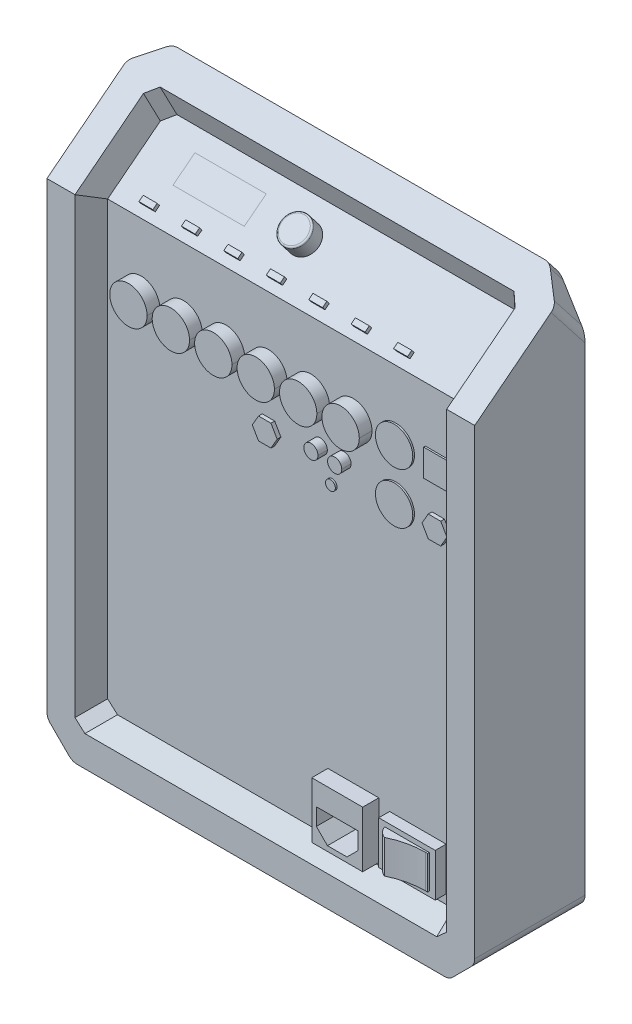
ISO-10303-21;
HEADER;
FILE_DESCRIPTION(('STEP AP214'),'2;1');
FILE_NAME('part.step','',(''),(''),'','','');
FILE_SCHEMA(('AUTOMOTIVE_DESIGN { 1 0 10303 214 1 1 1 1 }'));
ENDSEC;
DATA;
#1=APPLICATION_CONTEXT('core data for automotive mechanical design processes');
#2=APPLICATION_PROTOCOL_DEFINITION('international standard','automotive_design',2000,#1);
#3=PRODUCT_CONTEXT('',#1,'mechanical');
#4=PRODUCT('Part','Part','',(#3));
#5=PRODUCT_RELATED_PRODUCT_CATEGORY('part','',(#4));
#6=PRODUCT_DEFINITION_FORMATION('','',#4);
#7=PRODUCT_DEFINITION_CONTEXT('part definition',#1,'design');
#8=PRODUCT_DEFINITION('design','',#6,#7);
#9=PRODUCT_DEFINITION_SHAPE('','',#8);
#10=(LENGTH_UNIT() NAMED_UNIT(*) SI_UNIT(.MILLI.,.METRE.));
#11=(NAMED_UNIT(*) PLANE_ANGLE_UNIT() SI_UNIT($,.RADIAN.));
#12=(NAMED_UNIT(*) SI_UNIT($,.STERADIAN.) SOLID_ANGLE_UNIT());
#13=UNCERTAINTY_MEASURE_WITH_UNIT(LENGTH_MEASURE(1.E-05),#10,'distance_accuracy_value','');
#14=(GEOMETRIC_REPRESENTATION_CONTEXT(3) GLOBAL_UNCERTAINTY_ASSIGNED_CONTEXT((#13)) GLOBAL_UNIT_ASSIGNED_CONTEXT((#10,
#11,#12)) REPRESENTATION_CONTEXT('',''));
#15=CARTESIAN_POINT('',(0.,0.,0.));
#16=DIRECTION('',(0.,0.,1.));
#17=DIRECTION('',(1.,0.,0.));
#18=AXIS2_PLACEMENT_3D('',#15,#16,#17);
#19=CARTESIAN_POINT('',(89.7499937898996,-94.35,37.3784401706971));
#20=DIRECTION('',(0.,-1.,0.));
#21=DIRECTION('',(0.,0.,-1.));
#22=AXIS2_PLACEMENT_3D('',#19,#20,#21);
#23=CYLINDRICAL_SURFACE('',#22,44.5004680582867);
#24=CARTESIAN_POINT('',(89.7499937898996,-94.35,37.3784401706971));
#25=DIRECTION('',(0.,-1.,0.));
#26=DIRECTION('',(0.,0.,-1.));
#27=AXIS2_PLACEMENT_3D('',#24,#25,#26);
#28=CIRCLE('',#27,44.5004680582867);
#29=CARTESIAN_POINT('',(89.7499937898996,-94.35,-7.12202788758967));
#30=VERTEX_POINT('',#29);
#31=CARTESIAN_POINT('',(91.15,-94.35,-7.1));
#32=VERTEX_POINT('',#31);
#33=EDGE_CURVE('E1213',#30,#32,#28,.T.);
#34=ORIENTED_EDGE('',*,*,#33,.F.);
#35=DIRECTION('',(0.,-1.,0.));
#36=VECTOR('',#35,1.);
#37=CARTESIAN_POINT('',(89.7499937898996,-94.35,-7.12202788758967));
#38=LINE('',#37,#36);
#39=CARTESIAN_POINT('',(89.7499937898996,-114.05,-7.12202788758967));
#40=VERTEX_POINT('',#39);
#41=EDGE_CURVE('E1583',#30,#40,#38,.T.);
#42=ORIENTED_EDGE('',*,*,#41,.T.);
#43=CARTESIAN_POINT('',(89.7499937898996,-114.05,37.3784401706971));
#44=DIRECTION('',(0.,-1.,0.));
#45=DIRECTION('',(0.,0.,-1.));
#46=AXIS2_PLACEMENT_3D('',#43,#44,#45);
#47=CIRCLE('',#46,44.5004680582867);
#48=CARTESIAN_POINT('',(91.15,-114.05,-7.1));
#49=VERTEX_POINT('',#48);
#50=EDGE_CURVE('E942',#40,#49,#47,.T.);
#51=ORIENTED_EDGE('',*,*,#50,.T.);
#52=DIRECTION('',(0.,-1.,0.));
#53=VECTOR('',#52,1.);
#54=CARTESIAN_POINT('',(91.15,-94.35,-7.1));
#55=LINE('',#54,#53);
#56=EDGE_CURVE('E1556',#32,#49,#55,.T.);
#57=ORIENTED_EDGE('',*,*,#56,.F.);
#58=EDGE_LOOP('',(#34,#42,#51,#57));
#59=FACE_BOUND('',#58,.T.);
#60=ADVANCED_FACE('F16',(#59),#23,.F.);
#61=CARTESIAN_POINT('',(20.5,74.5,-9.));
#62=DIRECTION('',(0.,0.,-1.));
#63=DIRECTION('',(-1.,0.,0.));
#64=AXIS2_PLACEMENT_3D('',#61,#62,#63);
#65=CYLINDRICAL_SURFACE('',#64,4.175);
#66=CARTESIAN_POINT('',(20.5,74.5,-9.));
#67=DIRECTION('',(0.,0.,1.));
#68=DIRECTION('',(1.,0.,0.));
#69=AXIS2_PLACEMENT_3D('',#66,#67,#68);
#70=CIRCLE('',#69,4.175);
#71=CARTESIAN_POINT('',(24.675,74.5,-9.));
#72=VERTEX_POINT('',#71);
#73=CARTESIAN_POINT('',(16.325,74.5,-9.));
#74=VERTEX_POINT('',#73);
#75=EDGE_CURVE('E1854',#72,#74,#70,.T.);
#76=ORIENTED_EDGE('',*,*,#75,.F.);
#77=DIRECTION('',(0.,0.,-1.));
#78=VECTOR('',#77,1.);
#79=CARTESIAN_POINT('',(24.675,74.5,-9.));
#80=LINE('',#79,#78);
#81=CARTESIAN_POINT('',(24.675,74.5,-14.5));
#82=VERTEX_POINT('',#81);
#83=EDGE_CURVE('E1718',#72,#82,#80,.T.);
#84=ORIENTED_EDGE('',*,*,#83,.T.);
#85=CARTESIAN_POINT('',(20.5,74.5,-14.5));
#86=DIRECTION('',(0.,0.,1.));
#87=DIRECTION('',(0.,1.,0.));
#88=AXIS2_PLACEMENT_3D('',#85,#86,#87);
#89=CIRCLE('',#88,4.175);
#90=CARTESIAN_POINT('',(16.325,74.5,-14.5));
#91=VERTEX_POINT('',#90);
#92=EDGE_CURVE('E27',#82,#91,#89,.T.);
#93=ORIENTED_EDGE('',*,*,#92,.T.);
#94=DIRECTION('',(0.,0.,-1.));
#95=VECTOR('',#94,1.);
#96=CARTESIAN_POINT('',(16.325,74.5,-9.));
#97=LINE('',#96,#95);
#98=EDGE_CURVE('E1058',#74,#91,#97,.T.);
#99=ORIENTED_EDGE('',*,*,#98,.F.);
#100=EDGE_LOOP('',(#76,#84,#93,#99));
#101=FACE_BOUND('',#100,.T.);
#102=ADVANCED_FACE('F3733',(#101),#65,.T.);
#103=CARTESIAN_POINT('',(34.5,74.5,-9.));
#104=DIRECTION('',(0.,0.,-1.));
#105=DIRECTION('',(-1.,0.,0.));
#106=AXIS2_PLACEMENT_3D('',#103,#104,#105);
#107=CYLINDRICAL_SURFACE('',#106,4.175);
#108=CARTESIAN_POINT('',(34.5,74.5,-9.));
#109=DIRECTION('',(0.,0.,1.));
#110=DIRECTION('',(1.,0.,0.));
#111=AXIS2_PLACEMENT_3D('',#108,#109,#110);
#112=CIRCLE('',#111,4.175);
#113=CARTESIAN_POINT('',(38.675,74.5,-9.));
#114=VERTEX_POINT('',#113);
#115=CARTESIAN_POINT('',(30.325,74.5,-9.));
#116=VERTEX_POINT('',#115);
#117=EDGE_CURVE('E1750',#114,#116,#112,.T.);
#118=ORIENTED_EDGE('',*,*,#117,.F.);
#119=DIRECTION('',(0.,0.,-1.));
#120=VECTOR('',#119,1.);
#121=CARTESIAN_POINT('',(38.675,74.5,-9.));
#122=LINE('',#121,#120);
#123=CARTESIAN_POINT('',(38.675,74.5,-14.5));
#124=VERTEX_POINT('',#123);
#125=EDGE_CURVE('E1746',#114,#124,#122,.T.);
#126=ORIENTED_EDGE('',*,*,#125,.T.);
#127=CARTESIAN_POINT('',(34.5,74.5,-14.5));
#128=DIRECTION('',(0.,0.,1.));
#129=DIRECTION('',(0.,1.,0.));
#130=AXIS2_PLACEMENT_3D('',#127,#128,#129);
#131=CIRCLE('',#130,4.175);
#132=CARTESIAN_POINT('',(30.325,74.5,-14.5));
#133=VERTEX_POINT('',#132);
#134=EDGE_CURVE('E1898',#124,#133,#131,.T.);
#135=ORIENTED_EDGE('',*,*,#134,.T.);
#136=DIRECTION('',(0.,0.,-1.));
#137=VECTOR('',#136,1.);
#138=CARTESIAN_POINT('',(30.325,74.5,-9.));
#139=LINE('',#138,#137);
#140=EDGE_CURVE('E1436',#116,#133,#139,.T.);
#141=ORIENTED_EDGE('',*,*,#140,.F.);
#142=EDGE_LOOP('',(#118,#126,#135,#141));
#143=FACE_BOUND('',#142,.T.);
#144=ADVANCED_FACE('F3737',(#143),#107,.T.);
#145=CARTESIAN_POINT('',(27.5,58.5,-13.5));
#146=DIRECTION('',(0.,0.,-1.));
#147=DIRECTION('',(-1.,0.,0.));
#148=AXIS2_PLACEMENT_3D('',#145,#146,#147);
#149=CYLINDRICAL_SURFACE('',#148,2.9);
#150=CARTESIAN_POINT('',(27.5,58.5,-13.5));
#151=DIRECTION('',(0.,0.,1.));
#152=DIRECTION('',(1.,0.,0.));
#153=AXIS2_PLACEMENT_3D('',#150,#151,#152);
#154=CIRCLE('',#153,2.9);
#155=CARTESIAN_POINT('',(30.4,58.5,-13.5));
#156=VERTEX_POINT('',#155);
#157=CARTESIAN_POINT('',(24.6,58.5,-13.5));
#158=VERTEX_POINT('',#157);
#159=EDGE_CURVE('E1012',#156,#158,#154,.T.);
#160=ORIENTED_EDGE('',*,*,#159,.F.);
#161=DIRECTION('',(0.,0.,-1.));
#162=VECTOR('',#161,1.);
#163=CARTESIAN_POINT('',(30.4,58.5,-13.5));
#164=LINE('',#163,#162);
#165=CARTESIAN_POINT('',(30.4,58.5,-14.5));
#166=VERTEX_POINT('',#165);
#167=EDGE_CURVE('E1016',#156,#166,#164,.T.);
#168=ORIENTED_EDGE('',*,*,#167,.T.);
#169=CARTESIAN_POINT('',(27.5,58.5,-14.5));
#170=DIRECTION('',(0.,0.,1.));
#171=DIRECTION('',(0.,1.,0.));
#172=AXIS2_PLACEMENT_3D('',#169,#170,#171);
#173=CIRCLE('',#172,2.9);
#174=CARTESIAN_POINT('',(24.6,58.5,-14.5));
#175=VERTEX_POINT('',#174);
#176=EDGE_CURVE('E1955',#166,#175,#173,.T.);
#177=ORIENTED_EDGE('',*,*,#176,.T.);
#178=DIRECTION('',(0.,0.,-1.));
#179=VECTOR('',#178,1.);
#180=CARTESIAN_POINT('',(24.6,58.5,-13.5));
#181=LINE('',#180,#179);
#182=EDGE_CURVE('E1200',#158,#175,#181,.T.);
#183=ORIENTED_EDGE('',*,*,#182,.F.);
#184=EDGE_LOOP('',(#160,#168,#177,#183));
#185=FACE_BOUND('',#184,.T.);
#186=ADVANCED_FACE('F3267',(#185),#149,.T.);
#187=CARTESIAN_POINT('',(65.,97.5,-13.5));
#188=DIRECTION('',(0.,0.,-1.));
#189=DIRECTION('',(-1.,0.,0.));
#190=AXIS2_PLACEMENT_3D('',#187,#188,#189);
#191=CYLINDRICAL_SURFACE('',#190,11.);
#192=CARTESIAN_POINT('',(65.,97.5,-13.5));
#193=DIRECTION('',(0.,0.,1.));
#194=DIRECTION('',(1.,0.,0.));
#195=AXIS2_PLACEMENT_3D('',#192,#193,#194);
#196=CIRCLE('',#195,11.);
#197=CARTESIAN_POINT('',(76.,97.5,-13.5));
#198=VERTEX_POINT('',#197);
#199=CARTESIAN_POINT('',(54.,97.5,-13.5));
#200=VERTEX_POINT('',#199);
#201=EDGE_CURVE('E1323',#198,#200,#196,.T.);
#202=ORIENTED_EDGE('',*,*,#201,.F.);
#203=DIRECTION('',(0.,0.,-1.));
#204=VECTOR('',#203,1.);
#205=CARTESIAN_POINT('',(76.,97.5,-13.5));
#206=LINE('',#205,#204);
#207=CARTESIAN_POINT('',(76.,97.5,-14.5));
#208=VERTEX_POINT('',#207);
#209=EDGE_CURVE('E1442',#198,#208,#206,.T.);
#210=ORIENTED_EDGE('',*,*,#209,.T.);
#211=CARTESIAN_POINT('',(65.,97.5,-14.5));
#212=DIRECTION('',(0.,0.,1.));
#213=DIRECTION('',(0.,1.,0.));
#214=AXIS2_PLACEMENT_3D('',#211,#212,#213);
#215=CIRCLE('',#214,11.);
#216=CARTESIAN_POINT('',(54.,97.5,-14.5));
#217=VERTEX_POINT('',#216);
#218=EDGE_CURVE('E1039',#208,#217,#215,.T.);
#219=ORIENTED_EDGE('',*,*,#218,.T.);
#220=DIRECTION('',(0.,0.,-1.));
#221=VECTOR('',#220,1.);
#222=CARTESIAN_POINT('',(54.,97.5,-13.5));
#223=LINE('',#222,#221);
#224=EDGE_CURVE('E1437',#200,#217,#223,.T.);
#225=ORIENTED_EDGE('',*,*,#224,.F.);
#226=EDGE_LOOP('',(#202,#210,#219,#225));
#227=FACE_BOUND('',#226,.T.);
#228=ADVANCED_FACE('F3262',(#227),#191,.T.);
#229=CARTESIAN_POINT('',(65.,67.5,-13.5));
#230=DIRECTION('',(0.,0.,-1.));
#231=DIRECTION('',(-1.,0.,0.));
#232=AXIS2_PLACEMENT_3D('',#229,#230,#231);
#233=CYLINDRICAL_SURFACE('',#232,11.);
#234=CARTESIAN_POINT('',(65.,67.5,-13.5));
#235=DIRECTION('',(0.,0.,1.));
#236=DIRECTION('',(1.,0.,0.));
#237=AXIS2_PLACEMENT_3D('',#234,#235,#236);
#238=CIRCLE('',#237,11.);
#239=CARTESIAN_POINT('',(76.,67.5,-13.5));
#240=VERTEX_POINT('',#239);
#241=CARTESIAN_POINT('',(54.,67.5,-13.5));
#242=VERTEX_POINT('',#241);
#243=EDGE_CURVE('E1563',#240,#242,#238,.T.);
#244=ORIENTED_EDGE('',*,*,#243,.F.);
#245=DIRECTION('',(0.,0.,-1.));
#246=VECTOR('',#245,1.);
#247=CARTESIAN_POINT('',(76.,67.5,-13.5));
#248=LINE('',#247,#246);
#249=CARTESIAN_POINT('',(76.,67.5,-14.5));
#250=VERTEX_POINT('',#249);
#251=EDGE_CURVE('E1567',#240,#250,#248,.T.);
#252=ORIENTED_EDGE('',*,*,#251,.T.);
#253=CARTESIAN_POINT('',(65.,67.5,-14.5));
#254=DIRECTION('',(0.,0.,1.));
#255=DIRECTION('',(0.,1.,0.));
#256=AXIS2_PLACEMENT_3D('',#253,#254,#255);
#257=CIRCLE('',#256,11.);
#258=CARTESIAN_POINT('',(54.,67.5,-14.5));
#259=VERTEX_POINT('',#258);
#260=EDGE_CURVE('E1036',#250,#259,#257,.T.);
#261=ORIENTED_EDGE('',*,*,#260,.T.);
#262=DIRECTION('',(0.,0.,-1.));
#263=VECTOR('',#262,1.);
#264=CARTESIAN_POINT('',(54.,67.5,-13.5));
#265=LINE('',#264,#263);
#266=EDGE_CURVE('E2104',#242,#259,#265,.T.);
#267=ORIENTED_EDGE('',*,*,#266,.F.);
#268=EDGE_LOOP('',(#244,#252,#261,#267));
#269=FACE_BOUND('',#268,.T.);
#270=ADVANCED_FACE('F3266',(#269),#233,.T.);
#271=CARTESIAN_POINT('',(-85.,97.5,-7.));
#272=DIRECTION('',(0.,0.,-1.));
#273=DIRECTION('',(-1.,0.,0.));
#274=AXIS2_PLACEMENT_3D('',#271,#272,#273);
#275=CYLINDRICAL_SURFACE('',#274,11.);
#276=CARTESIAN_POINT('',(-85.,97.5,-7.));
#277=DIRECTION('',(0.,0.,1.));
#278=DIRECTION('',(1.,0.,0.));
#279=AXIS2_PLACEMENT_3D('',#276,#277,#278);
#280=CIRCLE('',#279,11.);
#281=CARTESIAN_POINT('',(-74.,97.5,-7.));
#282=VERTEX_POINT('',#281);
#283=CARTESIAN_POINT('',(-96.,97.5,-7.));
#284=VERTEX_POINT('',#283);
#285=EDGE_CURVE('E1704',#282,#284,#280,.T.);
#286=ORIENTED_EDGE('',*,*,#285,.F.);
#287=DIRECTION('',(0.,0.,-1.));
#288=VECTOR('',#287,1.);
#289=CARTESIAN_POINT('',(-74.,97.5,-7.));
#290=LINE('',#289,#288);
#291=CARTESIAN_POINT('',(-74.,97.5,-14.5));
#292=VERTEX_POINT('',#291);
#293=EDGE_CURVE('E1327',#282,#292,#290,.T.);
#294=ORIENTED_EDGE('',*,*,#293,.T.);
#295=CARTESIAN_POINT('',(-85.,97.5,-14.5));
#296=DIRECTION('',(0.,0.,1.));
#297=DIRECTION('',(0.,1.,0.));
#298=AXIS2_PLACEMENT_3D('',#295,#296,#297);
#299=CIRCLE('',#298,11.);
#300=CARTESIAN_POINT('',(-96.,97.5,-14.5));
#301=VERTEX_POINT('',#300);
#302=EDGE_CURVE('E1314',#292,#301,#299,.T.);
#303=ORIENTED_EDGE('',*,*,#302,.T.);
#304=DIRECTION('',(0.,0.,-1.));
#305=VECTOR('',#304,1.);
#306=CARTESIAN_POINT('',(-96.,97.5,-7.));
#307=LINE('',#306,#305);
#308=EDGE_CURVE('E955',#284,#301,#307,.T.);
#309=ORIENTED_EDGE('',*,*,#308,.F.);
#310=EDGE_LOOP('',(#286,#294,#303,#309));
#311=FACE_BOUND('',#310,.T.);
#312=ADVANCED_FACE('F3472',(#311),#275,.T.);
#313=CARTESIAN_POINT('',(40.,97.5,-7.));
#314=DIRECTION('',(0.,0.,-1.));
#315=DIRECTION('',(-1.,0.,0.));
#316=AXIS2_PLACEMENT_3D('',#313,#314,#315);
#317=CYLINDRICAL_SURFACE('',#316,11.);
#318=CARTESIAN_POINT('',(40.,97.5,-7.));
#319=DIRECTION('',(0.,0.,1.));
#320=DIRECTION('',(1.,0.,0.));
#321=AXIS2_PLACEMENT_3D('',#318,#319,#320);
#322=CIRCLE('',#321,11.);
#323=CARTESIAN_POINT('',(51.,97.5,-7.));
#324=VERTEX_POINT('',#323);
#325=CARTESIAN_POINT('',(29.,97.5,-7.));
#326=VERTEX_POINT('',#325);
#327=EDGE_CURVE('E1420',#324,#326,#322,.T.);
#328=ORIENTED_EDGE('',*,*,#327,.F.);
#329=DIRECTION('',(0.,0.,-1.));
#330=VECTOR('',#329,1.);
#331=CARTESIAN_POINT('',(51.,97.5,-7.));
#332=LINE('',#331,#330);
#333=CARTESIAN_POINT('',(51.,97.5,-14.5));
#334=VERTEX_POINT('',#333);
#335=EDGE_CURVE('E1253',#324,#334,#332,.T.);
#336=ORIENTED_EDGE('',*,*,#335,.T.);
#337=CARTESIAN_POINT('',(40.,97.5,-14.5));
#338=DIRECTION('',(0.,0.,1.));
#339=DIRECTION('',(0.,1.,0.));
#340=AXIS2_PLACEMENT_3D('',#337,#338,#339);
#341=CIRCLE('',#340,11.);
#342=CARTESIAN_POINT('',(29.,97.5,-14.5));
#343=VERTEX_POINT('',#342);
#344=EDGE_CURVE('E1317',#334,#343,#341,.T.);
#345=ORIENTED_EDGE('',*,*,#344,.T.);
#346=DIRECTION('',(0.,0.,-1.));
#347=VECTOR('',#346,1.);
#348=CARTESIAN_POINT('',(29.,97.5,-7.));
#349=LINE('',#348,#347);
#350=EDGE_CURVE('E1249',#326,#343,#349,.T.);
#351=ORIENTED_EDGE('',*,*,#350,.F.);
#352=EDGE_LOOP('',(#328,#336,#345,#351));
#353=FACE_BOUND('',#352,.T.);
#354=ADVANCED_FACE('F3467',(#353),#317,.T.);
#355=CARTESIAN_POINT('',(15.,97.5,-7.));
#356=DIRECTION('',(0.,0.,-1.));
#357=DIRECTION('',(-1.,0.,0.));
#358=AXIS2_PLACEMENT_3D('',#355,#356,#357);
#359=CYLINDRICAL_SURFACE('',#358,11.);
#360=CARTESIAN_POINT('',(15.,97.5,-7.));
#361=DIRECTION('',(0.,0.,1.));
#362=DIRECTION('',(1.,0.,0.));
#363=AXIS2_PLACEMENT_3D('',#360,#361,#362);
#364=CIRCLE('',#363,11.);
#365=CARTESIAN_POINT('',(26.,97.5,-7.));
#366=VERTEX_POINT('',#365);
#367=CARTESIAN_POINT('',(4.,97.5,-7.));
#368=VERTEX_POINT('',#367);
#369=EDGE_CURVE('E1106',#366,#368,#364,.T.);
#370=ORIENTED_EDGE('',*,*,#369,.F.);
#371=DIRECTION('',(0.,0.,-1.));
#372=VECTOR('',#371,1.);
#373=CARTESIAN_POINT('',(26.,97.5,-7.));
#374=LINE('',#373,#372);
#375=CARTESIAN_POINT('',(26.,97.5,-14.5));
#376=VERTEX_POINT('',#375);
#377=EDGE_CURVE('E1110',#366,#376,#374,.T.);
#378=ORIENTED_EDGE('',*,*,#377,.T.);
#379=CARTESIAN_POINT('',(15.,97.5,-14.5));
#380=DIRECTION('',(0.,0.,1.));
#381=DIRECTION('',(0.,1.,0.));
#382=AXIS2_PLACEMENT_3D('',#379,#380,#381);
#383=CIRCLE('',#382,11.);
#384=CARTESIAN_POINT('',(4.,97.5,-14.5));
#385=VERTEX_POINT('',#384);
#386=EDGE_CURVE('E1328',#376,#385,#383,.T.);
#387=ORIENTED_EDGE('',*,*,#386,.T.);
#388=DIRECTION('',(0.,0.,-1.));
#389=VECTOR('',#388,1.);
#390=CARTESIAN_POINT('',(4.,97.5,-7.));
#391=LINE('',#390,#389);
#392=EDGE_CURVE('E1404',#368,#385,#391,.T.);
#393=ORIENTED_EDGE('',*,*,#392,.F.);
#394=EDGE_LOOP('',(#370,#378,#387,#393));
#395=FACE_BOUND('',#394,.T.);
#396=ADVANCED_FACE('F3471',(#395),#359,.T.);
#397=CARTESIAN_POINT('',(-10.,97.5,-7.));
#398=DIRECTION('',(0.,0.,-1.));
#399=DIRECTION('',(-1.,0.,0.));
#400=AXIS2_PLACEMENT_3D('',#397,#398,#399);
#401=CYLINDRICAL_SURFACE('',#400,11.);
#402=CARTESIAN_POINT('',(-10.,97.5,-7.));
#403=DIRECTION('',(0.,0.,1.));
#404=DIRECTION('',(1.,0.,0.));
#405=AXIS2_PLACEMENT_3D('',#402,#403,#404);
#406=CIRCLE('',#405,11.);
#407=CARTESIAN_POINT('',(1.,97.5,-7.));
#408=VERTEX_POINT('',#407);
#409=CARTESIAN_POINT('',(-21.,97.5,-7.));
#410=VERTEX_POINT('',#409);
#411=EDGE_CURVE('E1292',#408,#410,#406,.T.);
#412=ORIENTED_EDGE('',*,*,#411,.F.);
#413=DIRECTION('',(0.,0.,-1.));
#414=VECTOR('',#413,1.);
#415=CARTESIAN_POINT('',(1.,97.5,-7.));
#416=LINE('',#415,#414);
#417=CARTESIAN_POINT('',(1.,97.5,-14.5));
#418=VERTEX_POINT('',#417);
#419=EDGE_CURVE('E1296',#408,#418,#416,.T.);
#420=ORIENTED_EDGE('',*,*,#419,.T.);
#421=CARTESIAN_POINT('',(-10.,97.5,-14.5));
#422=DIRECTION('',(0.,0.,1.));
#423=DIRECTION('',(0.,1.,0.));
#424=AXIS2_PLACEMENT_3D('',#421,#422,#423);
#425=CIRCLE('',#424,11.);
#426=CARTESIAN_POINT('',(-21.,97.5,-14.5));
#427=VERTEX_POINT('',#426);
#428=EDGE_CURVE('E1331',#418,#427,#425,.T.);
#429=ORIENTED_EDGE('',*,*,#428,.T.);
#430=DIRECTION('',(0.,0.,-1.));
#431=VECTOR('',#430,1.);
#432=CARTESIAN_POINT('',(-21.,97.5,-7.));
#433=LINE('',#432,#431);
#434=EDGE_CURVE('E1308',#410,#427,#433,.T.);
#435=ORIENTED_EDGE('',*,*,#434,.F.);
#436=EDGE_LOOP('',(#412,#420,#429,#435));
#437=FACE_BOUND('',#436,.T.);
#438=ADVANCED_FACE('F3442',(#437),#401,.T.);
#439=CARTESIAN_POINT('',(-35.,97.5,-7.));
#440=DIRECTION('',(0.,0.,-1.));
#441=DIRECTION('',(-1.,0.,0.));
#442=AXIS2_PLACEMENT_3D('',#439,#440,#441);
#443=CYLINDRICAL_SURFACE('',#442,11.);
#444=CARTESIAN_POINT('',(-35.,97.5,-7.));
#445=DIRECTION('',(0.,0.,1.));
#446=DIRECTION('',(1.,0.,0.));
#447=AXIS2_PLACEMENT_3D('',#444,#445,#446);
#448=CIRCLE('',#447,11.);
#449=CARTESIAN_POINT('',(-24.,97.5,-7.));
#450=VERTEX_POINT('',#449);
#451=CARTESIAN_POINT('',(-46.,97.5,-7.));
#452=VERTEX_POINT('',#451);
#453=EDGE_CURVE('E1986',#450,#452,#448,.T.);
#454=ORIENTED_EDGE('',*,*,#453,.F.);
#455=DIRECTION('',(0.,0.,-1.));
#456=VECTOR('',#455,1.);
#457=CARTESIAN_POINT('',(-24.,97.5,-7.));
#458=LINE('',#457,#456);
#459=CARTESIAN_POINT('',(-24.,97.5,-14.5));
#460=VERTEX_POINT('',#459);
#461=EDGE_CURVE('E1758',#450,#460,#458,.T.);
#462=ORIENTED_EDGE('',*,*,#461,.T.);
#463=CARTESIAN_POINT('',(-35.,97.5,-14.5));
#464=DIRECTION('',(0.,0.,1.));
#465=DIRECTION('',(0.,1.,0.));
#466=AXIS2_PLACEMENT_3D('',#463,#464,#465);
#467=CIRCLE('',#466,11.);
#468=CARTESIAN_POINT('',(-46.,97.5,-14.5));
#469=VERTEX_POINT('',#468);
#470=EDGE_CURVE('E1660',#460,#469,#467,.T.);
#471=ORIENTED_EDGE('',*,*,#470,.T.);
#472=DIRECTION('',(0.,0.,-1.));
#473=VECTOR('',#472,1.);
#474=CARTESIAN_POINT('',(-46.,97.5,-7.));
#475=LINE('',#474,#473);
#476=EDGE_CURVE('E1046',#452,#469,#475,.T.);
#477=ORIENTED_EDGE('',*,*,#476,.F.);
#478=EDGE_LOOP('',(#454,#462,#471,#477));
#479=FACE_BOUND('',#478,.T.);
#480=ADVANCED_FACE('F3321',(#479),#443,.T.);
#481=CARTESIAN_POINT('',(-60.,97.5,-7.));
#482=DIRECTION('',(0.,0.,-1.));
#483=DIRECTION('',(-1.,0.,0.));
#484=AXIS2_PLACEMENT_3D('',#481,#482,#483);
#485=CYLINDRICAL_SURFACE('',#484,11.);
#486=CARTESIAN_POINT('',(-60.,97.5,-7.));
#487=DIRECTION('',(0.,0.,1.));
#488=DIRECTION('',(1.,0.,0.));
#489=AXIS2_PLACEMENT_3D('',#486,#487,#488);
#490=CIRCLE('',#489,11.);
#491=CARTESIAN_POINT('',(-49.,97.5,-7.));
#492=VERTEX_POINT('',#491);
#493=CARTESIAN_POINT('',(-71.,97.5,-7.));
#494=VERTEX_POINT('',#493);
#495=EDGE_CURVE('E1419',#492,#494,#490,.T.);
#496=ORIENTED_EDGE('',*,*,#495,.F.);
#497=DIRECTION('',(0.,0.,-1.));
#498=VECTOR('',#497,1.);
#499=CARTESIAN_POINT('',(-49.,97.5,-7.));
#500=LINE('',#499,#498);
#501=CARTESIAN_POINT('',(-49.,97.5,-14.5));
#502=VERTEX_POINT('',#501);
#503=EDGE_CURVE('E1414',#492,#502,#500,.T.);
#504=ORIENTED_EDGE('',*,*,#503,.T.);
#505=CARTESIAN_POINT('',(-60.,97.5,-14.5));
#506=DIRECTION('',(0.,0.,1.));
#507=DIRECTION('',(0.,1.,0.));
#508=AXIS2_PLACEMENT_3D('',#505,#506,#507);
#509=CIRCLE('',#508,11.);
#510=CARTESIAN_POINT('',(-71.,97.5,-14.5));
#511=VERTEX_POINT('',#510);
#512=EDGE_CURVE('E1040',#502,#511,#509,.T.);
#513=ORIENTED_EDGE('',*,*,#512,.T.);
#514=DIRECTION('',(0.,0.,-1.));
#515=VECTOR('',#514,1.);
#516=CARTESIAN_POINT('',(-71.,97.5,-7.));
#517=LINE('',#516,#515);
#518=EDGE_CURVE('E1418',#494,#511,#517,.T.);
#519=ORIENTED_EDGE('',*,*,#518,.F.);
#520=EDGE_LOOP('',(#496,#504,#513,#519));
#521=FACE_BOUND('',#520,.T.);
#522=ADVANCED_FACE('F3316',(#521),#485,.T.);
#523=CARTESIAN_POINT('',(-10.,161.440828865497,-30.301636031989));
#524=DIRECTION('',(0.,0.788010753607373,0.615661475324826));
#525=DIRECTION('',(0.,-0.615661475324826,0.788010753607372));
#526=AXIS2_PLACEMENT_3D('',#523,#524,#525);
#527=TOROIDAL_SURFACE('',#526,7.420000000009,1.);
#528=CARTESIAN_POINT('',(-10.,161.440828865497,-30.301636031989));
#529=DIRECTION('',(0.,-0.788010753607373,-0.615661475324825));
#530=DIRECTION('',(0.,-0.615661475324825,0.788010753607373));
#531=AXIS2_PLACEMENT_3D('',#528,#529,#530);
#532=CIRCLE('',#531,8.420000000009);
#533=CARTESIAN_POINT('',(-10.,166.624698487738,-36.9366865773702));
#534=VERTEX_POINT('',#533);
#535=CARTESIAN_POINT('',(-10.,156.256959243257,-23.6665854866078));
#536=VERTEX_POINT('',#535);
#537=EDGE_CURVE('E10',#534,#536,#532,.T.);
#538=ORIENTED_EDGE('',*,*,#537,.F.);
#539=CARTESIAN_POINT('',(-10.,166.009037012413,-36.1486758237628));
#540=DIRECTION('',(1.,0.,0.));
#541=DIRECTION('',(0.,0.,-1.));
#542=AXIS2_PLACEMENT_3D('',#539,#540,#541);
#543=CIRCLE('',#542,1.);
#544=CARTESIAN_POINT('',(-10.,166.797047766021,-35.5330143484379));
#545=VERTEX_POINT('',#544);
#546=EDGE_CURVE('E1075',#534,#545,#543,.T.);
#547=ORIENTED_EDGE('',*,*,#546,.T.);
#548=CARTESIAN_POINT('',(-10.,162.228839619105,-29.6859745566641));
#549=DIRECTION('',(0.,0.788010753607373,0.615661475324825));
#550=DIRECTION('',(0.,-0.615661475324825,0.788010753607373));
#551=AXIS2_PLACEMENT_3D('',#548,#549,#550);
#552=CIRCLE('',#551,7.42000000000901);
#553=CARTESIAN_POINT('',(-10.,157.660631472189,-23.8389347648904));
#554=VERTEX_POINT('',#553);
#555=EDGE_CURVE('E1186',#554,#545,#552,.T.);
#556=ORIENTED_EDGE('',*,*,#555,.F.);
#557=CARTESIAN_POINT('',(-10.,156.872620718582,-24.4545962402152));
#558=DIRECTION('',(-1.,0.,0.));
#559=DIRECTION('',(0.,0.,1.));
#560=AXIS2_PLACEMENT_3D('',#557,#558,#559);
#561=CIRCLE('',#560,1.);
#562=EDGE_CURVE('E1160',#536,#554,#561,.T.);
#563=ORIENTED_EDGE('',*,*,#562,.F.);
#564=EDGE_LOOP('',(#538,#547,#556,#563));
#565=FACE_BOUND('',#564,.T.);
#566=ADVANCED_FACE('F3320',(#565),#527,.T.);
#567=CARTESIAN_POINT('',(-10.,162.228839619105,-29.6859745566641));
#568=DIRECTION('',(0.,-0.788010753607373,-0.615661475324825));
#569=DIRECTION('',(0.,0.615661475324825,-0.788010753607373));
#570=AXIS2_PLACEMENT_3D('',#567,#568,#569);
#571=CYLINDRICAL_SURFACE('',#570,8.420000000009);
#572=ORIENTED_EDGE('',*,*,#537,.T.);
#573=DIRECTION('',(0.,-0.788010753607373,-0.615661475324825));
#574=VECTOR('',#573,1.);
#575=CARTESIAN_POINT('',(-10.,157.044969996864,-23.050924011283));
#576=LINE('',#575,#574);
#577=CARTESIAN_POINT('',(-10.,149.322464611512,-29.0844064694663));
#578=VERTEX_POINT('',#577);
#579=EDGE_CURVE('E1189',#536,#578,#576,.T.);
#580=ORIENTED_EDGE('',*,*,#579,.T.);
#581=CARTESIAN_POINT('',(-10.,154.506334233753,-35.7194570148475));
#582=DIRECTION('',(0.,0.788010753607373,0.615661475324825));
#583=DIRECTION('',(0.,0.615661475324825,-0.788010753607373));
#584=AXIS2_PLACEMENT_3D('',#581,#582,#583);
#585=CIRCLE('',#584,8.420000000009);
#586=CARTESIAN_POINT('',(-10.,159.690203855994,-42.3545075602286));
#587=VERTEX_POINT('',#586);
#588=EDGE_CURVE('E1318',#578,#587,#585,.T.);
#589=ORIENTED_EDGE('',*,*,#588,.T.);
#590=DIRECTION('',(0.,-0.788010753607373,-0.615661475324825));
#591=VECTOR('',#590,1.);
#592=CARTESIAN_POINT('',(-10.,167.412709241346,-36.3210251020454));
#593=LINE('',#592,#591);
#594=EDGE_CURVE('E1711',#534,#587,#593,.T.);
#595=ORIENTED_EDGE('',*,*,#594,.F.);
#596=EDGE_LOOP('',(#572,#580,#589,#595));
#597=FACE_BOUND('',#596,.T.);
#598=ADVANCED_FACE('F3506',(#597),#571,.T.);
#599=CARTESIAN_POINT('',(-104.75,-122.288664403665,-14.5));
#600=DIRECTION('',(0.,0.,-1.));
#601=DIRECTION('',(-1.,0.,0.));
#602=AXIS2_PLACEMENT_3D('',#599,#600,#601);
#603=PLANE('',#602);
#604=DIRECTION('',(-1.,0.,0.));
#605=VECTOR('',#604,1.);
#606=CARTESIAN_POINT('',(61.35,-91.5,-14.5));
#607=LINE('',#606,#605);
#608=CARTESIAN_POINT('',(94.65,-91.5,-14.5));
#609=VERTEX_POINT('',#608);
#610=CARTESIAN_POINT('',(61.35,-91.5,-14.5));
#611=VERTEX_POINT('',#610);
#612=EDGE_CURVE('E976',#609,#611,#607,.T.);
#613=ORIENTED_EDGE('',*,*,#612,.F.);
#614=DIRECTION('',(0.,1.,0.));
#615=VECTOR('',#614,1.);
#616=CARTESIAN_POINT('',(94.65,-91.5,-14.5));
#617=LINE('',#616,#615);
#618=CARTESIAN_POINT('',(94.65,-116.9,-14.5));
#619=VERTEX_POINT('',#618);
#620=EDGE_CURVE('E988',#619,#609,#617,.T.);
#621=ORIENTED_EDGE('',*,*,#620,.F.);
#622=DIRECTION('',(1.,0.,0.));
#623=VECTOR('',#622,1.);
#624=CARTESIAN_POINT('',(94.65,-116.9,-14.5));
#625=LINE('',#624,#623);
#626=CARTESIAN_POINT('',(61.35,-116.9,-14.5));
#627=VERTEX_POINT('',#626);
#628=EDGE_CURVE('E1447',#627,#619,#625,.T.);
#629=ORIENTED_EDGE('',*,*,#628,.F.);
#630=DIRECTION('',(0.,-1.,0.));
#631=VECTOR('',#630,1.);
#632=CARTESIAN_POINT('',(61.35,-116.9,-14.5));
#633=LINE('',#632,#631);
#634=EDGE_CURVE('E977',#611,#627,#633,.T.);
#635=ORIENTED_EDGE('',*,*,#634,.F.);
#636=EDGE_LOOP('',(#613,#621,#629,#635));
#637=FACE_BOUND('',#636,.T.);
#638=DIRECTION('',(0.5,0.866025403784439,0.));
#639=VECTOR('',#638,1.);
#640=CARTESIAN_POINT('',(-6.33382579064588,61.15,-14.5));
#641=LINE('',#640,#639);
#642=CARTESIAN_POINT('',(-6.33382579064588,61.15,-14.5));
#643=VERTEX_POINT('',#642);
#644=CARTESIAN_POINT('',(-2.66765158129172,67.5,-14.5));
#645=VERTEX_POINT('',#644);
#646=EDGE_CURVE('E1142',#643,#645,#641,.T.);
#647=ORIENTED_EDGE('',*,*,#646,.F.);
#648=DIRECTION('',(1.,0.,0.));
#649=VECTOR('',#648,1.);
#650=CARTESIAN_POINT('',(-13.6661742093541,61.15,-14.5));
#651=LINE('',#650,#649);
#652=CARTESIAN_POINT('',(-13.6661742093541,61.15,-14.5));
#653=VERTEX_POINT('',#652);
#654=EDGE_CURVE('E1534',#653,#643,#651,.T.);
#655=ORIENTED_EDGE('',*,*,#654,.F.);
#656=DIRECTION('',(0.5,-0.866025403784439,0.));
#657=VECTOR('',#656,1.);
#658=CARTESIAN_POINT('',(-17.3323484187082,67.5,-14.5));
#659=LINE('',#658,#657);
#660=CARTESIAN_POINT('',(-17.3323484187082,67.5,-14.5));
#661=VERTEX_POINT('',#660);
#662=EDGE_CURVE('E1185',#661,#653,#659,.T.);
#663=ORIENTED_EDGE('',*,*,#662,.F.);
#664=DIRECTION('',(-0.5,-0.866025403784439,0.));
#665=VECTOR('',#664,1.);
#666=CARTESIAN_POINT('',(-13.6661742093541,73.85,-14.5));
#667=LINE('',#666,#665);
#668=CARTESIAN_POINT('',(-13.6661742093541,73.85,-14.5));
#669=VERTEX_POINT('',#668);
#670=EDGE_CURVE('E1184',#669,#661,#667,.T.);
#671=ORIENTED_EDGE('',*,*,#670,.F.);
#672=DIRECTION('',(-1.,0.,0.));
#673=VECTOR('',#672,1.);
#674=CARTESIAN_POINT('',(-6.33382579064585,73.85,-14.5));
#675=LINE('',#674,#673);
#676=CARTESIAN_POINT('',(-6.33382579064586,73.85,-14.5));
#677=VERTEX_POINT('',#676);
#678=EDGE_CURVE('E1309',#677,#669,#675,.T.);
#679=ORIENTED_EDGE('',*,*,#678,.F.);
#680=DIRECTION('',(-0.5,0.866025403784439,0.));
#681=VECTOR('',#680,1.);
#682=CARTESIAN_POINT('',(-2.66765158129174,67.5,-14.5));
#683=LINE('',#682,#681);
#684=EDGE_CURVE('E1143',#645,#677,#683,.T.);
#685=ORIENTED_EDGE('',*,*,#684,.F.);
#686=EDGE_LOOP('',(#647,#655,#663,#671,#679,#685));
#687=FACE_BOUND('',#686,.T.);
#688=CARTESIAN_POINT('',(20.5,74.5,-14.5));
#689=DIRECTION('',(0.,0.,1.));
#690=DIRECTION('',(0.,1.,0.));
#691=AXIS2_PLACEMENT_3D('',#688,#689,#690);
#692=CIRCLE('',#691,4.175);
#693=EDGE_CURVE('E1053',#91,#82,#692,.T.);
#694=ORIENTED_EDGE('',*,*,#693,.F.);
#695=ORIENTED_EDGE('',*,*,#92,.F.);
#696=EDGE_LOOP('',(#694,#695));
#697=FACE_BOUND('',#696,.T.);
#698=CARTESIAN_POINT('',(34.5,74.5,-14.5));
#699=DIRECTION('',(0.,0.,1.));
#700=DIRECTION('',(0.,1.,0.));
#701=AXIS2_PLACEMENT_3D('',#698,#699,#700);
#702=CIRCLE('',#701,4.175);
#703=EDGE_CURVE('E1115',#133,#124,#702,.T.);
#704=ORIENTED_EDGE('',*,*,#703,.F.);
#705=ORIENTED_EDGE('',*,*,#134,.F.);
#706=EDGE_LOOP('',(#704,#705));
#707=FACE_BOUND('',#706,.T.);
#708=CARTESIAN_POINT('',(27.5,58.5,-14.5));
#709=DIRECTION('',(0.,0.,1.));
#710=DIRECTION('',(0.,1.,0.));
#711=AXIS2_PLACEMENT_3D('',#708,#709,#710);
#712=CIRCLE('',#711,2.9);
#713=EDGE_CURVE('E1204',#175,#166,#712,.T.);
#714=ORIENTED_EDGE('',*,*,#713,.F.);
#715=ORIENTED_EDGE('',*,*,#176,.F.);
#716=EDGE_LOOP('',(#714,#715));
#717=FACE_BOUND('',#716,.T.);
#718=CARTESIAN_POINT('',(65.,97.5,-14.5));
#719=DIRECTION('',(0.,0.,1.));
#720=DIRECTION('',(0.,1.,0.));
#721=AXIS2_PLACEMENT_3D('',#718,#719,#720);
#722=CIRCLE('',#721,11.);
#723=EDGE_CURVE('E1441',#217,#208,#722,.T.);
#724=ORIENTED_EDGE('',*,*,#723,.F.);
#725=ORIENTED_EDGE('',*,*,#218,.F.);
#726=EDGE_LOOP('',(#724,#725));
#727=FACE_BOUND('',#726,.T.);
#728=CARTESIAN_POINT('',(65.,67.5,-14.5));
#729=DIRECTION('',(0.,0.,1.));
#730=DIRECTION('',(0.,1.,0.));
#731=AXIS2_PLACEMENT_3D('',#728,#729,#730);
#732=CIRCLE('',#731,11.);
#733=EDGE_CURVE('E1829',#259,#250,#732,.T.);
#734=ORIENTED_EDGE('',*,*,#733,.F.);
#735=ORIENTED_EDGE('',*,*,#260,.F.);
#736=EDGE_LOOP('',(#734,#735));
#737=FACE_BOUND('',#736,.T.);
#738=CARTESIAN_POINT('',(-60.,97.5,-14.5));
#739=DIRECTION('',(0.,0.,1.));
#740=DIRECTION('',(0.,1.,0.));
#741=AXIS2_PLACEMENT_3D('',#738,#739,#740);
#742=CIRCLE('',#741,11.);
#743=EDGE_CURVE('E1080',#511,#502,#742,.T.);
#744=ORIENTED_EDGE('',*,*,#743,.F.);
#745=ORIENTED_EDGE('',*,*,#512,.F.);
#746=EDGE_LOOP('',(#744,#745));
#747=FACE_BOUND('',#746,.T.);
#748=CARTESIAN_POINT('',(-35.,97.5,-14.5));
#749=DIRECTION('',(0.,0.,1.));
#750=DIRECTION('',(0.,1.,0.));
#751=AXIS2_PLACEMENT_3D('',#748,#749,#750);
#752=CIRCLE('',#751,11.);
#753=EDGE_CURVE('E1041',#469,#460,#752,.T.);
#754=ORIENTED_EDGE('',*,*,#753,.F.);
#755=ORIENTED_EDGE('',*,*,#470,.F.);
#756=EDGE_LOOP('',(#754,#755));
#757=FACE_BOUND('',#756,.T.);
#758=CARTESIAN_POINT('',(-10.,97.5,-14.5));
#759=DIRECTION('',(0.,0.,1.));
#760=DIRECTION('',(0.,1.,0.));
#761=AXIS2_PLACEMENT_3D('',#758,#759,#760);
#762=CIRCLE('',#761,11.);
#763=EDGE_CURVE('E1303',#427,#418,#762,.T.);
#764=ORIENTED_EDGE('',*,*,#763,.F.);
#765=ORIENTED_EDGE('',*,*,#428,.F.);
#766=EDGE_LOOP('',(#764,#765));
#767=FACE_BOUND('',#766,.T.);
#768=CARTESIAN_POINT('',(15.,97.5,-14.5));
#769=DIRECTION('',(0.,0.,1.));
#770=DIRECTION('',(0.,1.,0.));
#771=AXIS2_PLACEMENT_3D('',#768,#769,#770);
#772=CIRCLE('',#771,11.);
#773=EDGE_CURVE('E1501',#385,#376,#772,.T.);
#774=ORIENTED_EDGE('',*,*,#773,.F.);
#775=ORIENTED_EDGE('',*,*,#386,.F.);
#776=EDGE_LOOP('',(#774,#775));
#777=FACE_BOUND('',#776,.T.);
#778=CARTESIAN_POINT('',(40.,97.5,-14.5));
#779=DIRECTION('',(0.,0.,1.));
#780=DIRECTION('',(0.,1.,0.));
#781=AXIS2_PLACEMENT_3D('',#778,#779,#780);
#782=CIRCLE('',#781,11.);
#783=EDGE_CURVE('E1193',#343,#334,#782,.T.);
#784=ORIENTED_EDGE('',*,*,#783,.F.);
#785=ORIENTED_EDGE('',*,*,#344,.F.);
#786=EDGE_LOOP('',(#784,#785));
#787=FACE_BOUND('',#786,.T.);
#788=CARTESIAN_POINT('',(-85.,97.5,-14.5));
#789=DIRECTION('',(0.,0.,1.));
#790=DIRECTION('',(0.,1.,0.));
#791=AXIS2_PLACEMENT_3D('',#788,#789,#790);
#792=CIRCLE('',#791,11.);
#793=EDGE_CURVE('E950',#301,#292,#792,.T.);
#794=ORIENTED_EDGE('',*,*,#793,.F.);
#795=ORIENTED_EDGE('',*,*,#302,.F.);
#796=EDGE_LOOP('',(#794,#795));
#797=FACE_BOUND('',#796,.T.);
#798=DIRECTION('',(1.,0.,0.));
#799=VECTOR('',#798,1.);
#800=CARTESIAN_POINT('',(82.4,89.55,-14.5));
#801=LINE('',#800,#799);
#802=CARTESIAN_POINT('',(82.4,89.55,-14.5));
#803=VERTEX_POINT('',#802);
#804=CARTESIAN_POINT('',(97.6,89.55,-14.5));
#805=VERTEX_POINT('',#804);
#806=EDGE_CURVE('E1221',#803,#805,#801,.T.);
#807=ORIENTED_EDGE('',*,*,#806,.F.);
#808=DIRECTION('',(0.,-1.,0.));
#809=VECTOR('',#808,1.);
#810=CARTESIAN_POINT('',(82.4,105.45,-14.5));
#811=LINE('',#810,#809);
#812=CARTESIAN_POINT('',(82.4,105.45,-14.5));
#813=VERTEX_POINT('',#812);
#814=EDGE_CURVE('E1121',#813,#803,#811,.T.);
#815=ORIENTED_EDGE('',*,*,#814,.F.);
#816=DIRECTION('',(-1.,0.,0.));
#817=VECTOR('',#816,1.);
#818=CARTESIAN_POINT('',(82.4,105.45,-14.5));
#819=LINE('',#818,#817);
#820=CARTESIAN_POINT('',(97.6,105.45,-14.5));
#821=VERTEX_POINT('',#820);
#822=EDGE_CURVE('E1910',#821,#813,#819,.T.);
#823=ORIENTED_EDGE('',*,*,#822,.F.);
#824=DIRECTION('',(0.,1.,0.));
#825=VECTOR('',#824,1.);
#826=CARTESIAN_POINT('',(97.6,89.55,-14.5));
#827=LINE('',#826,#825);
#828=EDGE_CURVE('E1539',#805,#821,#827,.T.);
#829=ORIENTED_EDGE('',*,*,#828,.F.);
#830=EDGE_LOOP('',(#807,#815,#823,#829));
#831=FACE_BOUND('',#830,.T.);
#832=DIRECTION('',(0.5,0.866025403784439,0.));
#833=VECTOR('',#832,1.);
#834=CARTESIAN_POINT('',(93.6661742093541,61.15,-14.5));
#835=LINE('',#834,#833);
#836=CARTESIAN_POINT('',(93.6661742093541,61.15,-14.5));
#837=VERTEX_POINT('',#836);
#838=CARTESIAN_POINT('',(97.3323484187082,67.5,-14.5));
#839=VERTEX_POINT('',#838);
#840=EDGE_CURVE('E1035',#837,#839,#835,.T.);
#841=ORIENTED_EDGE('',*,*,#840,.F.);
#842=DIRECTION('',(1.,0.,0.));
#843=VECTOR('',#842,1.);
#844=CARTESIAN_POINT('',(86.3338257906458,61.15,-14.5));
#845=LINE('',#844,#843);
#846=CARTESIAN_POINT('',(86.3338257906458,61.15,-14.5));
#847=VERTEX_POINT('',#846);
#848=EDGE_CURVE('E1776',#847,#837,#845,.T.);
#849=ORIENTED_EDGE('',*,*,#848,.F.);
#850=DIRECTION('',(0.5,-0.866025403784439,0.));
#851=VECTOR('',#850,1.);
#852=CARTESIAN_POINT('',(82.6676515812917,67.5,-14.5));
#853=LINE('',#852,#851);
#854=CARTESIAN_POINT('',(82.6676515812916,67.5,-14.5));
#855=VERTEX_POINT('',#854);
#856=EDGE_CURVE('E1298',#855,#847,#853,.T.);
#857=ORIENTED_EDGE('',*,*,#856,.F.);
#858=DIRECTION('',(-0.5,-0.866025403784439,0.));
#859=VECTOR('',#858,1.);
#860=CARTESIAN_POINT('',(86.3338257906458,73.85,-14.5));
#861=LINE('',#860,#859);
#862=CARTESIAN_POINT('',(86.3338257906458,73.85,-14.5));
#863=VERTEX_POINT('',#862);
#864=EDGE_CURVE('E1259',#863,#855,#861,.T.);
#865=ORIENTED_EDGE('',*,*,#864,.F.);
#866=DIRECTION('',(-1.,0.,0.));
#867=VECTOR('',#866,1.);
#868=CARTESIAN_POINT('',(93.6661742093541,73.85,-14.5));
#869=LINE('',#868,#867);
#870=CARTESIAN_POINT('',(93.6661742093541,73.85,-14.5));
#871=VERTEX_POINT('',#870);
#872=EDGE_CURVE('E1258',#871,#863,#869,.T.);
#873=ORIENTED_EDGE('',*,*,#872,.F.);
#874=DIRECTION('',(-0.5,0.866025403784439,0.));
#875=VECTOR('',#874,1.);
#876=CARTESIAN_POINT('',(97.3323484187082,67.5,-14.5));
#877=LINE('',#876,#875);
#878=EDGE_CURVE('E1990',#839,#871,#877,.T.);
#879=ORIENTED_EDGE('',*,*,#878,.F.);
#880=EDGE_LOOP('',(#841,#849,#857,#865,#873,#879));
#881=FACE_BOUND('',#880,.T.);
#882=DIRECTION('',(-1.,0.,0.));
#883=VECTOR('',#882,1.);
#884=CARTESIAN_POINT('',(25.0000000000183,-87.7,-14.5));
#885=LINE('',#884,#883);
#886=CARTESIAN_POINT('',(55.0000000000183,-87.7,-14.5));
#887=VERTEX_POINT('',#886);
#888=CARTESIAN_POINT('',(25.0000000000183,-87.7,-14.5));
#889=VERTEX_POINT('',#888);
#890=EDGE_CURVE('E1179',#887,#889,#885,.T.);
#891=ORIENTED_EDGE('',*,*,#890,.F.);
#892=DIRECTION('',(0.,1.,0.));
#893=VECTOR('',#892,1.);
#894=CARTESIAN_POINT('',(55.0000000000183,-87.7,-14.5));
#895=LINE('',#894,#893);
#896=CARTESIAN_POINT('',(55.0000000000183,-120.7,-14.5));
#897=VERTEX_POINT('',#896);
#898=EDGE_CURVE('E1352',#897,#887,#895,.T.);
#899=ORIENTED_EDGE('',*,*,#898,.F.);
#900=DIRECTION('',(1.,0.,0.));
#901=VECTOR('',#900,1.);
#902=CARTESIAN_POINT('',(25.0000000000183,-120.7,-14.5));
#903=LINE('',#902,#901);
#904=CARTESIAN_POINT('',(25.0000000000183,-120.7,-14.5));
#905=VERTEX_POINT('',#904);
#906=EDGE_CURVE('E1771',#905,#897,#903,.T.);
#907=ORIENTED_EDGE('',*,*,#906,.F.);
#908=DIRECTION('',(0.,-1.,0.));
#909=VECTOR('',#908,1.);
#910=CARTESIAN_POINT('',(25.0000000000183,-87.7,-14.5));
#911=LINE('',#910,#909);
#912=EDGE_CURVE('E1291',#889,#905,#911,.T.);
#913=ORIENTED_EDGE('',*,*,#912,.F.);
#914=EDGE_LOOP('',(#891,#899,#907,#913));
#915=FACE_BOUND('',#914,.T.);
#916=DIRECTION('',(1.,0.,0.));
#917=VECTOR('',#916,1.);
#918=CARTESIAN_POINT('',(-104.75,-122.288664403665,-14.5));
#919=LINE('',#918,#917);
#920=CARTESIAN_POINT('',(-98.9348414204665,-122.288664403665,-14.5));
#921=VERTEX_POINT('',#920);
#922=CARTESIAN_POINT('',(98.9348414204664,-122.288664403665,-14.5));
#923=VERTEX_POINT('',#922);
#924=EDGE_CURVE('E1938',#921,#923,#919,.T.);
#925=ORIENTED_EDGE('',*,*,#924,.T.);
#926=DIRECTION('',(0.743316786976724,0.668939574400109,0.));
#927=VECTOR('',#926,1.);
#928=CARTESIAN_POINT('',(98.6293717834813,-122.563568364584,-14.5));
#929=LINE('',#928,#927);
#930=CARTESIAN_POINT('',(104.75,-117.055377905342,-14.5));
#931=VERTEX_POINT('',#930);
#932=EDGE_CURVE('E1493',#923,#931,#929,.T.);
#933=ORIENTED_EDGE('',*,*,#932,.T.);
#934=DIRECTION('',(0.,1.,0.));
#935=VECTOR('',#934,1.);
#936=CARTESIAN_POINT('',(104.75,-122.288664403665,-14.5));
#937=LINE('',#936,#935);
#938=CARTESIAN_POINT('',(104.75,137.927877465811,-14.5));
#939=VERTEX_POINT('',#938);
#940=EDGE_CURVE('E1198',#931,#939,#937,.T.);
#941=ORIENTED_EDGE('',*,*,#940,.T.);
#942=DIRECTION('',(1.,0.,0.));
#943=VECTOR('',#942,1.);
#944=CARTESIAN_POINT('',(-104.75,137.927877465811,-14.5));
#945=LINE('',#944,#943);
#946=CARTESIAN_POINT('',(-104.75,137.927877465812,-14.5));
#947=VERTEX_POINT('',#946);
#948=EDGE_CURVE('E1495',#947,#939,#945,.T.);
#949=ORIENTED_EDGE('',*,*,#948,.F.);
#950=DIRECTION('',(0.,1.,0.));
#951=VECTOR('',#950,1.);
#952=CARTESIAN_POINT('',(-104.75,-122.288664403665,-14.5));
#953=LINE('',#952,#951);
#954=CARTESIAN_POINT('',(-104.75,-117.055377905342,-14.5));
#955=VERTEX_POINT('',#954);
#956=EDGE_CURVE('E2027',#955,#947,#953,.T.);
#957=ORIENTED_EDGE('',*,*,#956,.F.);
#958=DIRECTION('',(0.743316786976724,-0.66893957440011,0.));
#959=VECTOR('',#958,1.);
#960=CARTESIAN_POINT('',(-99.6389816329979,-121.654981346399,-14.5));
#961=LINE('',#960,#959);
#962=EDGE_CURVE('E1001',#955,#921,#961,.T.);
#963=ORIENTED_EDGE('',*,*,#962,.T.);
#964=EDGE_LOOP('',(#925,#933,#941,#949,#957,#963));
#965=FACE_BOUND('',#964,.T.);
#966=ADVANCED_FACE('F2151',(#637,#687,#697,#707,#717,#727,#737,#747,#757,#767,#777,#787,#797,
#831,#881,#915,#965),#603,.F.);
#967=CARTESIAN_POINT('',(-104.75,137.927877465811,-14.5));
#968=DIRECTION('',(0.,-0.788010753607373,-0.615661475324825));
#969=DIRECTION('',(0.,0.615661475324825,-0.788010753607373));
#970=AXIS2_PLACEMENT_3D('',#967,#968,#969);
#971=PLANE('',#970);
#972=DIRECTION('',(0.,-0.61566147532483,0.788010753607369));
#973=VECTOR('',#972,1.);
#974=CARTESIAN_POINT('',(60.9,143.178163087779,-21.220059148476));
#975=LINE('',#974,#973);
#976=CARTESIAN_POINT('',(60.9,143.178163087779,-21.220059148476));
#977=VERTEX_POINT('',#976);
#978=CARTESIAN_POINT('',(60.9,141.20804636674,-18.6984247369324));
#979=VERTEX_POINT('',#978);
#980=EDGE_CURVE('E1625',#977,#979,#975,.T.);
#981=ORIENTED_EDGE('',*,*,#980,.F.);
#982=DIRECTION('',(-1.,0.,0.));
#983=VECTOR('',#982,1.);
#984=CARTESIAN_POINT('',(60.9,143.178163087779,-21.220059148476));
#985=LINE('',#984,#983);
#986=CARTESIAN_POINT('',(69.1,143.178163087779,-21.220059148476));
#987=VERTEX_POINT('',#986);
#988=EDGE_CURVE('E1457',#987,#977,#985,.T.);
#989=ORIENTED_EDGE('',*,*,#988,.F.);
#990=DIRECTION('',(0.,0.61566147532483,-0.788010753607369));
#991=VECTOR('',#990,1.);
#992=CARTESIAN_POINT('',(69.1,143.178163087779,-21.220059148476));
#993=LINE('',#992,#991);
#994=CARTESIAN_POINT('',(69.1,141.20804636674,-18.6984247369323));
#995=VERTEX_POINT('',#994);
#996=EDGE_CURVE('E1796',#995,#987,#993,.T.);
#997=ORIENTED_EDGE('',*,*,#996,.F.);
#998=DIRECTION('',(1.,0.,0.));
#999=VECTOR('',#998,1.);
#1000=CARTESIAN_POINT('',(60.9,141.20804636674,-18.6984247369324));
#1001=LINE('',#1000,#999);
#1002=EDGE_CURVE('E1405',#979,#995,#1001,.T.);
#1003=ORIENTED_EDGE('',*,*,#1002,.F.);
#1004=EDGE_LOOP('',(#981,#989,#997,#1003));
#1005=FACE_BOUND('',#1004,.T.);
#1006=DIRECTION('',(0.,-0.61566147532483,0.788010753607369));
#1007=VECTOR('',#1006,1.);
#1008=CARTESIAN_POINT('',(10.9,143.178163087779,-21.220059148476));
#1009=LINE('',#1008,#1007);
#1010=CARTESIAN_POINT('',(10.9,143.178163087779,-21.220059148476));
#1011=VERTEX_POINT('',#1010);
#1012=CARTESIAN_POINT('',(10.9,141.20804636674,-18.6984247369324));
#1013=VERTEX_POINT('',#1012);
#1014=EDGE_CURVE('E1126',#1011,#1013,#1009,.T.);
#1015=ORIENTED_EDGE('',*,*,#1014,.F.);
#1016=DIRECTION('',(-1.,0.,0.));
#1017=VECTOR('',#1016,1.);
#1018=CARTESIAN_POINT('',(10.9,143.178163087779,-21.220059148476));
#1019=LINE('',#1018,#1017);
#1020=CARTESIAN_POINT('',(19.1,143.178163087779,-21.220059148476));
#1021=VERTEX_POINT('',#1020);
#1022=EDGE_CURVE('E996',#1021,#1011,#1019,.T.);
#1023=ORIENTED_EDGE('',*,*,#1022,.F.);
#1024=DIRECTION('',(0.,0.61566147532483,-0.788010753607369));
#1025=VECTOR('',#1024,1.);
#1026=CARTESIAN_POINT('',(19.1,143.178163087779,-21.220059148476));
#1027=LINE('',#1026,#1025);
#1028=CARTESIAN_POINT('',(19.1,141.20804636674,-18.6984247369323));
#1029=VERTEX_POINT('',#1028);
#1030=EDGE_CURVE('E1598',#1029,#1021,#1027,.T.);
#1031=ORIENTED_EDGE('',*,*,#1030,.F.);
#1032=DIRECTION('',(1.,0.,0.));
#1033=VECTOR('',#1032,1.);
#1034=CARTESIAN_POINT('',(10.9,141.20804636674,-18.6984247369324));
#1035=LINE('',#1034,#1033);
#1036=EDGE_CURVE('E1127',#1013,#1029,#1035,.T.);
#1037=ORIENTED_EDGE('',*,*,#1036,.F.);
#1038=EDGE_LOOP('',(#1015,#1023,#1031,#1037));
#1039=FACE_BOUND('',#1038,.T.);
#1040=DIRECTION('',(0.,-0.61566147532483,0.788010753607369));
#1041=VECTOR('',#1040,1.);
#1042=CARTESIAN_POINT('',(-39.1,143.178163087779,-21.220059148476));
#1043=LINE('',#1042,#1041);
#1044=CARTESIAN_POINT('',(-39.1,143.178163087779,-21.220059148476));
#1045=VERTEX_POINT('',#1044);
#1046=CARTESIAN_POINT('',(-39.1,141.20804636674,-18.6984247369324));
#1047=VERTEX_POINT('',#1046);
#1048=EDGE_CURVE('E1475',#1045,#1047,#1043,.T.);
#1049=ORIENTED_EDGE('',*,*,#1048,.F.);
#1050=DIRECTION('',(-1.,0.,0.));
#1051=VECTOR('',#1050,1.);
#1052=CARTESIAN_POINT('',(-39.1,143.178163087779,-21.220059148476));
#1053=LINE('',#1052,#1051);
#1054=CARTESIAN_POINT('',(-30.9,143.178163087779,-21.220059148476));
#1055=VERTEX_POINT('',#1054);
#1056=EDGE_CURVE('E966',#1055,#1045,#1053,.T.);
#1057=ORIENTED_EDGE('',*,*,#1056,.F.);
#1058=DIRECTION('',(0.,0.61566147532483,-0.788010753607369));
#1059=VECTOR('',#1058,1.);
#1060=CARTESIAN_POINT('',(-30.9,143.178163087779,-21.220059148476));
#1061=LINE('',#1060,#1059);
#1062=CARTESIAN_POINT('',(-30.9,141.20804636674,-18.6984247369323));
#1063=VERTEX_POINT('',#1062);
#1064=EDGE_CURVE('E1052',#1063,#1055,#1061,.T.);
#1065=ORIENTED_EDGE('',*,*,#1064,.F.);
#1066=DIRECTION('',(1.,0.,0.));
#1067=VECTOR('',#1066,1.);
#1068=CARTESIAN_POINT('',(-39.1,141.20804636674,-18.6984247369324));
#1069=LINE('',#1068,#1067);
#1070=EDGE_CURVE('E1051',#1047,#1063,#1069,.T.);
#1071=ORIENTED_EDGE('',*,*,#1070,.F.);
#1072=EDGE_LOOP('',(#1049,#1057,#1065,#1071));
#1073=FACE_BOUND('',#1072,.T.);
#1074=DIRECTION('',(0.,-0.61566147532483,0.788010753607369));
#1075=VECTOR('',#1074,1.);
#1076=CARTESIAN_POINT('',(-89.1,143.178163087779,-21.220059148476));
#1077=LINE('',#1076,#1075);
#1078=CARTESIAN_POINT('',(-89.1,143.178163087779,-21.220059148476));
#1079=VERTEX_POINT('',#1078);
#1080=CARTESIAN_POINT('',(-89.1,141.20804636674,-18.6984247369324));
#1081=VERTEX_POINT('',#1080);
#1082=EDGE_CURVE('E1483',#1079,#1081,#1077,.T.);
#1083=ORIENTED_EDGE('',*,*,#1082,.F.);
#1084=DIRECTION('',(-1.,0.,0.));
#1085=VECTOR('',#1084,1.);
#1086=CARTESIAN_POINT('',(-89.1,143.178163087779,-21.220059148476));
#1087=LINE('',#1086,#1085);
#1088=CARTESIAN_POINT('',(-80.9,143.178163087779,-21.220059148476));
#1089=VERTEX_POINT('',#1088);
#1090=EDGE_CURVE('E1646',#1089,#1079,#1087,.T.);
#1091=ORIENTED_EDGE('',*,*,#1090,.F.);
#1092=DIRECTION('',(0.,0.61566147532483,-0.788010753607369));
#1093=VECTOR('',#1092,1.);
#1094=CARTESIAN_POINT('',(-80.9,143.178163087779,-21.220059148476));
#1095=LINE('',#1094,#1093);
#1096=CARTESIAN_POINT('',(-80.9,141.20804636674,-18.6984247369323));
#1097=VERTEX_POINT('',#1096);
#1098=EDGE_CURVE('E1155',#1097,#1089,#1095,.T.);
#1099=ORIENTED_EDGE('',*,*,#1098,.F.);
#1100=DIRECTION('',(1.,0.,0.));
#1101=VECTOR('',#1100,1.);
#1102=CARTESIAN_POINT('',(-89.1,141.20804636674,-18.6984247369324));
#1103=LINE('',#1102,#1101);
#1104=EDGE_CURVE('E1484',#1081,#1097,#1103,.T.);
#1105=ORIENTED_EDGE('',*,*,#1104,.F.);
#1106=EDGE_LOOP('',(#1083,#1091,#1099,#1105));
#1107=FACE_BOUND('',#1106,.T.);
#1108=DIRECTION('',(0.,-0.61566147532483,0.788010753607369));
#1109=VECTOR('',#1108,1.);
#1110=CARTESIAN_POINT('',(-64.1,143.178163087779,-21.220059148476));
#1111=LINE('',#1110,#1109);
#1112=CARTESIAN_POINT('',(-64.1,143.178163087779,-21.220059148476));
#1113=VERTEX_POINT('',#1112);
#1114=CARTESIAN_POINT('',(-64.1,141.20804636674,-18.6984247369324));
#1115=VERTEX_POINT('',#1114);
#1116=EDGE_CURVE('E897',#1113,#1115,#1111,.T.);
#1117=ORIENTED_EDGE('',*,*,#1116,.F.);
#1118=DIRECTION('',(-1.,0.,0.));
#1119=VECTOR('',#1118,1.);
#1120=CARTESIAN_POINT('',(-64.1,143.178163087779,-21.220059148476));
#1121=LINE('',#1120,#1119);
#1122=CARTESIAN_POINT('',(-55.9,143.178163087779,-21.220059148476));
#1123=VERTEX_POINT('',#1122);
#1124=EDGE_CURVE('E903',#1123,#1113,#1121,.T.);
#1125=ORIENTED_EDGE('',*,*,#1124,.F.);
#1126=DIRECTION('',(0.,0.61566147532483,-0.788010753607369));
#1127=VECTOR('',#1126,1.);
#1128=CARTESIAN_POINT('',(-55.9,143.178163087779,-21.220059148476));
#1129=LINE('',#1128,#1127);
#1130=CARTESIAN_POINT('',(-55.9,141.20804636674,-18.6984247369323));
#1131=VERTEX_POINT('',#1130);
#1132=EDGE_CURVE('E1697',#1131,#1123,#1129,.T.);
#1133=ORIENTED_EDGE('',*,*,#1132,.F.);
#1134=DIRECTION('',(1.,0.,0.));
#1135=VECTOR('',#1134,1.);
#1136=CARTESIAN_POINT('',(-64.1,141.20804636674,-18.6984247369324));
#1137=LINE('',#1136,#1135);
#1138=EDGE_CURVE('E904',#1115,#1131,#1137,.T.);
#1139=ORIENTED_EDGE('',*,*,#1138,.F.);
#1140=EDGE_LOOP('',(#1117,#1125,#1133,#1139));
#1141=FACE_BOUND('',#1140,.T.);
#1142=DIRECTION('',(0.,-0.61566147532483,0.788010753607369));
#1143=VECTOR('',#1142,1.);
#1144=CARTESIAN_POINT('',(-14.1,143.178163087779,-21.220059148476));
#1145=LINE('',#1144,#1143);
#1146=CARTESIAN_POINT('',(-14.1,143.178163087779,-21.220059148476));
#1147=VERTEX_POINT('',#1146);
#1148=CARTESIAN_POINT('',(-14.1,141.20804636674,-18.6984247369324));
#1149=VERTEX_POINT('',#1148);
#1150=EDGE_CURVE('E2200',#1147,#1149,#1145,.T.);
#1151=ORIENTED_EDGE('',*,*,#1150,.F.);
#1152=DIRECTION('',(-1.,0.,0.));
#1153=VECTOR('',#1152,1.);
#1154=CARTESIAN_POINT('',(-14.1,143.178163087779,-21.220059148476));
#1155=LINE('',#1154,#1153);
#1156=CARTESIAN_POINT('',(-5.9,143.178163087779,-21.220059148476));
#1157=VERTEX_POINT('',#1156);
#1158=EDGE_CURVE('E1074',#1157,#1147,#1155,.T.);
#1159=ORIENTED_EDGE('',*,*,#1158,.F.);
#1160=DIRECTION('',(0.,0.61566147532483,-0.788010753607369));
#1161=VECTOR('',#1160,1.);
#1162=CARTESIAN_POINT('',(-5.9,143.178163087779,-21.220059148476));
#1163=LINE('',#1162,#1161);
#1164=CARTESIAN_POINT('',(-5.9,141.20804636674,-18.6984247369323));
#1165=VERTEX_POINT('',#1164);
#1166=EDGE_CURVE('E1263',#1165,#1157,#1163,.T.);
#1167=ORIENTED_EDGE('',*,*,#1166,.F.);
#1168=DIRECTION('',(1.,0.,0.));
#1169=VECTOR('',#1168,1.);
#1170=CARTESIAN_POINT('',(-14.1,141.20804636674,-18.6984247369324));
#1171=LINE('',#1170,#1169);
#1172=EDGE_CURVE('E956',#1149,#1165,#1171,.T.);
#1173=ORIENTED_EDGE('',*,*,#1172,.F.);
#1174=EDGE_LOOP('',(#1151,#1159,#1167,#1173));
#1175=FACE_BOUND('',#1174,.T.);
#1176=DIRECTION('',(0.,-0.61566147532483,0.788010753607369));
#1177=VECTOR('',#1176,1.);
#1178=CARTESIAN_POINT('',(35.9,143.178163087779,-21.220059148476));
#1179=LINE('',#1178,#1177);
#1180=CARTESIAN_POINT('',(35.9,143.178163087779,-21.220059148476));
#1181=VERTEX_POINT('',#1180);
#1182=CARTESIAN_POINT('',(35.9,141.20804636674,-18.6984247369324));
#1183=VERTEX_POINT('',#1182);
#1184=EDGE_CURVE('E2055',#1181,#1183,#1179,.T.);
#1185=ORIENTED_EDGE('',*,*,#1184,.F.);
#1186=DIRECTION('',(-1.,0.,0.));
#1187=VECTOR('',#1186,1.);
#1188=CARTESIAN_POINT('',(35.9,143.178163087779,-21.220059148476));
#1189=LINE('',#1188,#1187);
#1190=CARTESIAN_POINT('',(44.1,143.178163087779,-21.220059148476));
#1191=VERTEX_POINT('',#1190);
#1192=EDGE_CURVE('E1635',#1191,#1181,#1189,.T.);
#1193=ORIENTED_EDGE('',*,*,#1192,.F.);
#1194=DIRECTION('',(0.,0.61566147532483,-0.788010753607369));
#1195=VECTOR('',#1194,1.);
#1196=CARTESIAN_POINT('',(44.1,143.178163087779,-21.220059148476));
#1197=LINE('',#1196,#1195);
#1198=CARTESIAN_POINT('',(44.1,141.20804636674,-18.6984247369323));
#1199=VERTEX_POINT('',#1198);
#1200=EDGE_CURVE('E1286',#1199,#1191,#1197,.T.);
#1201=ORIENTED_EDGE('',*,*,#1200,.F.);
#1202=DIRECTION('',(1.,0.,0.));
#1203=VECTOR('',#1202,1.);
#1204=CARTESIAN_POINT('',(35.9,141.20804636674,-18.6984247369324));
#1205=LINE('',#1204,#1203);
#1206=EDGE_CURVE('E1285',#1183,#1199,#1205,.T.);
#1207=ORIENTED_EDGE('',*,*,#1206,.F.);
#1208=EDGE_LOOP('',(#1185,#1193,#1201,#1207));
#1209=FACE_BOUND('',#1208,.T.);
#1210=CARTESIAN_POINT('',(-10.,154.506334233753,-35.7194570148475));
#1211=DIRECTION('',(0.,0.788010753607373,0.615661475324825));
#1212=DIRECTION('',(0.,0.615661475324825,-0.788010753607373));
#1213=AXIS2_PLACEMENT_3D('',#1210,#1211,#1212);
#1214=CIRCLE('',#1213,8.420000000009);
#1215=EDGE_CURVE('E1553',#587,#578,#1214,.T.);
#1216=ORIENTED_EDGE('',*,*,#1215,.F.);
#1217=ORIENTED_EDGE('',*,*,#588,.F.);
#1218=EDGE_LOOP('',(#1216,#1217));
#1219=FACE_BOUND('',#1218,.T.);
#1220=DIRECTION('',(-1.,0.,0.));
#1221=VECTOR('',#1220,1.);
#1222=CARTESIAN_POINT('',(-104.75,159.554758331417,-42.1811451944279));
#1223=LINE('',#1222,#1221);
#1224=CARTESIAN_POINT('',(-39.,159.554758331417,-42.1811451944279));
#1225=VERTEX_POINT('',#1224);
#1226=CARTESIAN_POINT('',(-81.,159.554758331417,-42.1811451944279));
#1227=VERTEX_POINT('',#1226);
#1228=EDGE_CURVE('E1279',#1225,#1227,#1223,.T.);
#1229=ORIENTED_EDGE('',*,*,#1228,.F.);
#1230=DIRECTION('',(0.,0.615661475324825,-0.788010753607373));
#1231=VECTOR('',#1230,1.);
#1232=CARTESIAN_POINT('',(-39.,137.927877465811,-14.5));
#1233=LINE('',#1232,#1231);
#1234=CARTESIAN_POINT('',(-39.,149.457910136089,-29.257768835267));
#1235=VERTEX_POINT('',#1234);
#1236=EDGE_CURVE('E1275',#1235,#1225,#1233,.T.);
#1237=ORIENTED_EDGE('',*,*,#1236,.F.);
#1238=DIRECTION('',(1.,0.,0.));
#1239=VECTOR('',#1238,1.);
#1240=CARTESIAN_POINT('',(-104.75,149.457910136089,-29.257768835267));
#1241=LINE('',#1240,#1239);
#1242=CARTESIAN_POINT('',(-81.,149.457910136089,-29.257768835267));
#1243=VERTEX_POINT('',#1242);
#1244=EDGE_CURVE('E42',#1243,#1235,#1241,.T.);
#1245=ORIENTED_EDGE('',*,*,#1244,.F.);
#1246=DIRECTION('',(0.,-0.615661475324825,0.788010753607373));
#1247=VECTOR('',#1246,1.);
#1248=CARTESIAN_POINT('',(-81.,137.927877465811,-14.5));
#1249=LINE('',#1248,#1247);
#1250=EDGE_CURVE('E1519',#1227,#1243,#1249,.T.);
#1251=ORIENTED_EDGE('',*,*,#1250,.F.);
#1252=EDGE_LOOP('',(#1229,#1237,#1245,#1251));
#1253=FACE_BOUND('',#1252,.T.);
#1254=DIRECTION('',(0.,0.615661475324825,-0.788010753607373));
#1255=VECTOR('',#1254,1.);
#1256=CARTESIAN_POINT('',(104.75,137.927877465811,-14.5));
#1257=LINE('',#1256,#1255);
#1258=CARTESIAN_POINT('',(104.75,162.185791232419,-45.5487137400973));
#1259=VERTEX_POINT('',#1258);
#1260=EDGE_CURVE('E1199',#939,#1259,#1257,.T.);
#1261=ORIENTED_EDGE('',*,*,#1260,.T.);
#1262=DIRECTION('',(-0.668939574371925,0.457631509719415,-0.585741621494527));
#1263=VECTOR('',#1262,1.);
#1264=CARTESIAN_POINT('',(105.725875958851,161.518179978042,-44.6942103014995));
#1265=LINE('',#1264,#1263);
#1266=CARTESIAN_POINT('',(99.5167135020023,165.765960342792,-50.1311212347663));
#1267=VERTEX_POINT('',#1266);
#1268=EDGE_CURVE('E1639',#1259,#1267,#1265,.T.);
#1269=ORIENTED_EDGE('',*,*,#1268,.T.);
#1270=DIRECTION('',(1.,0.,0.));
#1271=VECTOR('',#1270,1.);
#1272=CARTESIAN_POINT('',(-104.75,165.765960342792,-50.1311212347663));
#1273=LINE('',#1272,#1271);
#1274=CARTESIAN_POINT('',(-99.5167135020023,165.765960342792,-50.1311212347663));
#1275=VERTEX_POINT('',#1274);
#1276=EDGE_CURVE('E1835',#1275,#1267,#1273,.T.);
#1277=ORIENTED_EDGE('',*,*,#1276,.F.);
#1278=DIRECTION('',(-0.668939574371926,-0.457631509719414,0.585741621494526));
#1279=VECTOR('',#1278,1.);
#1280=CARTESIAN_POINT('',(-105.200001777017,161.877938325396,-45.154679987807));
#1281=LINE('',#1280,#1279);
#1282=CARTESIAN_POINT('',(-104.75,162.185791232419,-45.5487137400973));
#1283=VERTEX_POINT('',#1282);
#1284=EDGE_CURVE('E1689',#1275,#1283,#1281,.T.);
#1285=ORIENTED_EDGE('',*,*,#1284,.T.);
#1286=DIRECTION('',(0.,0.615661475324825,-0.788010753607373));
#1287=VECTOR('',#1286,1.);
#1288=CARTESIAN_POINT('',(-104.75,137.927877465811,-14.5));
#1289=LINE('',#1288,#1287);
#1290=EDGE_CURVE('E1817',#947,#1283,#1289,.T.);
#1291=ORIENTED_EDGE('',*,*,#1290,.F.);
#1292=ORIENTED_EDGE('',*,*,#948,.T.);
#1293=EDGE_LOOP('',(#1261,#1269,#1277,#1285,#1291,#1292));
#1294=FACE_BOUND('',#1293,.T.);
#1295=ADVANCED_FACE('F899',(#1005,#1039,#1073,#1107,#1141,#1175,#1209,#1219,#1253,#1294),#971,.F.);
#1296=CARTESIAN_POINT('',(-104.75,137.927877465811,-14.5));
#1297=DIRECTION('',(0.,-0.788010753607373,-0.615661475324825));
#1298=DIRECTION('',(0.,0.615661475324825,-0.788010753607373));
#1299=AXIS2_PLACEMENT_3D('',#1296,#1297,#1298);
#1300=PLANE('',#1299);
#1301=ORIENTED_EDGE('',*,*,#1236,.T.);
#1302=ORIENTED_EDGE('',*,*,#1228,.T.);
#1303=ORIENTED_EDGE('',*,*,#1250,.T.);
#1304=ORIENTED_EDGE('',*,*,#1244,.T.);
#1305=EDGE_LOOP('',(#1301,#1302,#1303,#1304));
#1306=FACE_BOUND('',#1305,.T.);
#1307=ADVANCED_FACE('F3607',(#1306),#1300,.F.);
#1308=CARTESIAN_POINT('',(126.,191.174610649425,-59.1008065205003));
#1309=DIRECTION('',(0.,-0.788010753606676,-0.615661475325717));
#1310=DIRECTION('',(0.,0.615661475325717,-0.788010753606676));
#1311=AXIS2_PLACEMENT_3D('',#1308,#1309,#1310);
#1312=PLANE('',#1311);
#1313=DIRECTION('',(-0.707106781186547,-0.43533840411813,0.557207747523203));
#1314=VECTOR('',#1313,1.);
#1315=CARTESIAN_POINT('',(-111.,191.174610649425,-59.1008065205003));
#1316=LINE('',#1315,#1314);
#1317=CARTESIAN_POINT('',(-113.050252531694,189.912349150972,-57.485185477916));
#1318=VERTEX_POINT('',#1317);
#1319=CARTESIAN_POINT('',(-123.949747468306,183.201950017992,-48.8962662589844));
#1320=VERTEX_POINT('',#1319);
#1321=EDGE_CURVE('E1529',#1318,#1320,#1316,.T.);
#1322=ORIENTED_EDGE('',*,*,#1321,.T.);
#1323=CARTESIAN_POINT('',(-119.,180.154581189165,-44.995812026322));
#1324=DIRECTION('',(0.,0.788010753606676,0.615661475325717));
#1325=DIRECTION('',(0.,0.615661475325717,-0.788010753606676));
#1326=AXIS2_PLACEMENT_3D('',#1323,#1324,#1325);
#1327=CIRCLE('',#1326,7.);
#1328=CARTESIAN_POINT('',(-126.,180.154581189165,-44.995812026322));
#1329=VERTEX_POINT('',#1328);
#1330=EDGE_CURVE('E1345',#1320,#1329,#1327,.T.);
#1331=ORIENTED_EDGE('',*,*,#1330,.T.);
#1332=DIRECTION('',(0.,-0.615661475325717,0.788010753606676));
#1333=VECTOR('',#1332,1.);
#1334=CARTESIAN_POINT('',(-126.,191.174610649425,-59.1008065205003));
#1335=LINE('',#1334,#1333);
#1336=CARTESIAN_POINT('',(-126.,144.999999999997,0.));
#1337=VERTEX_POINT('',#1336);
#1338=EDGE_CURVE('E1148',#1329,#1337,#1335,.T.);
#1339=ORIENTED_EDGE('',*,*,#1338,.T.);
#1340=DIRECTION('',(-1.,0.,0.));
#1341=VECTOR('',#1340,1.);
#1342=CARTESIAN_POINT('',(126.,144.999999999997,0.));
#1343=LINE('',#1342,#1341);
#1344=CARTESIAN_POINT('',(-109.461335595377,144.999999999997,0.));
#1345=VERTEX_POINT('',#1344);
#1346=EDGE_CURVE('E1280',#1345,#1337,#1343,.T.);
#1347=ORIENTED_EDGE('',*,*,#1346,.F.);
#1348=DIRECTION('',(-3.67687022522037E-13,0.615661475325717,-0.788010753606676));
#1349=VECTOR('',#1348,1.);
#1350=CARTESIAN_POINT('',(-109.461335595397,191.174610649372,-59.1008065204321));
#1351=LINE('',#1350,#1349);
#1352=CARTESIAN_POINT('',(-109.461335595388,176.512534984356,-40.3342054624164));
#1353=VERTEX_POINT('',#1352);
#1354=EDGE_CURVE('E949',#1345,#1353,#1351,.T.);
#1355=ORIENTED_EDGE('',*,*,#1354,.T.);
#1356=DIRECTION('',(0.668939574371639,0.457631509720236,-0.585741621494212));
#1357=VECTOR('',#1356,1.);
#1358=CARTESIAN_POINT('',(7.74464607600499,256.694889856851,-142.962939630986));
#1359=LINE('',#1358,#1357);
#1360=CARTESIAN_POINT('',(-104.228049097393,180.092704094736,-44.916612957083));
#1361=VERTEX_POINT('',#1360);
#1362=EDGE_CURVE('E1100',#1353,#1361,#1359,.T.);
#1363=ORIENTED_EDGE('',*,*,#1362,.T.);
#1364=DIRECTION('',(1.,0.,0.));
#1365=VECTOR('',#1364,1.);
#1366=CARTESIAN_POINT('',(126.,180.092704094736,-44.916612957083));
#1367=LINE('',#1366,#1365);
#1368=CARTESIAN_POINT('',(104.228049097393,180.092704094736,-44.916612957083));
#1369=VERTEX_POINT('',#1368);
#1370=EDGE_CURVE('E1830',#1361,#1369,#1367,.T.);
#1371=ORIENTED_EDGE('',*,*,#1370,.T.);
#1372=DIRECTION('',(0.668939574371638,-0.457631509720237,0.585741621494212));
#1373=VECTOR('',#1372,1.);
#1374=CARTESIAN_POINT('',(105.020352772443,179.550677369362,-44.2228503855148));
#1375=LINE('',#1374,#1373);
#1376=CARTESIAN_POINT('',(109.461335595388,176.512534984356,-40.3342054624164));
#1377=VERTEX_POINT('',#1376);
#1378=EDGE_CURVE('E1488',#1369,#1377,#1375,.T.);
#1379=ORIENTED_EDGE('',*,*,#1378,.T.);
#1380=DIRECTION('',(-3.67687022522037E-13,-0.615661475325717,0.788010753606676));
#1381=VECTOR('',#1380,1.);
#1382=CARTESIAN_POINT('',(109.461335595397,191.174610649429,-59.1008065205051));
#1383=LINE('',#1382,#1381);
#1384=CARTESIAN_POINT('',(109.461335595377,145.000000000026,0.));
#1385=VERTEX_POINT('',#1384);
#1386=EDGE_CURVE('E948',#1377,#1385,#1383,.T.);
#1387=ORIENTED_EDGE('',*,*,#1386,.T.);
#1388=DIRECTION('',(-1.,0.,0.));
#1389=VECTOR('',#1388,1.);
#1390=CARTESIAN_POINT('',(126.,144.999999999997,0.));
#1391=LINE('',#1390,#1389);
#1392=CARTESIAN_POINT('',(126.,144.999999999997,0.));
#1393=VERTEX_POINT('',#1392);
#1394=EDGE_CURVE('E1810',#1393,#1385,#1391,.T.);
#1395=ORIENTED_EDGE('',*,*,#1394,.F.);
#1396=DIRECTION('',(0.,-0.615661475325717,0.788010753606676));
#1397=VECTOR('',#1396,1.);
#1398=CARTESIAN_POINT('',(126.,191.174610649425,-59.1008065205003));
#1399=LINE('',#1398,#1397);
#1400=CARTESIAN_POINT('',(126.,180.154581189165,-44.995812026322));
#1401=VERTEX_POINT('',#1400);
#1402=EDGE_CURVE('E1515',#1401,#1393,#1399,.T.);
#1403=ORIENTED_EDGE('',*,*,#1402,.F.);
#1404=CARTESIAN_POINT('',(119.,180.154581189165,-44.995812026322));
#1405=DIRECTION('',(0.,0.788010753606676,0.615661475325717));
#1406=DIRECTION('',(0.,0.615661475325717,-0.788010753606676));
#1407=AXIS2_PLACEMENT_3D('',#1404,#1405,#1406);
#1408=CIRCLE('',#1407,7.);
#1409=CARTESIAN_POINT('',(123.949747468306,183.201950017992,-48.8962662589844));
#1410=VERTEX_POINT('',#1409);
#1411=EDGE_CURVE('E1362',#1401,#1410,#1408,.T.);
#1412=ORIENTED_EDGE('',*,*,#1411,.T.);
#1413=DIRECTION('',(-0.707106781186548,0.435338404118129,-0.557207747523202));
#1414=VECTOR('',#1413,1.);
#1415=CARTESIAN_POINT('',(125.999999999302,181.939688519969,-47.28064521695));
#1416=LINE('',#1415,#1414);
#1417=CARTESIAN_POINT('',(113.050252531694,189.912349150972,-57.485185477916));
#1418=VERTEX_POINT('',#1417);
#1419=EDGE_CURVE('E1085',#1410,#1418,#1416,.T.);
#1420=ORIENTED_EDGE('',*,*,#1419,.T.);
#1421=CARTESIAN_POINT('',(108.100505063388,186.864980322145,-53.5847312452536));
#1422=DIRECTION('',(0.,0.788010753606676,0.615661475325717));
#1423=DIRECTION('',(0.,0.615661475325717,-0.788010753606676));
#1424=AXIS2_PLACEMENT_3D('',#1421,#1422,#1423);
#1425=CIRCLE('',#1424,7.);
#1426=CARTESIAN_POINT('',(108.100505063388,191.174610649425,-59.1008065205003));
#1427=VERTEX_POINT('',#1426);
#1428=EDGE_CURVE('E1569',#1418,#1427,#1425,.T.);
#1429=ORIENTED_EDGE('',*,*,#1428,.T.);
#1430=DIRECTION('',(-1.,0.,0.));
#1431=VECTOR('',#1430,1.);
#1432=CARTESIAN_POINT('',(126.,191.174610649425,-59.1008065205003));
#1433=LINE('',#1432,#1431);
#1434=CARTESIAN_POINT('',(-108.100505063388,191.174610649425,-59.1008065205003));
#1435=VERTEX_POINT('',#1434);
#1436=EDGE_CURVE('E1094',#1427,#1435,#1433,.T.);
#1437=ORIENTED_EDGE('',*,*,#1436,.T.);
#1438=CARTESIAN_POINT('',(-108.100505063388,186.864980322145,-53.5847312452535));
#1439=DIRECTION('',(0.,0.788010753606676,0.615661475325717));
#1440=DIRECTION('',(0.,0.615661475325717,-0.788010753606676));
#1441=AXIS2_PLACEMENT_3D('',#1438,#1439,#1440);
#1442=CIRCLE('',#1441,7.);
#1443=EDGE_CURVE('E1018',#1435,#1318,#1442,.T.);
#1444=ORIENTED_EDGE('',*,*,#1443,.T.);
#1445=EDGE_LOOP('',(#1322,#1331,#1339,#1347,#1355,#1363,#1371,#1379,#1387,#1395,#1403,#1412,
#1420,#1429,#1437,#1444));
#1446=FACE_BOUND('',#1445,.T.);
#1447=ADVANCED_FACE('F3711',(#1446),#1312,.F.);
#1448=CARTESIAN_POINT('',(126.,144.999999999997,0.));
#1449=DIRECTION('',(0.,0.,-1.));
#1450=DIRECTION('',(-1.,0.,0.));
#1451=AXIS2_PLACEMENT_3D('',#1448,#1449,#1450);
#1452=PLANE('',#1451);
#1453=DIRECTION('',(0.,-1.,0.));
#1454=VECTOR('',#1453,1.);
#1455=CARTESIAN_POINT('',(-126.,144.999999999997,0.));
#1456=LINE('',#1455,#1454);
#1457=CARTESIAN_POINT('',(-126.,-127.100505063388,0.));
#1458=VERTEX_POINT('',#1457);
#1459=EDGE_CURVE('E2003',#1337,#1458,#1456,.T.);
#1460=ORIENTED_EDGE('',*,*,#1459,.T.);
#1461=CARTESIAN_POINT('',(-119.,-127.100505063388,0.));
#1462=DIRECTION('',(0.,0.,1.));
#1463=DIRECTION('',(0.,1.,0.));
#1464=AXIS2_PLACEMENT_3D('',#1461,#1462,#1463);
#1465=CIRCLE('',#1464,7.);
#1466=CARTESIAN_POINT('',(-123.949747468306,-132.050252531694,0.));
#1467=VERTEX_POINT('',#1466);
#1468=EDGE_CURVE('E1879',#1458,#1467,#1465,.T.);
#1469=ORIENTED_EDGE('',*,*,#1468,.T.);
#1470=DIRECTION('',(0.707106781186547,-0.707106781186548,0.));
#1471=VECTOR('',#1470,1.);
#1472=CARTESIAN_POINT('',(-111.,-145.,0.));
#1473=LINE('',#1472,#1471);
#1474=CARTESIAN_POINT('',(-113.050252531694,-142.949747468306,0.));
#1475=VERTEX_POINT('',#1474);
#1476=EDGE_CURVE('E1271',#1467,#1475,#1473,.T.);
#1477=ORIENTED_EDGE('',*,*,#1476,.T.);
#1478=CARTESIAN_POINT('',(-108.100505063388,-138.,0.));
#1479=DIRECTION('',(0.,0.,1.));
#1480=DIRECTION('',(0.,1.,0.));
#1481=AXIS2_PLACEMENT_3D('',#1478,#1479,#1480);
#1482=CIRCLE('',#1481,7.);
#1483=CARTESIAN_POINT('',(-108.100505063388,-145.,0.));
#1484=VERTEX_POINT('',#1483);
#1485=EDGE_CURVE('E982',#1475,#1484,#1482,.T.);
#1486=ORIENTED_EDGE('',*,*,#1485,.T.);
#1487=DIRECTION('',(-1.,0.,0.));
#1488=VECTOR('',#1487,1.);
#1489=CARTESIAN_POINT('',(126.,-145.,0.));
#1490=LINE('',#1489,#1488);
#1491=CARTESIAN_POINT('',(108.100505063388,-145.,0.));
#1492=VERTEX_POINT('',#1491);
#1493=EDGE_CURVE('E1091',#1492,#1484,#1490,.T.);
#1494=ORIENTED_EDGE('',*,*,#1493,.F.);
#1495=CARTESIAN_POINT('',(108.100505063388,-138.,0.));
#1496=DIRECTION('',(0.,0.,1.));
#1497=DIRECTION('',(0.,1.,0.));
#1498=AXIS2_PLACEMENT_3D('',#1495,#1496,#1497);
#1499=CIRCLE('',#1498,7.);
#1500=CARTESIAN_POINT('',(113.050252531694,-142.949747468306,0.));
#1501=VERTEX_POINT('',#1500);
#1502=EDGE_CURVE('E983',#1492,#1501,#1499,.T.);
#1503=ORIENTED_EDGE('',*,*,#1502,.T.);
#1504=DIRECTION('',(0.70710678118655,0.707106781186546,0.));
#1505=VECTOR('',#1504,1.);
#1506=CARTESIAN_POINT('',(126.,-130.,0.));
#1507=LINE('',#1506,#1505);
#1508=CARTESIAN_POINT('',(123.949747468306,-132.050252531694,0.));
#1509=VERTEX_POINT('',#1508);
#1510=EDGE_CURVE('E1264',#1501,#1509,#1507,.T.);
#1511=ORIENTED_EDGE('',*,*,#1510,.T.);
#1512=CARTESIAN_POINT('',(119.,-127.100505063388,0.));
#1513=DIRECTION('',(0.,0.,1.));
#1514=DIRECTION('',(0.,1.,0.));
#1515=AXIS2_PLACEMENT_3D('',#1512,#1513,#1514);
#1516=CIRCLE('',#1515,7.);
#1517=CARTESIAN_POINT('',(126.,-127.100505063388,0.));
#1518=VERTEX_POINT('',#1517);
#1519=EDGE_CURVE('E1059',#1509,#1518,#1516,.T.);
#1520=ORIENTED_EDGE('',*,*,#1519,.T.);
#1521=DIRECTION('',(0.,-1.,0.));
#1522=VECTOR('',#1521,1.);
#1523=CARTESIAN_POINT('',(126.,144.999999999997,0.));
#1524=LINE('',#1523,#1522);
#1525=EDGE_CURVE('E1144',#1393,#1518,#1524,.T.);
#1526=ORIENTED_EDGE('',*,*,#1525,.F.);
#1527=ORIENTED_EDGE('',*,*,#1394,.T.);
#1528=DIRECTION('',(0.,-1.,0.));
#1529=VECTOR('',#1528,1.);
#1530=CARTESIAN_POINT('',(109.461335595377,144.999999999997,0.));
#1531=LINE('',#1530,#1529);
#1532=CARTESIAN_POINT('',(109.461335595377,-121.766713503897,0.));
#1533=VERTEX_POINT('',#1532);
#1534=EDGE_CURVE('E1205',#1385,#1533,#1531,.T.);
#1535=ORIENTED_EDGE('',*,*,#1534,.T.);
#1536=DIRECTION('',(-0.743316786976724,-0.668939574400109,0.));
#1537=VECTOR('',#1536,1.);
#1538=CARTESIAN_POINT('',(251.244759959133,5.82968309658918,0.));
#1539=LINE('',#1538,#1537);
#1540=CARTESIAN_POINT('',(103.646177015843,-127.00000000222,0.));
#1541=VERTEX_POINT('',#1540);
#1542=EDGE_CURVE('E1494',#1533,#1541,#1539,.T.);
#1543=ORIENTED_EDGE('',*,*,#1542,.T.);
#1544=DIRECTION('',(-1.,0.,0.));
#1545=VECTOR('',#1544,1.);
#1546=CARTESIAN_POINT('',(126.,-127.00000000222,0.));
#1547=LINE('',#1546,#1545);
#1548=CARTESIAN_POINT('',(-103.646177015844,-127.00000000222,0.));
#1549=VERTEX_POINT('',#1548);
#1550=EDGE_CURVE('E2049',#1541,#1549,#1547,.T.);
#1551=ORIENTED_EDGE('',*,*,#1550,.T.);
#1552=DIRECTION('',(-0.743316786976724,0.66893957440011,0.));
#1553=VECTOR('',#1552,1.);
#1554=CARTESIAN_POINT('',(-112.00975881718,-119.473288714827,0.));
#1555=LINE('',#1554,#1553);
#1556=CARTESIAN_POINT('',(-109.461335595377,-121.766713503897,0.));
#1557=VERTEX_POINT('',#1556);
#1558=EDGE_CURVE('E1099',#1549,#1557,#1555,.T.);
#1559=ORIENTED_EDGE('',*,*,#1558,.T.);
#1560=DIRECTION('',(0.,1.,0.));
#1561=VECTOR('',#1560,1.);
#1562=CARTESIAN_POINT('',(-109.461335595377,144.999999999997,0.));
#1563=LINE('',#1562,#1561);
#1564=EDGE_CURVE('E1208',#1557,#1345,#1563,.T.);
#1565=ORIENTED_EDGE('',*,*,#1564,.T.);
#1566=ORIENTED_EDGE('',*,*,#1346,.T.);
#1567=EDGE_LOOP('',(#1460,#1469,#1477,#1486,#1494,#1503,#1511,#1520,#1526,#1527,#1535,#1543,
#1551,#1559,#1565,#1566));
#1568=FACE_BOUND('',#1567,.T.);
#1569=ADVANCED_FACE('F3343',(#1568),#1452,.F.);
#1570=CARTESIAN_POINT('',(126.,191.174610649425,-59.1008065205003));
#1571=DIRECTION('',(0.,-0.615661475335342,0.788010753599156));
#1572=DIRECTION('',(-1.,0.,0.));
#1573=AXIS2_PLACEMENT_3D('',#1570,#1571,#1572);
#1574=PLANE('',#1573);
#1575=DIRECTION('',(-1.,0.,0.));
#1576=VECTOR('',#1575,1.);
#1577=CARTESIAN_POINT('',(126.,183.623987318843,-65.));
#1578=LINE('',#1577,#1576);
#1579=CARTESIAN_POINT('',(108.100505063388,183.623987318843,-65.));
#1580=VERTEX_POINT('',#1579);
#1581=CARTESIAN_POINT('',(-108.100505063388,183.623987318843,-65.));
#1582=VERTEX_POINT('',#1581);
#1583=EDGE_CURVE('E1274',#1580,#1582,#1578,.T.);
#1584=ORIENTED_EDGE('',*,*,#1583,.T.);
#1585=DIRECTION('',(0.,0.788010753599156,0.615661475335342));
#1586=VECTOR('',#1585,1.);
#1587=CARTESIAN_POINT('',(-108.100505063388,191.174610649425,-59.1008065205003));
#1588=LINE('',#1587,#1586);
#1589=EDGE_CURVE('E1022',#1582,#1435,#1588,.T.);
#1590=ORIENTED_EDGE('',*,*,#1589,.T.);
#1591=ORIENTED_EDGE('',*,*,#1436,.F.);
#1592=DIRECTION('',(0.,-0.788010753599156,-0.615661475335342));
#1593=VECTOR('',#1592,1.);
#1594=CARTESIAN_POINT('',(108.100505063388,183.623987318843,-65.));
#1595=LINE('',#1594,#1593);
#1596=EDGE_CURVE('E1370',#1427,#1580,#1595,.T.);
#1597=ORIENTED_EDGE('',*,*,#1596,.T.);
#1598=EDGE_LOOP('',(#1584,#1590,#1591,#1597));
#1599=FACE_BOUND('',#1598,.T.);
#1600=ADVANCED_FACE('F3338',(#1599),#1574,.F.);
#1601=CARTESIAN_POINT('',(126.,-145.,0.));
#1602=DIRECTION('',(0.,1.,0.));
#1603=DIRECTION('',(0.,0.,-1.));
#1604=AXIS2_PLACEMENT_3D('',#1601,#1602,#1603);
#1605=PLANE('',#1604);
#1606=ORIENTED_EDGE('',*,*,#1493,.T.);
#1607=DIRECTION('',(0.,0.,-1.));
#1608=VECTOR('',#1607,1.);
#1609=CARTESIAN_POINT('',(-108.100505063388,-145.,-65.));
#1610=LINE('',#1609,#1608);
#1611=CARTESIAN_POINT('',(-108.100505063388,-145.,-65.));
#1612=VERTEX_POINT('',#1611);
#1613=EDGE_CURVE('E1869',#1484,#1612,#1610,.T.);
#1614=ORIENTED_EDGE('',*,*,#1613,.T.);
#1615=DIRECTION('',(-1.,0.,0.));
#1616=VECTOR('',#1615,1.);
#1617=CARTESIAN_POINT('',(126.,-145.,-65.));
#1618=LINE('',#1617,#1616);
#1619=CARTESIAN_POINT('',(108.100505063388,-145.,-65.));
#1620=VERTEX_POINT('',#1619);
#1621=EDGE_CURVE('E1095',#1620,#1612,#1618,.T.);
#1622=ORIENTED_EDGE('',*,*,#1621,.F.);
#1623=DIRECTION('',(0.,0.,1.));
#1624=VECTOR('',#1623,1.);
#1625=CARTESIAN_POINT('',(108.100505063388,-145.,0.));
#1626=LINE('',#1625,#1624);
#1627=EDGE_CURVE('E978',#1620,#1492,#1626,.T.);
#1628=ORIENTED_EDGE('',*,*,#1627,.T.);
#1629=EDGE_LOOP('',(#1606,#1614,#1622,#1628));
#1630=FACE_BOUND('',#1629,.T.);
#1631=ADVANCED_FACE('F3342',(#1630),#1605,.F.);
#1632=CARTESIAN_POINT('',(126.,183.623987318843,-65.));
#1633=DIRECTION('',(0.,0.,1.));
#1634=DIRECTION('',(0.,-1.,0.));
#1635=AXIS2_PLACEMENT_3D('',#1632,#1633,#1634);
#1636=PLANE('',#1635);
#1637=DIRECTION('',(-0.707106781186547,0.707106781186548,0.));
#1638=VECTOR('',#1637,1.);
#1639=CARTESIAN_POINT('',(-111.,-145.,-65.));
#1640=LINE('',#1639,#1638);
#1641=CARTESIAN_POINT('',(-113.050252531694,-142.949747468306,-65.));
#1642=VERTEX_POINT('',#1641);
#1643=CARTESIAN_POINT('',(-123.949747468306,-132.050252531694,-65.));
#1644=VERTEX_POINT('',#1643);
#1645=EDGE_CURVE('E1086',#1642,#1644,#1640,.T.);
#1646=ORIENTED_EDGE('',*,*,#1645,.T.);
#1647=CARTESIAN_POINT('',(-119.,-127.100505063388,-65.));
#1648=DIRECTION('',(0.,0.,-1.));
#1649=DIRECTION('',(0.,-1.,0.));
#1650=AXIS2_PLACEMENT_3D('',#1647,#1648,#1649);
#1651=CIRCLE('',#1650,7.);
#1652=CARTESIAN_POINT('',(-126.,-127.100505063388,-65.));
#1653=VERTEX_POINT('',#1652);
#1654=EDGE_CURVE('E1864',#1644,#1653,#1651,.T.);
#1655=ORIENTED_EDGE('',*,*,#1654,.T.);
#1656=DIRECTION('',(0.,1.,0.));
#1657=VECTOR('',#1656,1.);
#1658=CARTESIAN_POINT('',(-126.,183.623987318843,-65.));
#1659=LINE('',#1658,#1657);
#1660=CARTESIAN_POINT('',(-126.,154.550388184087,-65.));
#1661=VERTEX_POINT('',#1660);
#1662=EDGE_CURVE('E1834',#1653,#1661,#1659,.T.);
#1663=ORIENTED_EDGE('',*,*,#1662,.T.);
#1664=CARTESIAN_POINT('',(-126.,154.550388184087,-65.));
#1665=CARTESIAN_POINT('',(-126.,157.6061709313,-65.));
#1666=CARTESIAN_POINT('',(-125.28004705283,160.42934606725,-65.));
#1667=CARTESIAN_POINT('',(-123.949747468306,162.590110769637,-65.));
#1668=(BOUNDED_CURVE() B_SPLINE_CURVE(3,(#1664,#1665,#1666,#1667),.UNSPECIFIED.,.F.,
.F.) B_SPLINE_CURVE_WITH_KNOTS((4,4),(1.5707963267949,2.35619449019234),
.UNSPECIFIED.) CURVE() GEOMETRIC_REPRESENTATION_ITEM() RATIONAL_B_SPLINE_CURVE((1.,
0.949253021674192,0.949253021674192,1.)) REPRESENTATION_ITEM(''));
#1669=CARTESIAN_POINT('',(-123.949747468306,162.590110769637,-65.));
#1670=VERTEX_POINT('',#1669);
#1671=EDGE_CURVE('E1629',#1661,#1670,#1668,.T.);
#1672=ORIENTED_EDGE('',*,*,#1671,.T.);
#1673=DIRECTION('',(0.524268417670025,0.851553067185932,0.));
#1674=VECTOR('',#1673,1.);
#1675=CARTESIAN_POINT('',(-107.62908175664,189.099266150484,-65.));
#1676=LINE('',#1675,#1674);
#1677=CARTESIAN_POINT('',(-113.050252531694,180.293825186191,-65.));
#1678=VERTEX_POINT('',#1677);
#1679=EDGE_CURVE('E1229',#1670,#1678,#1676,.T.);
#1680=ORIENTED_EDGE('',*,*,#1679,.T.);
#1681=CARTESIAN_POINT('',(-113.050252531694,180.293825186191,-65.));
#1682=CARTESIAN_POINT('',(-111.71995294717,182.454589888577,-65.));
#1683=CARTESIAN_POINT('',(-109.981832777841,183.623987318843,-65.));
#1684=CARTESIAN_POINT('',(-108.100505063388,183.623987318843,-65.));
#1685=(BOUNDED_CURVE() B_SPLINE_CURVE(3,(#1681,#1682,#1683,#1684),.UNSPECIFIED.,.F.,
.F.) B_SPLINE_CURVE_WITH_KNOTS((4,4),(2.35619449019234,3.1415926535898),
.UNSPECIFIED.) CURVE() GEOMETRIC_REPRESENTATION_ITEM() RATIONAL_B_SPLINE_CURVE((1.,
0.949253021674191,0.949253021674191,1.)) REPRESENTATION_ITEM(''));
#1686=EDGE_CURVE('E1461',#1678,#1582,#1685,.T.);
#1687=ORIENTED_EDGE('',*,*,#1686,.T.);
#1688=ORIENTED_EDGE('',*,*,#1583,.F.);
#1689=CARTESIAN_POINT('',(108.100505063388,183.623987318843,-65.));
#1690=CARTESIAN_POINT('',(109.981832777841,183.623987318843,-65.));
#1691=CARTESIAN_POINT('',(111.71995294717,182.454589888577,-65.));
#1692=CARTESIAN_POINT('',(113.050252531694,180.293825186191,-65.));
#1693=(BOUNDED_CURVE() B_SPLINE_CURVE(3,(#1689,#1690,#1691,#1692),.UNSPECIFIED.,.F.,
.F.) B_SPLINE_CURVE_WITH_KNOTS((4,4),(3.1415926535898,3.92699081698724),
.UNSPECIFIED.) CURVE() GEOMETRIC_REPRESENTATION_ITEM() RATIONAL_B_SPLINE_CURVE((1.,
0.949253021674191,0.949253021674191,1.)) REPRESENTATION_ITEM(''));
#1694=CARTESIAN_POINT('',(113.050252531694,180.293825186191,-65.));
#1695=VERTEX_POINT('',#1694);
#1696=EDGE_CURVE('E1364',#1580,#1695,#1693,.T.);
#1697=ORIENTED_EDGE('',*,*,#1696,.T.);
#1698=DIRECTION('',(0.524268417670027,-0.851553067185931,0.));
#1699=VECTOR('',#1698,1.);
#1700=CARTESIAN_POINT('',(156.072178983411,110.414633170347,-65.));
#1701=LINE('',#1700,#1699);
#1702=CARTESIAN_POINT('',(123.949747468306,162.590110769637,-65.));
#1703=VERTEX_POINT('',#1702);
#1704=EDGE_CURVE('E1081',#1695,#1703,#1701,.T.);
#1705=ORIENTED_EDGE('',*,*,#1704,.T.);
#1706=CARTESIAN_POINT('',(123.949747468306,162.590110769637,-65.));
#1707=CARTESIAN_POINT('',(125.28004705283,160.42934606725,-65.));
#1708=CARTESIAN_POINT('',(126.,157.6061709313,-65.));
#1709=CARTESIAN_POINT('',(126.,154.550388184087,-65.));
#1710=(BOUNDED_CURVE() B_SPLINE_CURVE(3,(#1706,#1707,#1708,#1709),.UNSPECIFIED.,.F.,
.F.) B_SPLINE_CURVE_WITH_KNOTS((4,4),(0.785398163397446,1.5707963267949),
.UNSPECIFIED.) CURVE() GEOMETRIC_REPRESENTATION_ITEM() RATIONAL_B_SPLINE_CURVE((1.,
0.949253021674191,0.949253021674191,1.)) REPRESENTATION_ITEM(''));
#1711=CARTESIAN_POINT('',(126.,154.550388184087,-65.));
#1712=VERTEX_POINT('',#1711);
#1713=EDGE_CURVE('E1363',#1703,#1712,#1710,.T.);
#1714=ORIENTED_EDGE('',*,*,#1713,.T.);
#1715=DIRECTION('',(0.,1.,0.));
#1716=VECTOR('',#1715,1.);
#1717=CARTESIAN_POINT('',(126.,183.623987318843,-65.));
#1718=LINE('',#1717,#1716);
#1719=CARTESIAN_POINT('',(126.,-127.100505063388,-65.));
#1720=VERTEX_POINT('',#1719);
#1721=EDGE_CURVE('E1147',#1720,#1712,#1718,.T.);
#1722=ORIENTED_EDGE('',*,*,#1721,.F.);
#1723=CARTESIAN_POINT('',(119.,-127.100505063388,-65.));
#1724=DIRECTION('',(0.,0.,-1.));
#1725=DIRECTION('',(0.,-1.,0.));
#1726=AXIS2_PLACEMENT_3D('',#1723,#1724,#1725);
#1727=CIRCLE('',#1726,7.);
#1728=CARTESIAN_POINT('',(123.949747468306,-132.050252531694,-65.));
#1729=VERTEX_POINT('',#1728);
#1730=EDGE_CURVE('E1792',#1720,#1729,#1727,.T.);
#1731=ORIENTED_EDGE('',*,*,#1730,.T.);
#1732=DIRECTION('',(-0.70710678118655,-0.707106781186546,0.));
#1733=VECTOR('',#1732,1.);
#1734=CARTESIAN_POINT('',(126.,-130.,-65.));
#1735=LINE('',#1734,#1733);
#1736=CARTESIAN_POINT('',(113.050252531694,-142.949747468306,-65.));
#1737=VERTEX_POINT('',#1736);
#1738=EDGE_CURVE('E1267',#1729,#1737,#1735,.T.);
#1739=ORIENTED_EDGE('',*,*,#1738,.T.);
#1740=CARTESIAN_POINT('',(108.100505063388,-138.,-65.));
#1741=DIRECTION('',(0.,0.,-1.));
#1742=DIRECTION('',(0.,-1.,0.));
#1743=AXIS2_PLACEMENT_3D('',#1740,#1741,#1742);
#1744=CIRCLE('',#1743,7.);
#1745=EDGE_CURVE('E1011',#1737,#1620,#1744,.T.);
#1746=ORIENTED_EDGE('',*,*,#1745,.T.);
#1747=ORIENTED_EDGE('',*,*,#1621,.T.);
#1748=CARTESIAN_POINT('',(-108.100505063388,-138.,-65.));
#1749=DIRECTION('',(0.,0.,-1.));
#1750=DIRECTION('',(0.,-1.,0.));
#1751=AXIS2_PLACEMENT_3D('',#1748,#1749,#1750);
#1752=CIRCLE('',#1751,7.);
#1753=EDGE_CURVE('E1754',#1612,#1642,#1752,.T.);
#1754=ORIENTED_EDGE('',*,*,#1753,.T.);
#1755=EDGE_LOOP('',(#1646,#1655,#1663,#1672,#1680,#1687,#1688,#1697,#1705,#1714,#1722,#1731,
#1739,#1746,#1747,#1754));
#1756=FACE_BOUND('',#1755,.T.);
#1757=ADVANCED_FACE('F4135',(#1756),#1636,.F.);
#1758=CARTESIAN_POINT('',(126.,0.,0.));
#1759=DIRECTION('',(-1.,0.,0.));
#1760=DIRECTION('',(0.,0.,1.));
#1761=AXIS2_PLACEMENT_3D('',#1758,#1759,#1760);
#1762=PLANE('',#1761);
#1763=ORIENTED_EDGE('',*,*,#1525,.T.);
#1764=DIRECTION('',(0.,0.,-1.));
#1765=VECTOR('',#1764,1.);
#1766=CARTESIAN_POINT('',(126.,-127.100505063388,-65.));
#1767=LINE('',#1766,#1765);
#1768=EDGE_CURVE('E1788',#1518,#1720,#1767,.T.);
#1769=ORIENTED_EDGE('',*,*,#1768,.T.);
#1770=ORIENTED_EDGE('',*,*,#1721,.T.);
#1771=DIRECTION('',(0.,0.788010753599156,0.615661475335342));
#1772=VECTOR('',#1771,1.);
#1773=CARTESIAN_POINT('',(126.,180.154581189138,-44.9958120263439));
#1774=LINE('',#1773,#1772);
#1775=EDGE_CURVE('E1573',#1712,#1401,#1774,.T.);
#1776=ORIENTED_EDGE('',*,*,#1775,.T.);
#1777=ORIENTED_EDGE('',*,*,#1402,.T.);
#1778=EDGE_LOOP('',(#1763,#1769,#1770,#1776,#1777));
#1779=FACE_BOUND('',#1778,.T.);
#1780=ADVANCED_FACE('F3300',(#1779),#1762,.F.);
#1781=CARTESIAN_POINT('',(-126.,0.,0.));
#1782=DIRECTION('',(-1.,0.,0.));
#1783=DIRECTION('',(0.,0.,1.));
#1784=AXIS2_PLACEMENT_3D('',#1781,#1782,#1783);
#1785=PLANE('',#1784);
#1786=ORIENTED_EDGE('',*,*,#1662,.F.);
#1787=DIRECTION('',(0.,0.,1.));
#1788=VECTOR('',#1787,1.);
#1789=CARTESIAN_POINT('',(-126.,-127.100505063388,0.));
#1790=LINE('',#1789,#1788);
#1791=EDGE_CURVE('E1703',#1653,#1458,#1790,.T.);
#1792=ORIENTED_EDGE('',*,*,#1791,.T.);
#1793=ORIENTED_EDGE('',*,*,#1459,.F.);
#1794=ORIENTED_EDGE('',*,*,#1338,.F.);
#1795=DIRECTION('',(0.,-0.788010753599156,-0.615661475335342));
#1796=VECTOR('',#1795,1.);
#1797=CARTESIAN_POINT('',(-126.,90.1152437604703,-115.342252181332));
#1798=LINE('',#1797,#1796);
#1799=EDGE_CURVE('E1064',#1329,#1661,#1798,.T.);
#1800=ORIENTED_EDGE('',*,*,#1799,.T.);
#1801=EDGE_LOOP('',(#1786,#1792,#1793,#1794,#1800));
#1802=FACE_BOUND('',#1801,.T.);
#1803=ADVANCED_FACE('F3295',(#1802),#1785,.T.);
#1804=CARTESIAN_POINT('',(-104.75,165.765960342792,-50.1311212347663));
#1805=DIRECTION('',(0.,0.342020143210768,-0.939692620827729));
#1806=DIRECTION('',(-1.,0.,0.));
#1807=AXIS2_PLACEMENT_3D('',#1804,#1805,#1806);
#1808=PLANE('',#1807);
#1809=ORIENTED_EDGE('',*,*,#1276,.T.);
#1810=DIRECTION('',(0.295241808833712,0.897803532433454,0.326773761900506));
#1811=VECTOR('',#1810,1.);
#1812=CARTESIAN_POINT('',(104.684222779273,181.479886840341,-44.4117197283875));
#1813=LINE('',#1812,#1811);
#1814=EDGE_CURVE('E1742',#1267,#1369,#1813,.T.);
#1815=ORIENTED_EDGE('',*,*,#1814,.T.);
#1816=ORIENTED_EDGE('',*,*,#1370,.F.);
#1817=DIRECTION('',(0.295241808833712,-0.897803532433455,-0.326773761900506));
#1818=VECTOR('',#1817,1.);
#1819=CARTESIAN_POINT('',(-99.9728871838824,167.153143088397,-49.6262280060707));
#1820=LINE('',#1819,#1818);
#1821=EDGE_CURVE('E1105',#1361,#1275,#1820,.T.);
#1822=ORIENTED_EDGE('',*,*,#1821,.T.);
#1823=EDGE_LOOP('',(#1809,#1815,#1816,#1822));
#1824=FACE_BOUND('',#1823,.T.);
#1825=ADVANCED_FACE('F3299',(#1824),#1808,.F.);
#1826=CARTESIAN_POINT('',(-104.75,-135.685939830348,26.7325739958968));
#1827=DIRECTION('',(0.,-0.951056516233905,-0.309016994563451));
#1828=DIRECTION('',(0.,0.309016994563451,-0.951056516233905));
#1829=AXIS2_PLACEMENT_3D('',#1826,#1827,#1828);
#1830=PLANE('',#1829);
#1831=ORIENTED_EDGE('',*,*,#1550,.F.);
#1832=DIRECTION('',(-0.29524180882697,0.295241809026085,-0.908660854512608));
#1833=VECTOR('',#1832,1.);
#1834=CARTESIAN_POINT('',(99.4417355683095,-122.79555855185,-12.9399402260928));
#1835=LINE('',#1834,#1833);
#1836=EDGE_CURVE('E1268',#1541,#923,#1835,.T.);
#1837=ORIENTED_EDGE('',*,*,#1836,.T.);
#1838=ORIENTED_EDGE('',*,*,#924,.F.);
#1839=DIRECTION('',(-0.29524180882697,-0.295241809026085,0.908660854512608));
#1840=VECTOR('',#1839,1.);
#1841=CARTESIAN_POINT('',(-104.153071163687,-127.506894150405,1.56005977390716));
#1842=LINE('',#1841,#1840);
#1843=EDGE_CURVE('E1338',#921,#1549,#1842,.T.);
#1844=ORIENTED_EDGE('',*,*,#1843,.T.);
#1845=EDGE_LOOP('',(#1831,#1837,#1838,#1844));
#1846=FACE_BOUND('',#1845,.T.);
#1847=ADVANCED_FACE('F3893',(#1846),#1830,.F.);
#1848=CARTESIAN_POINT('',(-104.75,-360.428664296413,-14.5));
#1849=DIRECTION('',(-0.951056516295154,0.,-0.309016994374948));
#1850=DIRECTION('',(-0.309016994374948,0.,0.951056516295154));
#1851=AXIS2_PLACEMENT_3D('',#1848,#1849,#1850);
#1852=PLANE('',#1851);
#1853=ORIENTED_EDGE('',*,*,#1564,.F.);
#1854=DIRECTION('',(0.29524180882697,0.295241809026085,-0.908660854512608));
#1855=VECTOR('',#1854,1.);
#1856=CARTESIAN_POINT('',(-105.206173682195,-117.511551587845,-13.0960417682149));
#1857=LINE('',#1856,#1855);
#1858=EDGE_CURVE('E1005',#1557,#955,#1857,.T.);
#1859=ORIENTED_EDGE('',*,*,#1858,.T.);
#1860=ORIENTED_EDGE('',*,*,#956,.T.);
#1861=DIRECTION('',(-0.280326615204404,0.420794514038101,0.862756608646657));
#1862=VECTOR('',#1861,1.);
#1863=CARTESIAN_POINT('',(-45.9639112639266,49.6848698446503,-195.424977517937));
#1864=LINE('',#1863,#1862);
#1865=EDGE_CURVE('E944',#947,#1345,#1864,.T.);
#1866=ORIENTED_EDGE('',*,*,#1865,.T.);
#1867=EDGE_LOOP('',(#1853,#1859,#1860,#1866));
#1868=FACE_BOUND('',#1867,.T.);
#1869=ADVANCED_FACE('F4290',(#1868),#1852,.F.);
#1870=CARTESIAN_POINT('',(113.256010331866,-360.428664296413,11.6788079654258));
#1871=DIRECTION('',(0.951056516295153,0.,-0.309016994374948));
#1872=DIRECTION('',(0.,-1.,0.));
#1873=AXIS2_PLACEMENT_3D('',#1870,#1871,#1872);
#1874=PLANE('',#1873);
#1875=ORIENTED_EDGE('',*,*,#940,.F.);
#1876=DIRECTION('',(0.29524180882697,-0.295241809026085,0.908660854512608));
#1877=VECTOR('',#1876,1.);
#1878=CARTESIAN_POINT('',(109.917509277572,-122.2228871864,1.40395823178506));
#1879=LINE('',#1878,#1877);
#1880=EDGE_CURVE('E1489',#931,#1533,#1879,.T.);
#1881=ORIENTED_EDGE('',*,*,#1880,.T.);
#1882=ORIENTED_EDGE('',*,*,#1534,.F.);
#1883=DIRECTION('',(-0.280326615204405,-0.420794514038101,-0.862756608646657));
#1884=VECTOR('',#1883,1.);
#1885=CARTESIAN_POINT('',(52.9637791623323,60.1922774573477,-173.881599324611));
#1886=LINE('',#1885,#1884);
#1887=EDGE_CURVE('E1194',#1385,#939,#1886,.T.);
#1888=ORIENTED_EDGE('',*,*,#1887,.T.);
#1889=EDGE_LOOP('',(#1875,#1881,#1882,#1888));
#1890=FACE_BOUND('',#1889,.T.);
#1891=ADVANCED_FACE('F3848',(#1890),#1874,.F.);
#1892=CARTESIAN_POINT('',(104.75,23.6525189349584,131.765788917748));
#1893=DIRECTION('',(0.951056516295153,-0.243508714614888,-0.190249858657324));
#1894=DIRECTION('',(0.,0.615661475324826,-0.788010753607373));
#1895=AXIS2_PLACEMENT_3D('',#1892,#1893,#1894);
#1896=PLANE('',#1895);
#1897=ORIENTED_EDGE('',*,*,#1386,.F.);
#1898=DIRECTION('',(-0.295241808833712,-0.897803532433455,-0.326773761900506));
#1899=VECTOR('',#1898,1.);
#1900=CARTESIAN_POINT('',(105.256894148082,163.727210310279,-44.9876830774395));
#1901=LINE('',#1900,#1899);
#1902=EDGE_CURVE('E1006',#1377,#1259,#1901,.T.);
#1903=ORIENTED_EDGE('',*,*,#1902,.T.);
#1904=ORIENTED_EDGE('',*,*,#1260,.F.);
#1905=ORIENTED_EDGE('',*,*,#1887,.F.);
#1906=EDGE_LOOP('',(#1897,#1903,#1904,#1905));
#1907=FACE_BOUND('',#1906,.T.);
#1908=ADVANCED_FACE('F3843',(#1907),#1896,.F.);
#1909=CARTESIAN_POINT('',(-116.328813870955,51.7340109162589,153.705454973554));
#1910=DIRECTION('',(-0.951056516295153,-0.243508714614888,-0.190249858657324));
#1911=DIRECTION('',(-0.248038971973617,0.968750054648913,0.));
#1912=AXIS2_PLACEMENT_3D('',#1909,#1910,#1911);
#1913=PLANE('',#1912);
#1914=ORIENTED_EDGE('',*,*,#1290,.T.);
#1915=DIRECTION('',(-0.295241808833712,0.897803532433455,0.326773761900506));
#1916=VECTOR('',#1915,1.);
#1917=CARTESIAN_POINT('',(-109.968229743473,178.053954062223,-39.7731747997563));
#1918=LINE('',#1917,#1916);
#1919=EDGE_CURVE('E1104',#1283,#1353,#1918,.T.);
#1920=ORIENTED_EDGE('',*,*,#1919,.T.);
#1921=ORIENTED_EDGE('',*,*,#1354,.F.);
#1922=ORIENTED_EDGE('',*,*,#1865,.F.);
#1923=EDGE_LOOP('',(#1914,#1920,#1921,#1922));
#1924=FACE_BOUND('',#1923,.T.);
#1925=ADVANCED_FACE('F3847',(#1924),#1913,.F.);
#1926=CARTESIAN_POINT('',(-111.,191.174610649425,-59.1008065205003));
#1927=DIRECTION('',(-0.707106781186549,0.435338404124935,-0.557207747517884));
#1928=DIRECTION('',(-0.618936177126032,0.,0.785441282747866));
#1929=AXIS2_PLACEMENT_3D('',#1926,#1927,#1928);
#1930=PLANE('',#1929);
#1931=ORIENTED_EDGE('',*,*,#1679,.F.);
#1932=DIRECTION('',(0.,0.788010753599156,0.615661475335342));
#1933=VECTOR('',#1932,1.);
#1934=CARTESIAN_POINT('',(-123.949747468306,183.201950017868,-48.8962662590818));
#1935=LINE('',#1934,#1933);
#1936=EDGE_CURVE('E1659',#1670,#1320,#1935,.T.);
#1937=ORIENTED_EDGE('',*,*,#1936,.T.);
#1938=ORIENTED_EDGE('',*,*,#1321,.F.);
#1939=DIRECTION('',(0.,-0.788010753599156,-0.615661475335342));
#1940=VECTOR('',#1939,1.);
#1941=CARTESIAN_POINT('',(-113.050252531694,182.36172582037,-63.3843789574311));
#1942=LINE('',#1941,#1940);
#1943=EDGE_CURVE('E1023',#1318,#1678,#1942,.T.);
#1944=ORIENTED_EDGE('',*,*,#1943,.T.);
#1945=EDGE_LOOP('',(#1931,#1937,#1938,#1944));
#1946=FACE_BOUND('',#1945,.T.);
#1947=ADVANCED_FACE('F4260',(#1946),#1930,.T.);
#1948=CARTESIAN_POINT('',(126.,91.900351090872,-117.627085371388));
#1949=DIRECTION('',(-0.707106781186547,-0.435338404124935,0.557207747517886));
#1950=DIRECTION('',(-0.524268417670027,0.851553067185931,0.));
#1951=AXIS2_PLACEMENT_3D('',#1948,#1949,#1950);
#1952=PLANE('',#1951);
#1953=ORIENTED_EDGE('',*,*,#1704,.F.);
#1954=DIRECTION('',(0.,0.788010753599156,0.615661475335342));
#1955=VECTOR('',#1954,1.);
#1956=CARTESIAN_POINT('',(113.050252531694,189.912349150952,-57.4851854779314));
#1957=LINE('',#1956,#1955);
#1958=EDGE_CURVE('E1371',#1695,#1418,#1957,.T.);
#1959=ORIENTED_EDGE('',*,*,#1958,.T.);
#1960=ORIENTED_EDGE('',*,*,#1419,.F.);
#1961=DIRECTION('',(0.,-0.788010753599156,-0.615661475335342));
#1962=VECTOR('',#1961,1.);
#1963=CARTESIAN_POINT('',(123.949747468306,160.522210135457,-66.6156210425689));
#1964=LINE('',#1963,#1962);
#1965=EDGE_CURVE('E1358',#1410,#1703,#1964,.T.);
#1966=ORIENTED_EDGE('',*,*,#1965,.T.);
#1967=EDGE_LOOP('',(#1953,#1959,#1960,#1966));
#1968=FACE_BOUND('',#1967,.T.);
#1969=ADVANCED_FACE('F3914',(#1968),#1952,.F.);
#1970=CARTESIAN_POINT('',(-111.,-145.,0.));
#1971=DIRECTION('',(-0.707106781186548,-0.707106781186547,0.));
#1972=DIRECTION('',(-0.707106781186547,0.707106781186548,0.));
#1973=AXIS2_PLACEMENT_3D('',#1970,#1971,#1972);
#1974=PLANE('',#1973);
#1975=ORIENTED_EDGE('',*,*,#1476,.F.);
#1976=DIRECTION('',(0.,0.,-1.));
#1977=VECTOR('',#1976,1.);
#1978=CARTESIAN_POINT('',(-123.949747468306,-132.050252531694,0.));
#1979=LINE('',#1978,#1977);
#1980=EDGE_CURVE('E1868',#1467,#1644,#1979,.T.);
#1981=ORIENTED_EDGE('',*,*,#1980,.T.);
#1982=ORIENTED_EDGE('',*,*,#1645,.F.);
#1983=DIRECTION('',(0.,0.,1.));
#1984=VECTOR('',#1983,1.);
#1985=CARTESIAN_POINT('',(-113.050252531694,-142.949747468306,0.));
#1986=LINE('',#1985,#1984);
#1987=EDGE_CURVE('E1137',#1642,#1475,#1986,.T.);
#1988=ORIENTED_EDGE('',*,*,#1987,.T.);
#1989=EDGE_LOOP('',(#1975,#1981,#1982,#1988));
#1990=FACE_BOUND('',#1989,.T.);
#1991=ADVANCED_FACE('F3761',(#1990),#1974,.T.);
#1992=CARTESIAN_POINT('',(126.,-130.,0.));
#1993=DIRECTION('',(-0.707106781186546,0.70710678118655,0.));
#1994=DIRECTION('',(0.,0.,1.));
#1995=AXIS2_PLACEMENT_3D('',#1992,#1993,#1994);
#1996=PLANE('',#1995);
#1997=ORIENTED_EDGE('',*,*,#1510,.F.);
#1998=DIRECTION('',(0.,0.,-1.));
#1999=VECTOR('',#1998,1.);
#2000=CARTESIAN_POINT('',(113.050252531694,-142.949747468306,-65.));
#2001=LINE('',#2000,#1999);
#2002=EDGE_CURVE('E1007',#1501,#1737,#2001,.T.);
#2003=ORIENTED_EDGE('',*,*,#2002,.T.);
#2004=ORIENTED_EDGE('',*,*,#1738,.F.);
#2005=DIRECTION('',(0.,0.,1.));
#2006=VECTOR('',#2005,1.);
#2007=CARTESIAN_POINT('',(123.949747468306,-132.050252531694,0.));
#2008=LINE('',#2007,#2006);
#2009=EDGE_CURVE('E1063',#1729,#1509,#2008,.T.);
#2010=ORIENTED_EDGE('',*,*,#2009,.T.);
#2011=EDGE_LOOP('',(#1997,#2003,#2004,#2010));
#2012=FACE_BOUND('',#2011,.T.);
#2013=ADVANCED_FACE('F3557',(#2012),#1996,.F.);
#2014=CARTESIAN_POINT('',(93.4095624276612,-116.763385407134,-31.5050601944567));
#2015=DIRECTION('',(-0.607985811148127,0.675585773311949,0.417057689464));
#2016=DIRECTION('',(0.565669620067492,0.,0.824631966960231));
#2017=AXIS2_PLACEMENT_3D('',#2014,#2015,#2016);
#2018=PLANE('',#2017);
#2019=ORIENTED_EDGE('',*,*,#1542,.F.);
#2020=ORIENTED_EDGE('',*,*,#1880,.F.);
#2021=ORIENTED_EDGE('',*,*,#932,.F.);
#2022=ORIENTED_EDGE('',*,*,#1836,.F.);
#2023=EDGE_LOOP('',(#2019,#2020,#2021,#2022));
#2024=FACE_BOUND('',#2023,.T.);
#2025=ADVANCED_FACE('F3552',(#2024),#2018,.T.);
#2026=CARTESIAN_POINT('',(-111.6712009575,-135.025023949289,24.6984840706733));
#2027=DIRECTION('',(0.607985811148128,0.675585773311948,0.417057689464));
#2028=DIRECTION('',(0.565669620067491,0.,-0.824631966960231));
#2029=AXIS2_PLACEMENT_3D('',#2026,#2027,#2028);
#2030=PLANE('',#2029);
#2031=ORIENTED_EDGE('',*,*,#962,.F.);
#2032=ORIENTED_EDGE('',*,*,#1858,.F.);
#2033=ORIENTED_EDGE('',*,*,#1558,.F.);
#2034=ORIENTED_EDGE('',*,*,#1843,.F.);
#2035=EDGE_LOOP('',(#2031,#2032,#2033,#2034));
#2036=FACE_BOUND('',#2035,.T.);
#2037=ADVANCED_FACE('F3556',(#2036),#2030,.T.);
#2038=CARTESIAN_POINT('',(85.1359251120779,102.541170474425,-67.2575803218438));
#2039=DIRECTION('',(-0.675585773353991,-0.0456674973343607,0.7358657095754));
#2040=DIRECTION('',(-0.0674429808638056,0.997723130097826,0.));
#2041=AXIS2_PLACEMENT_3D('',#2038,#2039,#2040);
#2042=PLANE('',#2041);
#2043=ORIENTED_EDGE('',*,*,#1378,.F.);
#2044=ORIENTED_EDGE('',*,*,#1814,.F.);
#2045=ORIENTED_EDGE('',*,*,#1268,.F.);
#2046=ORIENTED_EDGE('',*,*,#1902,.F.);
#2047=EDGE_LOOP('',(#2043,#2044,#2045,#2046));
#2048=FACE_BOUND('',#2047,.T.);
#2049=ADVANCED_FACE('F3986',(#2048),#2042,.T.);
#2050=CARTESIAN_POINT('',(-95.705440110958,134.682105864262,-55.5592365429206));
#2051=DIRECTION('',(0.67558577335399,-0.0456674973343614,0.735865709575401));
#2052=DIRECTION('',(-0.0674429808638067,-0.997723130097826,0.));
#2053=AXIS2_PLACEMENT_3D('',#2050,#2051,#2052);
#2054=PLANE('',#2053);
#2055=ORIENTED_EDGE('',*,*,#1284,.F.);
#2056=ORIENTED_EDGE('',*,*,#1821,.F.);
#2057=ORIENTED_EDGE('',*,*,#1362,.F.);
#2058=ORIENTED_EDGE('',*,*,#1919,.F.);
#2059=EDGE_LOOP('',(#2055,#2056,#2057,#2058));
#2060=FACE_BOUND('',#2059,.T.);
#2061=ADVANCED_FACE('F3990',(#2060),#2054,.T.);
#2062=CARTESIAN_POINT('',(-89.1,144.990587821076,-19.8040377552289));
#2063=DIRECTION('',(1.,0.,0.));
#2064=DIRECTION('',(0.,1.,0.));
#2065=AXIS2_PLACEMENT_3D('',#2062,#2063,#2064);
#2066=PLANE('',#2065);
#2067=ORIENTED_EDGE('',*,*,#1082,.T.);
#2068=DIRECTION('',(0.,-0.788010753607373,-0.615661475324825));
#2069=VECTOR('',#2068,1.);
#2070=CARTESIAN_POINT('',(-89.1,143.020471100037,-17.2824033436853));
#2071=LINE('',#2070,#2069);
#2072=CARTESIAN_POINT('',(-89.1,143.020471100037,-17.2824033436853));
#2073=VERTEX_POINT('',#2072);
#2074=EDGE_CURVE('E1479',#2073,#1081,#2071,.T.);
#2075=ORIENTED_EDGE('',*,*,#2074,.F.);
#2076=DIRECTION('',(0.,-0.61566147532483,0.788010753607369));
#2077=VECTOR('',#2076,1.);
#2078=CARTESIAN_POINT('',(-89.1,144.990587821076,-19.8040377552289));
#2079=LINE('',#2078,#2077);
#2080=CARTESIAN_POINT('',(-89.1,144.990587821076,-19.8040377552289));
#2081=VERTEX_POINT('',#2080);
#2082=EDGE_CURVE('E908',#2081,#2073,#2079,.T.);
#2083=ORIENTED_EDGE('',*,*,#2082,.F.);
#2084=DIRECTION('',(0.,-0.788010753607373,-0.615661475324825));
#2085=VECTOR('',#2084,1.);
#2086=CARTESIAN_POINT('',(-89.1,144.990587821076,-19.8040377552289));
#2087=LINE('',#2086,#2085);
#2088=EDGE_CURVE('E1549',#2081,#1079,#2087,.T.);
#2089=ORIENTED_EDGE('',*,*,#2088,.T.);
#2090=EDGE_LOOP('',(#2067,#2075,#2083,#2089));
#2091=FACE_BOUND('',#2090,.T.);
#2092=ADVANCED_FACE('F4061',(#2091),#2066,.F.);
#2093=CARTESIAN_POINT('',(-89.1,143.020471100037,-17.2824033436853));
#2094=DIRECTION('',(0.,0.615661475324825,-0.788010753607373));
#2095=DIRECTION('',(-1.,0.,0.));
#2096=AXIS2_PLACEMENT_3D('',#2093,#2094,#2095);
#2097=PLANE('',#2096);
#2098=ORIENTED_EDGE('',*,*,#1104,.T.);
#2099=DIRECTION('',(0.,-0.788010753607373,-0.615661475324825));
#2100=VECTOR('',#2099,1.);
#2101=CARTESIAN_POINT('',(-80.9,143.020471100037,-17.2824033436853));
#2102=LINE('',#2101,#2100);
#2103=CARTESIAN_POINT('',(-80.9,143.020471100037,-17.2824033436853));
#2104=VERTEX_POINT('',#2103);
#2105=EDGE_CURVE('E1158',#2104,#1097,#2102,.T.);
#2106=ORIENTED_EDGE('',*,*,#2105,.F.);
#2107=DIRECTION('',(1.,0.,0.));
#2108=VECTOR('',#2107,1.);
#2109=CARTESIAN_POINT('',(-89.1,143.020471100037,-17.2824033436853));
#2110=LINE('',#2109,#2108);
#2111=EDGE_CURVE('E1168',#2073,#2104,#2110,.T.);
#2112=ORIENTED_EDGE('',*,*,#2111,.F.);
#2113=ORIENTED_EDGE('',*,*,#2074,.T.);
#2114=EDGE_LOOP('',(#2098,#2106,#2112,#2113));
#2115=FACE_BOUND('',#2114,.T.);
#2116=ADVANCED_FACE('F4065',(#2115),#2097,.F.);
#2117=CARTESIAN_POINT('',(-80.9,144.990587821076,-19.8040377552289));
#2118=DIRECTION('',(-1.,0.,0.));
#2119=DIRECTION('',(0.,0.,1.));
#2120=AXIS2_PLACEMENT_3D('',#2117,#2118,#2119);
#2121=PLANE('',#2120);
#2122=ORIENTED_EDGE('',*,*,#1098,.T.);
#2123=DIRECTION('',(0.,-0.788010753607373,-0.615661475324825));
#2124=VECTOR('',#2123,1.);
#2125=CARTESIAN_POINT('',(-80.9,144.990587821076,-19.8040377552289));
#2126=LINE('',#2125,#2124);
#2127=CARTESIAN_POINT('',(-80.9,144.990587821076,-19.8040377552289));
#2128=VERTEX_POINT('',#2127);
#2129=EDGE_CURVE('E1159',#2128,#1089,#2126,.T.);
#2130=ORIENTED_EDGE('',*,*,#2129,.F.);
#2131=DIRECTION('',(0.,0.61566147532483,-0.788010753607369));
#2132=VECTOR('',#2131,1.);
#2133=CARTESIAN_POINT('',(-80.9,144.990587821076,-19.8040377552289));
#2134=LINE('',#2133,#2132);
#2135=EDGE_CURVE('E1413',#2104,#2128,#2134,.T.);
#2136=ORIENTED_EDGE('',*,*,#2135,.F.);
#2137=ORIENTED_EDGE('',*,*,#2105,.T.);
#2138=EDGE_LOOP('',(#2122,#2130,#2136,#2137));
#2139=FACE_BOUND('',#2138,.T.);
#2140=ADVANCED_FACE('F3500',(#2139),#2121,.F.);
#2141=CARTESIAN_POINT('',(-89.1,144.990587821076,-19.8040377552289));
#2142=DIRECTION('',(0.,-0.615661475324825,0.788010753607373));
#2143=DIRECTION('',(-1.,0.,0.));
#2144=AXIS2_PLACEMENT_3D('',#2141,#2142,#2143);
#2145=PLANE('',#2144);
#2146=ORIENTED_EDGE('',*,*,#1090,.T.);
#2147=ORIENTED_EDGE('',*,*,#2088,.F.);
#2148=DIRECTION('',(-1.,0.,0.));
#2149=VECTOR('',#2148,1.);
#2150=CARTESIAN_POINT('',(-89.1,144.990587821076,-19.8040377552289));
#2151=LINE('',#2150,#2149);
#2152=EDGE_CURVE('E1650',#2128,#2081,#2151,.T.);
#2153=ORIENTED_EDGE('',*,*,#2152,.F.);
#2154=ORIENTED_EDGE('',*,*,#2129,.T.);
#2155=EDGE_LOOP('',(#2146,#2147,#2153,#2154));
#2156=FACE_BOUND('',#2155,.T.);
#2157=ADVANCED_FACE('F3461',(#2156),#2145,.F.);
#2158=CARTESIAN_POINT('',(0.,80.4256062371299,62.8353701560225));
#2159=DIRECTION('',(0.,0.788010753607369,0.61566147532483));
#2160=DIRECTION('',(1.,0.,0.));
#2161=AXIS2_PLACEMENT_3D('',#2158,#2159,#2160);
#2162=PLANE('',#2161);
#2163=ORIENTED_EDGE('',*,*,#2082,.T.);
#2164=ORIENTED_EDGE('',*,*,#2111,.T.);
#2165=ORIENTED_EDGE('',*,*,#2135,.T.);
#2166=ORIENTED_EDGE('',*,*,#2152,.T.);
#2167=EDGE_LOOP('',(#2163,#2164,#2165,#2166));
#2168=FACE_BOUND('',#2167,.T.);
#2169=ADVANCED_FACE('F3457',(#2168),#2162,.T.);
#2170=CARTESIAN_POINT('',(-64.1,144.990587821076,-19.8040377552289));
#2171=DIRECTION('',(1.,0.,0.));
#2172=DIRECTION('',(0.,1.,0.));
#2173=AXIS2_PLACEMENT_3D('',#2170,#2171,#2172);
#2174=PLANE('',#2173);
#2175=ORIENTED_EDGE('',*,*,#1116,.T.);
#2176=DIRECTION('',(0.,-0.788010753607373,-0.615661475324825));
#2177=VECTOR('',#2176,1.);
#2178=CARTESIAN_POINT('',(-64.1,143.020471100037,-17.2824033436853));
#2179=LINE('',#2178,#2177);
#2180=CARTESIAN_POINT('',(-64.1,143.020471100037,-17.2824033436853));
#2181=VERTEX_POINT('',#2180);
#2182=EDGE_CURVE('E909',#2181,#1115,#2179,.T.);
#2183=ORIENTED_EDGE('',*,*,#2182,.F.);
#2184=DIRECTION('',(0.,-0.61566147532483,0.788010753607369));
#2185=VECTOR('',#2184,1.);
#2186=CARTESIAN_POINT('',(-64.1,144.990587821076,-19.8040377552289));
#2187=LINE('',#2186,#2185);
#2188=CARTESIAN_POINT('',(-64.1,144.990587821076,-19.8040377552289));
#2189=VERTEX_POINT('',#2188);
#2190=EDGE_CURVE('E915',#2189,#2181,#2187,.T.);
#2191=ORIENTED_EDGE('',*,*,#2190,.F.);
#2192=DIRECTION('',(0.,-0.788010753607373,-0.615661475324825));
#2193=VECTOR('',#2192,1.);
#2194=CARTESIAN_POINT('',(-64.1,144.990587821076,-19.8040377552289));
#2195=LINE('',#2194,#2193);
#2196=EDGE_CURVE('E912',#2189,#1113,#2195,.T.);
#2197=ORIENTED_EDGE('',*,*,#2196,.T.);
#2198=EDGE_LOOP('',(#2175,#2183,#2191,#2197));
#2199=FACE_BOUND('',#2198,.T.);
#2200=ADVANCED_FACE('F913',(#2199),#2174,.F.);
#2201=CARTESIAN_POINT('',(-64.1,143.020471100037,-17.2824033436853));
#2202=DIRECTION('',(0.,0.615661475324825,-0.788010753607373));
#2203=DIRECTION('',(-1.,0.,0.));
#2204=AXIS2_PLACEMENT_3D('',#2201,#2202,#2203);
#2205=PLANE('',#2204);
#2206=ORIENTED_EDGE('',*,*,#1138,.T.);
#2207=DIRECTION('',(0.,-0.788010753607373,-0.615661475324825));
#2208=VECTOR('',#2207,1.);
#2209=CARTESIAN_POINT('',(-55.9,143.020471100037,-17.2824033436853));
#2210=LINE('',#2209,#2208);
#2211=CARTESIAN_POINT('',(-55.9,143.020471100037,-17.2824033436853));
#2212=VERTEX_POINT('',#2211);
#2213=EDGE_CURVE('E1478',#2212,#1131,#2210,.T.);
#2214=ORIENTED_EDGE('',*,*,#2213,.F.);
#2215=DIRECTION('',(1.,0.,0.));
#2216=VECTOR('',#2215,1.);
#2217=CARTESIAN_POINT('',(-64.1,143.020471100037,-17.2824033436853));
#2218=LINE('',#2217,#2216);
#2219=EDGE_CURVE('E1087',#2181,#2212,#2218,.T.);
#2220=ORIENTED_EDGE('',*,*,#2219,.F.);
#2221=ORIENTED_EDGE('',*,*,#2182,.T.);
#2222=EDGE_LOOP('',(#2206,#2214,#2220,#2221));
#2223=FACE_BOUND('',#2222,.T.);
#2224=ADVANCED_FACE('F3783',(#2223),#2205,.F.);
#2225=CARTESIAN_POINT('',(-55.9,144.990587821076,-19.8040377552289));
#2226=DIRECTION('',(-1.,0.,0.));
#2227=DIRECTION('',(0.,0.,1.));
#2228=AXIS2_PLACEMENT_3D('',#2225,#2226,#2227);
#2229=PLANE('',#2228);
#2230=ORIENTED_EDGE('',*,*,#1132,.T.);
#2231=DIRECTION('',(0.,-0.788010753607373,-0.615661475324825));
#2232=VECTOR('',#2231,1.);
#2233=CARTESIAN_POINT('',(-55.9,144.990587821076,-19.8040377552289));
#2234=LINE('',#2233,#2232);
#2235=CARTESIAN_POINT('',(-55.9,144.990587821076,-19.8040377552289));
#2236=VERTEX_POINT('',#2235);
#2237=EDGE_CURVE('E920',#2236,#1123,#2234,.T.);
#2238=ORIENTED_EDGE('',*,*,#2237,.F.);
#2239=DIRECTION('',(0.,0.61566147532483,-0.788010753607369));
#2240=VECTOR('',#2239,1.);
#2241=CARTESIAN_POINT('',(-55.9,144.990587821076,-19.8040377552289));
#2242=LINE('',#2241,#2240);
#2243=EDGE_CURVE('E932',#2212,#2236,#2242,.T.);
#2244=ORIENTED_EDGE('',*,*,#2243,.F.);
#2245=ORIENTED_EDGE('',*,*,#2213,.T.);
#2246=EDGE_LOOP('',(#2230,#2238,#2244,#2245));
#2247=FACE_BOUND('',#2246,.T.);
#2248=ADVANCED_FACE('F3452',(#2247),#2229,.F.);
#2249=CARTESIAN_POINT('',(-64.1,144.990587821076,-19.8040377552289));
#2250=DIRECTION('',(0.,-0.615661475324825,0.788010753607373));
#2251=DIRECTION('',(-1.,0.,0.));
#2252=AXIS2_PLACEMENT_3D('',#2249,#2250,#2251);
#2253=PLANE('',#2252);
#2254=ORIENTED_EDGE('',*,*,#1124,.T.);
#2255=ORIENTED_EDGE('',*,*,#2196,.F.);
#2256=DIRECTION('',(-1.,0.,0.));
#2257=VECTOR('',#2256,1.);
#2258=CARTESIAN_POINT('',(-64.1,144.990587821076,-19.8040377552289));
#2259=LINE('',#2258,#2257);
#2260=EDGE_CURVE('E926',#2236,#2189,#2259,.T.);
#2261=ORIENTED_EDGE('',*,*,#2260,.F.);
#2262=ORIENTED_EDGE('',*,*,#2237,.T.);
#2263=EDGE_LOOP('',(#2254,#2255,#2261,#2262));
#2264=FACE_BOUND('',#2263,.T.);
#2265=ADVANCED_FACE('F923',(#2264),#2253,.F.);
#2266=CARTESIAN_POINT('',(0.,80.4256062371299,62.8353701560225));
#2267=DIRECTION('',(0.,0.788010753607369,0.61566147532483));
#2268=DIRECTION('',(1.,0.,0.));
#2269=AXIS2_PLACEMENT_3D('',#2266,#2267,#2268);
#2270=PLANE('',#2269);
#2271=ORIENTED_EDGE('',*,*,#2190,.T.);
#2272=ORIENTED_EDGE('',*,*,#2219,.T.);
#2273=ORIENTED_EDGE('',*,*,#2243,.T.);
#2274=ORIENTED_EDGE('',*,*,#2260,.T.);
#2275=EDGE_LOOP('',(#2271,#2272,#2273,#2274));
#2276=FACE_BOUND('',#2275,.T.);
#2277=ADVANCED_FACE('F3451',(#2276),#2270,.T.);
#2278=CARTESIAN_POINT('',(-39.1,144.990587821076,-19.8040377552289));
#2279=DIRECTION('',(1.,0.,0.));
#2280=DIRECTION('',(0.,0.,-1.));
#2281=AXIS2_PLACEMENT_3D('',#2278,#2279,#2280);
#2282=PLANE('',#2281);
#2283=ORIENTED_EDGE('',*,*,#1048,.T.);
#2284=DIRECTION('',(0.,-0.788010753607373,-0.615661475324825));
#2285=VECTOR('',#2284,1.);
#2286=CARTESIAN_POINT('',(-39.1,143.020471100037,-17.2824033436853));
#2287=LINE('',#2286,#2285);
#2288=CARTESIAN_POINT('',(-39.1,143.020471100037,-17.2824033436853));
#2289=VERTEX_POINT('',#2288);
#2290=EDGE_CURVE('E1471',#2289,#1047,#2287,.T.);
#2291=ORIENTED_EDGE('',*,*,#2290,.F.);
#2292=DIRECTION('',(0.,-0.61566147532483,0.788010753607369));
#2293=VECTOR('',#2292,1.);
#2294=CARTESIAN_POINT('',(-39.1,144.990587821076,-19.8040377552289));
#2295=LINE('',#2294,#2293);
#2296=CARTESIAN_POINT('',(-39.1,144.990587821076,-19.8040377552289));
#2297=VERTEX_POINT('',#2296);
#2298=EDGE_CURVE('E1840',#2297,#2289,#2295,.T.);
#2299=ORIENTED_EDGE('',*,*,#2298,.F.);
#2300=DIRECTION('',(0.,-0.788010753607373,-0.615661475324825));
#2301=VECTOR('',#2300,1.);
#2302=CARTESIAN_POINT('',(-39.1,144.990587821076,-19.8040377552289));
#2303=LINE('',#2302,#2301);
#2304=EDGE_CURVE('E961',#2297,#1045,#2303,.T.);
#2305=ORIENTED_EDGE('',*,*,#2304,.T.);
#2306=EDGE_LOOP('',(#2283,#2291,#2299,#2305));
#2307=FACE_BOUND('',#2306,.T.);
#2308=ADVANCED_FACE('F2284',(#2307),#2282,.F.);
#2309=CARTESIAN_POINT('',(-39.1,143.020471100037,-17.2824033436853));
#2310=DIRECTION('',(0.,0.615661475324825,-0.788010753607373));
#2311=DIRECTION('',(-1.,0.,0.));
#2312=AXIS2_PLACEMENT_3D('',#2309,#2310,#2311);
#2313=PLANE('',#2312);
#2314=ORIENTED_EDGE('',*,*,#1070,.T.);
#2315=DIRECTION('',(0.,-0.788010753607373,-0.615661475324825));
#2316=VECTOR('',#2315,1.);
#2317=CARTESIAN_POINT('',(-30.9,143.020471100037,-17.2824033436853));
#2318=LINE('',#2317,#2316);
#2319=CARTESIAN_POINT('',(-30.9,143.020471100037,-17.2824033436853));
#2320=VERTEX_POINT('',#2319);
#2321=EDGE_CURVE('E1047',#2320,#1063,#2318,.T.);
#2322=ORIENTED_EDGE('',*,*,#2321,.F.);
#2323=DIRECTION('',(1.,0.,0.));
#2324=VECTOR('',#2323,1.);
#2325=CARTESIAN_POINT('',(-39.1,143.020471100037,-17.2824033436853));
#2326=LINE('',#2325,#2324);
#2327=EDGE_CURVE('E1836',#2289,#2320,#2326,.T.);
#2328=ORIENTED_EDGE('',*,*,#2327,.F.);
#2329=ORIENTED_EDGE('',*,*,#2290,.T.);
#2330=EDGE_LOOP('',(#2314,#2322,#2328,#2329));
#2331=FACE_BOUND('',#2330,.T.);
#2332=ADVANCED_FACE('F2287',(#2331),#2313,.F.);
#2333=CARTESIAN_POINT('',(-30.9,144.990587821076,-19.8040377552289));
#2334=DIRECTION('',(-1.,0.,0.));
#2335=DIRECTION('',(0.,0.,1.));
#2336=AXIS2_PLACEMENT_3D('',#2333,#2334,#2335);
#2337=PLANE('',#2336);
#2338=ORIENTED_EDGE('',*,*,#1064,.T.);
#2339=DIRECTION('',(0.,-0.788010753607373,-0.615661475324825));
#2340=VECTOR('',#2339,1.);
#2341=CARTESIAN_POINT('',(-30.9,144.990587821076,-19.8040377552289));
#2342=LINE('',#2341,#2340);
#2343=CARTESIAN_POINT('',(-30.9,144.990587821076,-19.8040377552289));
#2344=VERTEX_POINT('',#2343);
#2345=EDGE_CURVE('E965',#2344,#1055,#2342,.T.);
#2346=ORIENTED_EDGE('',*,*,#2345,.F.);
#2347=DIRECTION('',(0.,0.61566147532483,-0.788010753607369));
#2348=VECTOR('',#2347,1.);
#2349=CARTESIAN_POINT('',(-30.9,144.990587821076,-19.8040377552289));
#2350=LINE('',#2349,#2348);
#2351=EDGE_CURVE('E971',#2320,#2344,#2350,.T.);
#2352=ORIENTED_EDGE('',*,*,#2351,.F.);
#2353=ORIENTED_EDGE('',*,*,#2321,.T.);
#2354=EDGE_LOOP('',(#2338,#2346,#2352,#2353));
#2355=FACE_BOUND('',#2354,.T.);
#2356=ADVANCED_FACE('F2291',(#2355),#2337,.F.);
#2357=CARTESIAN_POINT('',(-39.1,144.990587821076,-19.8040377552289));
#2358=DIRECTION('',(0.,-0.615661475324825,0.788010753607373));
#2359=DIRECTION('',(-1.,0.,0.));
#2360=AXIS2_PLACEMENT_3D('',#2357,#2358,#2359);
#2361=PLANE('',#2360);
#2362=ORIENTED_EDGE('',*,*,#1056,.T.);
#2363=ORIENTED_EDGE('',*,*,#2304,.F.);
#2364=DIRECTION('',(-1.,0.,0.));
#2365=VECTOR('',#2364,1.);
#2366=CARTESIAN_POINT('',(-39.1,144.990587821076,-19.8040377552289));
#2367=LINE('',#2366,#2365);
#2368=EDGE_CURVE('E967',#2344,#2297,#2367,.T.);
#2369=ORIENTED_EDGE('',*,*,#2368,.F.);
#2370=ORIENTED_EDGE('',*,*,#2345,.T.);
#2371=EDGE_LOOP('',(#2362,#2363,#2369,#2370));
#2372=FACE_BOUND('',#2371,.T.);
#2373=ADVANCED_FACE('F2294',(#2372),#2361,.F.);
#2374=CARTESIAN_POINT('',(0.,80.4256062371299,62.8353701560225));
#2375=DIRECTION('',(0.,0.788010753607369,0.61566147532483));
#2376=DIRECTION('',(1.,0.,0.));
#2377=AXIS2_PLACEMENT_3D('',#2374,#2375,#2376);
#2378=PLANE('',#2377);
#2379=ORIENTED_EDGE('',*,*,#2298,.T.);
#2380=ORIENTED_EDGE('',*,*,#2327,.T.);
#2381=ORIENTED_EDGE('',*,*,#2351,.T.);
#2382=ORIENTED_EDGE('',*,*,#2368,.T.);
#2383=EDGE_LOOP('',(#2379,#2380,#2381,#2382));
#2384=FACE_BOUND('',#2383,.T.);
#2385=ADVANCED_FACE('F2280',(#2384),#2378,.T.);
#2386=CARTESIAN_POINT('',(-14.1,144.990587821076,-19.8040377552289));
#2387=DIRECTION('',(1.,0.,0.));
#2388=DIRECTION('',(0.,0.,-1.));
#2389=AXIS2_PLACEMENT_3D('',#2386,#2387,#2388);
#2390=PLANE('',#2389);
#2391=ORIENTED_EDGE('',*,*,#1150,.T.);
#2392=DIRECTION('',(0.,-0.788010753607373,-0.615661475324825));
#2393=VECTOR('',#2392,1.);
#2394=CARTESIAN_POINT('',(-14.1,143.020471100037,-17.2824033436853));
#2395=LINE('',#2394,#2393);
#2396=CARTESIAN_POINT('',(-14.1,143.020471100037,-17.2824033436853));
#2397=VERTEX_POINT('',#2396);
#2398=EDGE_CURVE('E959',#2397,#1149,#2395,.T.);
#2399=ORIENTED_EDGE('',*,*,#2398,.F.);
#2400=DIRECTION('',(0.,-0.61566147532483,0.788010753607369));
#2401=VECTOR('',#2400,1.);
#2402=CARTESIAN_POINT('',(-14.1,144.990587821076,-19.8040377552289));
#2403=LINE('',#2402,#2401);
#2404=CARTESIAN_POINT('',(-14.1,144.990587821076,-19.8040377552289));
#2405=VERTEX_POINT('',#2404);
#2406=EDGE_CURVE('E1523',#2405,#2397,#2403,.T.);
#2407=ORIENTED_EDGE('',*,*,#2406,.F.);
#2408=DIRECTION('',(0.,-0.788010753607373,-0.615661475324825));
#2409=VECTOR('',#2408,1.);
#2410=CARTESIAN_POINT('',(-14.1,144.990587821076,-19.8040377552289));
#2411=LINE('',#2410,#2409);
#2412=EDGE_CURVE('E1069',#2405,#1147,#2411,.T.);
#2413=ORIENTED_EDGE('',*,*,#2412,.T.);
#2414=EDGE_LOOP('',(#2391,#2399,#2407,#2413));
#2415=FACE_BOUND('',#2414,.T.);
#2416=ADVANCED_FACE('F3644',(#2415),#2390,.F.);
#2417=CARTESIAN_POINT('',(-14.1,143.020471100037,-17.2824033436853));
#2418=DIRECTION('',(0.,0.615661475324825,-0.788010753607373));
#2419=DIRECTION('',(-1.,0.,0.));
#2420=AXIS2_PLACEMENT_3D('',#2417,#2418,#2419);
#2421=PLANE('',#2420);
#2422=ORIENTED_EDGE('',*,*,#1172,.T.);
#2423=DIRECTION('',(0.,-0.788010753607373,-0.615661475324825));
#2424=VECTOR('',#2423,1.);
#2425=CARTESIAN_POINT('',(-5.9,143.020471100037,-17.2824033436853));
#2426=LINE('',#2425,#2424);
#2427=CARTESIAN_POINT('',(-5.9,143.020471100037,-17.2824033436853));
#2428=VERTEX_POINT('',#2427);
#2429=EDGE_CURVE('E960',#2428,#1165,#2426,.T.);
#2430=ORIENTED_EDGE('',*,*,#2429,.F.);
#2431=DIRECTION('',(1.,0.,0.));
#2432=VECTOR('',#2431,1.);
#2433=CARTESIAN_POINT('',(-14.1,143.020471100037,-17.2824033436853));
#2434=LINE('',#2433,#2432);
#2435=EDGE_CURVE('E935',#2397,#2428,#2434,.T.);
#2436=ORIENTED_EDGE('',*,*,#2435,.F.);
#2437=ORIENTED_EDGE('',*,*,#2398,.T.);
#2438=EDGE_LOOP('',(#2422,#2430,#2436,#2437));
#2439=FACE_BOUND('',#2438,.T.);
#2440=ADVANCED_FACE('F3859',(#2439),#2421,.F.);
#2441=CARTESIAN_POINT('',(-5.9,144.990587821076,-19.8040377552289));
#2442=DIRECTION('',(-1.,0.,0.));
#2443=DIRECTION('',(0.,0.,1.));
#2444=AXIS2_PLACEMENT_3D('',#2441,#2442,#2443);
#2445=PLANE('',#2444);
#2446=ORIENTED_EDGE('',*,*,#1166,.T.);
#2447=DIRECTION('',(0.,-0.788010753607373,-0.615661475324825));
#2448=VECTOR('',#2447,1.);
#2449=CARTESIAN_POINT('',(-5.9,144.990587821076,-19.8040377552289));
#2450=LINE('',#2449,#2448);
#2451=CARTESIAN_POINT('',(-5.9,144.990587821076,-19.8040377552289));
#2452=VERTEX_POINT('',#2451);
#2453=EDGE_CURVE('E1073',#2452,#1157,#2450,.T.);
#2454=ORIENTED_EDGE('',*,*,#2453,.F.);
#2455=DIRECTION('',(0.,0.61566147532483,-0.788010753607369));
#2456=VECTOR('',#2455,1.);
#2457=CARTESIAN_POINT('',(-5.9,144.990587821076,-19.8040377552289));
#2458=LINE('',#2457,#2456);
#2459=EDGE_CURVE('E1911',#2428,#2452,#2458,.T.);
#2460=ORIENTED_EDGE('',*,*,#2459,.F.);
#2461=ORIENTED_EDGE('',*,*,#2429,.T.);
#2462=EDGE_LOOP('',(#2446,#2454,#2460,#2461));
#2463=FACE_BOUND('',#2462,.T.);
#2464=ADVANCED_FACE('F2321',(#2463),#2445,.F.);
#2465=CARTESIAN_POINT('',(-14.1,144.990587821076,-19.8040377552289));
#2466=DIRECTION('',(0.,-0.615661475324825,0.788010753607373));
#2467=DIRECTION('',(-1.,0.,0.));
#2468=AXIS2_PLACEMENT_3D('',#2465,#2466,#2467);
#2469=PLANE('',#2468);
#2470=ORIENTED_EDGE('',*,*,#1158,.T.);
#2471=ORIENTED_EDGE('',*,*,#2412,.F.);
#2472=DIRECTION('',(-1.,0.,0.));
#2473=VECTOR('',#2472,1.);
#2474=CARTESIAN_POINT('',(-14.1,144.990587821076,-19.8040377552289));
#2475=LINE('',#2474,#2473);
#2476=EDGE_CURVE('E1915',#2452,#2405,#2475,.T.);
#2477=ORIENTED_EDGE('',*,*,#2476,.F.);
#2478=ORIENTED_EDGE('',*,*,#2453,.T.);
#2479=EDGE_LOOP('',(#2470,#2471,#2477,#2478));
#2480=FACE_BOUND('',#2479,.T.);
#2481=ADVANCED_FACE('F2326',(#2480),#2469,.F.);
#2482=CARTESIAN_POINT('',(0.,80.4256062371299,62.8353701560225));
#2483=DIRECTION('',(0.,0.788010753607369,0.61566147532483));
#2484=DIRECTION('',(1.,0.,0.));
#2485=AXIS2_PLACEMENT_3D('',#2482,#2483,#2484);
#2486=PLANE('',#2485);
#2487=ORIENTED_EDGE('',*,*,#2406,.T.);
#2488=ORIENTED_EDGE('',*,*,#2435,.T.);
#2489=ORIENTED_EDGE('',*,*,#2459,.T.);
#2490=ORIENTED_EDGE('',*,*,#2476,.T.);
#2491=EDGE_LOOP('',(#2487,#2488,#2489,#2490));
#2492=FACE_BOUND('',#2491,.T.);
#2493=ADVANCED_FACE('F2329',(#2492),#2486,.T.);
#2494=CARTESIAN_POINT('',(10.9,144.990587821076,-19.8040377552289));
#2495=DIRECTION('',(1.,0.,0.));
#2496=DIRECTION('',(0.,0.,-1.));
#2497=AXIS2_PLACEMENT_3D('',#2494,#2495,#2496);
#2498=PLANE('',#2497);
#2499=ORIENTED_EDGE('',*,*,#1014,.T.);
#2500=DIRECTION('',(0.,-0.788010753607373,-0.615661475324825));
#2501=VECTOR('',#2500,1.);
#2502=CARTESIAN_POINT('',(10.9,143.020471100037,-17.2824033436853));
#2503=LINE('',#2502,#2501);
#2504=CARTESIAN_POINT('',(10.9,143.020471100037,-17.2824033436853));
#2505=VERTEX_POINT('',#2504);
#2506=EDGE_CURVE('E1122',#2505,#1013,#2503,.T.);
#2507=ORIENTED_EDGE('',*,*,#2506,.F.);
#2508=DIRECTION('',(0.,-0.61566147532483,0.788010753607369));
#2509=VECTOR('',#2508,1.);
#2510=CARTESIAN_POINT('',(10.9,144.990587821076,-19.8040377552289));
#2511=LINE('',#2510,#2509);
#2512=CARTESIAN_POINT('',(10.9,144.990587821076,-19.8040377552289));
#2513=VERTEX_POINT('',#2512);
#2514=EDGE_CURVE('E1174',#2513,#2505,#2511,.T.);
#2515=ORIENTED_EDGE('',*,*,#2514,.F.);
#2516=DIRECTION('',(0.,-0.788010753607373,-0.615661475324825));
#2517=VECTOR('',#2516,1.);
#2518=CARTESIAN_POINT('',(10.9,144.990587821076,-19.8040377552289));
#2519=LINE('',#2518,#2517);
#2520=EDGE_CURVE('E20',#2513,#1011,#2519,.T.);
#2521=ORIENTED_EDGE('',*,*,#2520,.T.);
#2522=EDGE_LOOP('',(#2499,#2507,#2515,#2521));
#2523=FACE_BOUND('',#2522,.T.);
#2524=ADVANCED_FACE('F3390',(#2523),#2498,.F.);
#2525=CARTESIAN_POINT('',(10.9,143.020471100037,-17.2824033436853));
#2526=DIRECTION('',(0.,0.615661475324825,-0.788010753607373));
#2527=DIRECTION('',(-1.,0.,0.));
#2528=AXIS2_PLACEMENT_3D('',#2525,#2526,#2527);
#2529=PLANE('',#2528);
#2530=ORIENTED_EDGE('',*,*,#1036,.T.);
#2531=DIRECTION('',(0.,-0.788010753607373,-0.615661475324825));
#2532=VECTOR('',#2531,1.);
#2533=CARTESIAN_POINT('',(19.1,143.020471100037,-17.2824033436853));
#2534=LINE('',#2533,#2532);
#2535=CARTESIAN_POINT('',(19.1,143.020471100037,-17.2824033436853));
#2536=VERTEX_POINT('',#2535);
#2537=EDGE_CURVE('E1601',#2536,#1029,#2534,.T.);
#2538=ORIENTED_EDGE('',*,*,#2537,.F.);
#2539=DIRECTION('',(1.,0.,0.));
#2540=VECTOR('',#2539,1.);
#2541=CARTESIAN_POINT('',(10.9,143.020471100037,-17.2824033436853));
#2542=LINE('',#2541,#2540);
#2543=EDGE_CURVE('E1169',#2505,#2536,#2542,.T.);
#2544=ORIENTED_EDGE('',*,*,#2543,.F.);
#2545=ORIENTED_EDGE('',*,*,#2506,.T.);
#2546=EDGE_LOOP('',(#2530,#2538,#2544,#2545));
#2547=FACE_BOUND('',#2546,.T.);
#2548=ADVANCED_FACE('F3385',(#2547),#2529,.F.);
#2549=CARTESIAN_POINT('',(19.1,144.990587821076,-19.8040377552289));
#2550=DIRECTION('',(-1.,0.,0.));
#2551=DIRECTION('',(0.,0.,1.));
#2552=AXIS2_PLACEMENT_3D('',#2549,#2550,#2551);
#2553=PLANE('',#2552);
#2554=ORIENTED_EDGE('',*,*,#1030,.T.);
#2555=DIRECTION('',(0.,-0.788010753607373,-0.615661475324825));
#2556=VECTOR('',#2555,1.);
#2557=CARTESIAN_POINT('',(19.1,144.990587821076,-19.8040377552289));
#2558=LINE('',#2557,#2556);
#2559=CARTESIAN_POINT('',(19.1,144.990587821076,-19.8040377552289));
#2560=VERTEX_POINT('',#2559);
#2561=EDGE_CURVE('E1602',#2560,#1021,#2558,.T.);
#2562=ORIENTED_EDGE('',*,*,#2561,.F.);
#2563=DIRECTION('',(0.,0.61566147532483,-0.788010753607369));
#2564=VECTOR('',#2563,1.);
#2565=CARTESIAN_POINT('',(19.1,144.990587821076,-19.8040377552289));
#2566=LINE('',#2565,#2564);
#2567=EDGE_CURVE('E1173',#2536,#2560,#2566,.T.);
#2568=ORIENTED_EDGE('',*,*,#2567,.F.);
#2569=ORIENTED_EDGE('',*,*,#2537,.T.);
#2570=EDGE_LOOP('',(#2554,#2562,#2568,#2569));
#2571=FACE_BOUND('',#2570,.T.);
#2572=ADVANCED_FACE('F3389',(#2571),#2553,.F.);
#2573=CARTESIAN_POINT('',(10.9,144.990587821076,-19.8040377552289));
#2574=DIRECTION('',(0.,-0.615661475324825,0.788010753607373));
#2575=DIRECTION('',(-1.,0.,0.));
#2576=AXIS2_PLACEMENT_3D('',#2573,#2574,#2575);
#2577=PLANE('',#2576);
#2578=ORIENTED_EDGE('',*,*,#1022,.T.);
#2579=ORIENTED_EDGE('',*,*,#2520,.F.);
#2580=DIRECTION('',(-1.,0.,0.));
#2581=VECTOR('',#2580,1.);
#2582=CARTESIAN_POINT('',(10.9,144.990587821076,-19.8040377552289));
#2583=LINE('',#2582,#2581);
#2584=EDGE_CURVE('E1000',#2560,#2513,#2583,.T.);
#2585=ORIENTED_EDGE('',*,*,#2584,.F.);
#2586=ORIENTED_EDGE('',*,*,#2561,.T.);
#2587=EDGE_LOOP('',(#2578,#2579,#2585,#2586));
#2588=FACE_BOUND('',#2587,.T.);
#2589=ADVANCED_FACE('F3668',(#2588),#2577,.F.);
#2590=CARTESIAN_POINT('',(0.,80.4256062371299,62.8353701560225));
#2591=DIRECTION('',(0.,0.788010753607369,0.61566147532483));
#2592=DIRECTION('',(1.,0.,0.));
#2593=AXIS2_PLACEMENT_3D('',#2590,#2591,#2592);
#2594=PLANE('',#2593);
#2595=ORIENTED_EDGE('',*,*,#2514,.T.);
#2596=ORIENTED_EDGE('',*,*,#2543,.T.);
#2597=ORIENTED_EDGE('',*,*,#2567,.T.);
#2598=ORIENTED_EDGE('',*,*,#2584,.T.);
#2599=EDGE_LOOP('',(#2595,#2596,#2597,#2598));
#2600=FACE_BOUND('',#2599,.T.);
#2601=ADVANCED_FACE('F3672',(#2600),#2594,.T.);
#2602=CARTESIAN_POINT('',(35.9,144.990587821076,-19.8040377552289));
#2603=DIRECTION('',(1.,0.,0.));
#2604=DIRECTION('',(0.,0.,-1.));
#2605=AXIS2_PLACEMENT_3D('',#2602,#2603,#2604);
#2606=PLANE('',#2605);
#2607=ORIENTED_EDGE('',*,*,#1184,.T.);
#2608=DIRECTION('',(0.,-0.788010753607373,-0.615661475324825));
#2609=VECTOR('',#2608,1.);
#2610=CARTESIAN_POINT('',(35.9,143.020471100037,-17.2824033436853));
#2611=LINE('',#2610,#2609);
#2612=CARTESIAN_POINT('',(35.9,143.020471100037,-17.2824033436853));
#2613=VERTEX_POINT('',#2612);
#2614=EDGE_CURVE('E1732',#2613,#1183,#2611,.T.);
#2615=ORIENTED_EDGE('',*,*,#2614,.F.);
#2616=DIRECTION('',(0.,-0.61566147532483,0.788010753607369));
#2617=VECTOR('',#2616,1.);
#2618=CARTESIAN_POINT('',(35.9,144.990587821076,-19.8040377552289));
#2619=LINE('',#2618,#2617);
#2620=CARTESIAN_POINT('',(35.9,144.990587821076,-19.8040377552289));
#2621=VERTEX_POINT('',#2620);
#2622=EDGE_CURVE('E1620',#2621,#2613,#2619,.T.);
#2623=ORIENTED_EDGE('',*,*,#2622,.F.);
#2624=DIRECTION('',(0.,-0.788010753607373,-0.615661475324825));
#2625=VECTOR('',#2624,1.);
#2626=CARTESIAN_POINT('',(35.9,144.990587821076,-19.8040377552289));
#2627=LINE('',#2626,#2625);
#2628=EDGE_CURVE('E1630',#2621,#1181,#2627,.T.);
#2629=ORIENTED_EDGE('',*,*,#2628,.T.);
#2630=EDGE_LOOP('',(#2607,#2615,#2623,#2629));
#2631=FACE_BOUND('',#2630,.T.);
#2632=ADVANCED_FACE('F3879',(#2631),#2606,.F.);
#2633=CARTESIAN_POINT('',(35.9,143.020471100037,-17.2824033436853));
#2634=DIRECTION('',(0.,0.615661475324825,-0.788010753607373));
#2635=DIRECTION('',(-1.,0.,0.));
#2636=AXIS2_PLACEMENT_3D('',#2633,#2634,#2635);
#2637=PLANE('',#2636);
#2638=ORIENTED_EDGE('',*,*,#1206,.T.);
#2639=DIRECTION('',(0.,-0.788010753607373,-0.615661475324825));
#2640=VECTOR('',#2639,1.);
#2641=CARTESIAN_POINT('',(44.1,143.020471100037,-17.2824033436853));
#2642=LINE('',#2641,#2640);
#2643=CARTESIAN_POINT('',(44.1,143.020471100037,-17.2824033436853));
#2644=VERTEX_POINT('',#2643);
#2645=EDGE_CURVE('E1281',#2644,#1199,#2642,.T.);
#2646=ORIENTED_EDGE('',*,*,#2645,.F.);
#2647=DIRECTION('',(1.,0.,0.));
#2648=VECTOR('',#2647,1.);
#2649=CARTESIAN_POINT('',(35.9,143.020471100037,-17.2824033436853));
#2650=LINE('',#2649,#2648);
#2651=EDGE_CURVE('E1624',#2613,#2644,#2650,.T.);
#2652=ORIENTED_EDGE('',*,*,#2651,.F.);
#2653=ORIENTED_EDGE('',*,*,#2614,.T.);
#2654=EDGE_LOOP('',(#2638,#2646,#2652,#2653));
#2655=FACE_BOUND('',#2654,.T.);
#2656=ADVANCED_FACE('F3332',(#2655),#2637,.F.);
#2657=CARTESIAN_POINT('',(44.1,144.990587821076,-19.8040377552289));
#2658=DIRECTION('',(-1.,0.,0.));
#2659=DIRECTION('',(0.,0.,1.));
#2660=AXIS2_PLACEMENT_3D('',#2657,#2658,#2659);
#2661=PLANE('',#2660);
#2662=ORIENTED_EDGE('',*,*,#1200,.T.);
#2663=DIRECTION('',(0.,-0.788010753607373,-0.615661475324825));
#2664=VECTOR('',#2663,1.);
#2665=CARTESIAN_POINT('',(44.1,144.990587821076,-19.8040377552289));
#2666=LINE('',#2665,#2664);
#2667=CARTESIAN_POINT('',(44.1,144.990587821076,-19.8040377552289));
#2668=VERTEX_POINT('',#2667);
#2669=EDGE_CURVE('E1634',#2668,#1191,#2666,.T.);
#2670=ORIENTED_EDGE('',*,*,#2669,.F.);
#2671=DIRECTION('',(0.,0.61566147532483,-0.788010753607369));
#2672=VECTOR('',#2671,1.);
#2673=CARTESIAN_POINT('',(44.1,144.990587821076,-19.8040377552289));
#2674=LINE('',#2673,#2672);
#2675=EDGE_CURVE('E1682',#2644,#2668,#2674,.T.);
#2676=ORIENTED_EDGE('',*,*,#2675,.F.);
#2677=ORIENTED_EDGE('',*,*,#2645,.T.);
#2678=EDGE_LOOP('',(#2662,#2670,#2676,#2677));
#2679=FACE_BOUND('',#2678,.T.);
#2680=ADVANCED_FACE('F3327',(#2679),#2661,.F.);
#2681=CARTESIAN_POINT('',(35.9,144.990587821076,-19.8040377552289));
#2682=DIRECTION('',(0.,-0.615661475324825,0.788010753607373));
#2683=DIRECTION('',(-1.,0.,0.));
#2684=AXIS2_PLACEMENT_3D('',#2681,#2682,#2683);
#2685=PLANE('',#2684);
#2686=ORIENTED_EDGE('',*,*,#1192,.T.);
#2687=ORIENTED_EDGE('',*,*,#2628,.F.);
#2688=DIRECTION('',(-1.,0.,0.));
#2689=VECTOR('',#2688,1.);
#2690=CARTESIAN_POINT('',(35.9,144.990587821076,-19.8040377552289));
#2691=LINE('',#2690,#2689);
#2692=EDGE_CURVE('E1678',#2668,#2621,#2691,.T.);
#2693=ORIENTED_EDGE('',*,*,#2692,.F.);
#2694=ORIENTED_EDGE('',*,*,#2669,.T.);
#2695=EDGE_LOOP('',(#2686,#2687,#2693,#2694));
#2696=FACE_BOUND('',#2695,.T.);
#2697=ADVANCED_FACE('F3331',(#2696),#2685,.F.);
#2698=CARTESIAN_POINT('',(0.,80.4256062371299,62.8353701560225));
#2699=DIRECTION('',(0.,0.788010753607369,0.61566147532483));
#2700=DIRECTION('',(1.,0.,0.));
#2701=AXIS2_PLACEMENT_3D('',#2698,#2699,#2700);
#2702=PLANE('',#2701);
#2703=ORIENTED_EDGE('',*,*,#2622,.T.);
#2704=ORIENTED_EDGE('',*,*,#2651,.T.);
#2705=ORIENTED_EDGE('',*,*,#2675,.T.);
#2706=ORIENTED_EDGE('',*,*,#2692,.T.);
#2707=EDGE_LOOP('',(#2703,#2704,#2705,#2706));
#2708=FACE_BOUND('',#2707,.T.);
#2709=ADVANCED_FACE('F4321',(#2708),#2702,.T.);
#2710=CARTESIAN_POINT('',(60.9,144.990587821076,-19.8040377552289));
#2711=DIRECTION('',(1.,0.,0.));
#2712=DIRECTION('',(0.,0.,-1.));
#2713=AXIS2_PLACEMENT_3D('',#2710,#2711,#2712);
#2714=PLANE('',#2713);
#2715=ORIENTED_EDGE('',*,*,#980,.T.);
#2716=DIRECTION('',(0.,-0.788010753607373,-0.615661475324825));
#2717=VECTOR('',#2716,1.);
#2718=CARTESIAN_POINT('',(60.9,143.020471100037,-17.2824033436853));
#2719=LINE('',#2718,#2717);
#2720=CARTESIAN_POINT('',(60.9,143.020471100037,-17.2824033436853));
#2721=VERTEX_POINT('',#2720);
#2722=EDGE_CURVE('E1408',#2721,#979,#2719,.T.);
#2723=ORIENTED_EDGE('',*,*,#2722,.F.);
#2724=DIRECTION('',(0.,-0.61566147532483,0.788010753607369));
#2725=VECTOR('',#2724,1.);
#2726=CARTESIAN_POINT('',(60.9,144.990587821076,-19.8040377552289));
#2727=LINE('',#2726,#2725);
#2728=CARTESIAN_POINT('',(60.9,144.990587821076,-19.8040377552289));
#2729=VERTEX_POINT('',#2728);
#2730=EDGE_CURVE('E1029',#2729,#2721,#2727,.T.);
#2731=ORIENTED_EDGE('',*,*,#2730,.F.);
#2732=DIRECTION('',(0.,-0.788010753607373,-0.615661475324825));
#2733=VECTOR('',#2732,1.);
#2734=CARTESIAN_POINT('',(60.9,144.990587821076,-19.8040377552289));
#2735=LINE('',#2734,#2733);
#2736=EDGE_CURVE('E1468',#2729,#977,#2735,.T.);
#2737=ORIENTED_EDGE('',*,*,#2736,.T.);
#2738=EDGE_LOOP('',(#2715,#2723,#2731,#2737));
#2739=FACE_BOUND('',#2738,.T.);
#2740=ADVANCED_FACE('F3978',(#2739),#2714,.F.);
#2741=CARTESIAN_POINT('',(60.9,143.020471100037,-17.2824033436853));
#2742=DIRECTION('',(0.,0.615661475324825,-0.788010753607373));
#2743=DIRECTION('',(-1.,0.,0.));
#2744=AXIS2_PLACEMENT_3D('',#2741,#2742,#2743);
#2745=PLANE('',#2744);
#2746=ORIENTED_EDGE('',*,*,#1002,.T.);
#2747=DIRECTION('',(0.,-0.788010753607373,-0.615661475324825));
#2748=VECTOR('',#2747,1.);
#2749=CARTESIAN_POINT('',(69.1,143.020471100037,-17.2824033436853));
#2750=LINE('',#2749,#2748);
#2751=CARTESIAN_POINT('',(69.1,143.020471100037,-17.2824033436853));
#2752=VERTEX_POINT('',#2751);
#2753=EDGE_CURVE('E1409',#2752,#995,#2750,.T.);
#2754=ORIENTED_EDGE('',*,*,#2753,.F.);
#2755=DIRECTION('',(1.,0.,0.));
#2756=VECTOR('',#2755,1.);
#2757=CARTESIAN_POINT('',(60.9,143.020471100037,-17.2824033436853));
#2758=LINE('',#2757,#2756);
#2759=EDGE_CURVE('E1024',#2721,#2752,#2758,.T.);
#2760=ORIENTED_EDGE('',*,*,#2759,.F.);
#2761=ORIENTED_EDGE('',*,*,#2722,.T.);
#2762=EDGE_LOOP('',(#2746,#2754,#2760,#2761));
#2763=FACE_BOUND('',#2762,.T.);
#2764=ADVANCED_FACE('F3973',(#2763),#2745,.F.);
#2765=CARTESIAN_POINT('',(69.1,144.990587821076,-19.8040377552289));
#2766=DIRECTION('',(-1.,0.,0.));
#2767=DIRECTION('',(0.,0.,1.));
#2768=AXIS2_PLACEMENT_3D('',#2765,#2766,#2767);
#2769=PLANE('',#2768);
#2770=ORIENTED_EDGE('',*,*,#996,.T.);
#2771=DIRECTION('',(0.,-0.788010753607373,-0.615661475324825));
#2772=VECTOR('',#2771,1.);
#2773=CARTESIAN_POINT('',(69.1,144.990587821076,-19.8040377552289));
#2774=LINE('',#2773,#2772);
#2775=CARTESIAN_POINT('',(69.1,144.990587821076,-19.8040377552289));
#2776=VERTEX_POINT('',#2775);
#2777=EDGE_CURVE('E1799',#2776,#987,#2774,.T.);
#2778=ORIENTED_EDGE('',*,*,#2777,.F.);
#2779=DIRECTION('',(0.,0.61566147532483,-0.788010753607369));
#2780=VECTOR('',#2779,1.);
#2781=CARTESIAN_POINT('',(69.1,144.990587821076,-19.8040377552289));
#2782=LINE('',#2781,#2780);
#2783=EDGE_CURVE('E1028',#2752,#2776,#2782,.T.);
#2784=ORIENTED_EDGE('',*,*,#2783,.F.);
#2785=ORIENTED_EDGE('',*,*,#2753,.T.);
#2786=EDGE_LOOP('',(#2770,#2778,#2784,#2785));
#2787=FACE_BOUND('',#2786,.T.);
#2788=ADVANCED_FACE('F3977',(#2787),#2769,.F.);
#2789=CARTESIAN_POINT('',(60.9,144.990587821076,-19.8040377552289));
#2790=DIRECTION('',(0.,-0.615661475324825,0.788010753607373));
#2791=DIRECTION('',(-1.,0.,0.));
#2792=AXIS2_PLACEMENT_3D('',#2789,#2790,#2791);
#2793=PLANE('',#2792);
#2794=ORIENTED_EDGE('',*,*,#988,.T.);
#2795=ORIENTED_EDGE('',*,*,#2736,.F.);
#2796=DIRECTION('',(-1.,0.,0.));
#2797=VECTOR('',#2796,1.);
#2798=CARTESIAN_POINT('',(60.9,144.990587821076,-19.8040377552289));
#2799=LINE('',#2798,#2797);
#2800=EDGE_CURVE('E1453',#2776,#2729,#2799,.T.);
#2801=ORIENTED_EDGE('',*,*,#2800,.F.);
#2802=ORIENTED_EDGE('',*,*,#2777,.T.);
#2803=EDGE_LOOP('',(#2794,#2795,#2801,#2802));
#2804=FACE_BOUND('',#2803,.T.);
#2805=ADVANCED_FACE('F4021',(#2804),#2793,.F.);
#2806=CARTESIAN_POINT('',(0.,80.4256062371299,62.8353701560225));
#2807=DIRECTION('',(0.,0.788010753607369,0.61566147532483));
#2808=DIRECTION('',(1.,0.,0.));
#2809=AXIS2_PLACEMENT_3D('',#2806,#2807,#2808);
#2810=PLANE('',#2809);
#2811=ORIENTED_EDGE('',*,*,#2730,.T.);
#2812=ORIENTED_EDGE('',*,*,#2759,.T.);
#2813=ORIENTED_EDGE('',*,*,#2783,.T.);
#2814=ORIENTED_EDGE('',*,*,#2800,.T.);
#2815=EDGE_LOOP('',(#2811,#2812,#2813,#2814));
#2816=FACE_BOUND('',#2815,.T.);
#2817=ADVANCED_FACE('F3518',(#2816),#2810,.T.);
#2818=CARTESIAN_POINT('',(-10.,162.228839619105,-29.6859745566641));
#2819=DIRECTION('',(0.,-0.788010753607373,-0.615661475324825));
#2820=DIRECTION('',(0.,0.615661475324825,-0.788010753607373));
#2821=AXIS2_PLACEMENT_3D('',#2818,#2819,#2820);
#2822=CYLINDRICAL_SURFACE('',#2821,8.420000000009);
#2823=ORIENTED_EDGE('',*,*,#579,.F.);
#2824=CARTESIAN_POINT('',(-10.,161.440828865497,-30.301636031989));
#2825=DIRECTION('',(0.,-0.788010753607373,-0.615661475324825));
#2826=DIRECTION('',(0.,-0.615661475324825,0.788010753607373));
#2827=AXIS2_PLACEMENT_3D('',#2824,#2825,#2826);
#2828=CIRCLE('',#2827,8.420000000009);
#2829=EDGE_CURVE('E1079',#536,#534,#2828,.T.);
#2830=ORIENTED_EDGE('',*,*,#2829,.T.);
#2831=ORIENTED_EDGE('',*,*,#594,.T.);
#2832=ORIENTED_EDGE('',*,*,#1215,.T.);
#2833=EDGE_LOOP('',(#2823,#2830,#2831,#2832));
#2834=FACE_BOUND('',#2833,.T.);
#2835=ADVANCED_FACE('F3433',(#2834),#2822,.T.);
#2836=CARTESIAN_POINT('',(-10.,162.228839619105,-29.6859745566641));
#2837=DIRECTION('',(0.,0.788010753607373,0.615661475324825));
#2838=DIRECTION('',(1.,0.,0.));
#2839=AXIS2_PLACEMENT_3D('',#2836,#2837,#2838);
#2840=PLANE('',#2839);
#2841=ORIENTED_EDGE('',*,*,#555,.T.);
#2842=CARTESIAN_POINT('',(-10.,162.228839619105,-29.6859745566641));
#2843=DIRECTION('',(0.,0.788010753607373,0.615661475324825));
#2844=DIRECTION('',(0.,-0.615661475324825,0.788010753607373));
#2845=AXIS2_PLACEMENT_3D('',#2842,#2843,#2844);
#2846=CIRCLE('',#2845,7.42000000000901);
#2847=EDGE_CURVE('E1164',#545,#554,#2846,.T.);
#2848=ORIENTED_EDGE('',*,*,#2847,.T.);
#2849=EDGE_LOOP('',(#2841,#2848));
#2850=FACE_BOUND('',#2849,.T.);
#2851=ADVANCED_FACE('F3428',(#2850),#2840,.T.);
#2852=CARTESIAN_POINT('',(-10.,161.440828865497,-30.301636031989));
#2853=DIRECTION('',(0.,0.788010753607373,0.615661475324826));
#2854=DIRECTION('',(0.,-0.615661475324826,0.788010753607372));
#2855=AXIS2_PLACEMENT_3D('',#2852,#2853,#2854);
#2856=TOROIDAL_SURFACE('',#2855,7.420000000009,1.);
#2857=ORIENTED_EDGE('',*,*,#546,.F.);
#2858=ORIENTED_EDGE('',*,*,#2829,.F.);
#2859=ORIENTED_EDGE('',*,*,#562,.T.);
#2860=ORIENTED_EDGE('',*,*,#2847,.F.);
#2861=EDGE_LOOP('',(#2857,#2858,#2859,#2860));
#2862=FACE_BOUND('',#2861,.T.);
#2863=ADVANCED_FACE('F3432',(#2862),#2856,.T.);
#2864=CARTESIAN_POINT('',(-60.,97.5,-7.));
#2865=DIRECTION('',(0.,0.,-1.));
#2866=DIRECTION('',(-1.,0.,0.));
#2867=AXIS2_PLACEMENT_3D('',#2864,#2865,#2866);
#2868=CYLINDRICAL_SURFACE('',#2867,11.);
#2869=ORIENTED_EDGE('',*,*,#503,.F.);
#2870=CARTESIAN_POINT('',(-60.,97.5,-7.));
#2871=DIRECTION('',(0.,0.,1.));
#2872=DIRECTION('',(1.,0.,0.));
#2873=AXIS2_PLACEMENT_3D('',#2870,#2871,#2872);
#2874=CIRCLE('',#2873,11.);
#2875=EDGE_CURVE('E1045',#494,#492,#2874,.T.);
#2876=ORIENTED_EDGE('',*,*,#2875,.F.);
#2877=ORIENTED_EDGE('',*,*,#518,.T.);
#2878=ORIENTED_EDGE('',*,*,#743,.T.);
#2879=EDGE_LOOP('',(#2869,#2876,#2877,#2878));
#2880=FACE_BOUND('',#2879,.T.);
#2881=ADVANCED_FACE('F3379',(#2880),#2868,.T.);
#2882=CARTESIAN_POINT('',(-60.,97.5,-7.));
#2883=DIRECTION('',(0.,0.,1.));
#2884=DIRECTION('',(1.,0.,0.));
#2885=AXIS2_PLACEMENT_3D('',#2882,#2883,#2884);
#2886=PLANE('',#2885);
#2887=ORIENTED_EDGE('',*,*,#2875,.T.);
#2888=ORIENTED_EDGE('',*,*,#495,.T.);
#2889=EDGE_LOOP('',(#2887,#2888));
#2890=FACE_BOUND('',#2889,.T.);
#2891=ADVANCED_FACE('F3289',(#2890),#2886,.T.);
#2892=CARTESIAN_POINT('',(-35.,97.5,-7.));
#2893=DIRECTION('',(0.,0.,-1.));
#2894=DIRECTION('',(-1.,0.,0.));
#2895=AXIS2_PLACEMENT_3D('',#2892,#2893,#2894);
#2896=CYLINDRICAL_SURFACE('',#2895,11.);
#2897=ORIENTED_EDGE('',*,*,#461,.F.);
#2898=CARTESIAN_POINT('',(-35.,97.5,-7.));
#2899=DIRECTION('',(0.,0.,1.));
#2900=DIRECTION('',(1.,0.,0.));
#2901=AXIS2_PLACEMENT_3D('',#2898,#2899,#2900);
#2902=CIRCLE('',#2901,11.);
#2903=EDGE_CURVE('E1307',#452,#450,#2902,.T.);
#2904=ORIENTED_EDGE('',*,*,#2903,.F.);
#2905=ORIENTED_EDGE('',*,*,#476,.T.);
#2906=ORIENTED_EDGE('',*,*,#753,.T.);
#2907=EDGE_LOOP('',(#2897,#2904,#2905,#2906));
#2908=FACE_BOUND('',#2907,.T.);
#2909=ADVANCED_FACE('F3284',(#2908),#2896,.T.);
#2910=CARTESIAN_POINT('',(-35.,97.5,-7.));
#2911=DIRECTION('',(0.,0.,1.));
#2912=DIRECTION('',(1.,0.,0.));
#2913=AXIS2_PLACEMENT_3D('',#2910,#2911,#2912);
#2914=PLANE('',#2913);
#2915=ORIENTED_EDGE('',*,*,#2903,.T.);
#2916=ORIENTED_EDGE('',*,*,#453,.T.);
#2917=EDGE_LOOP('',(#2915,#2916));
#2918=FACE_BOUND('',#2917,.T.);
#2919=ADVANCED_FACE('F3288',(#2918),#2914,.T.);
#2920=CARTESIAN_POINT('',(-10.,97.5,-7.));
#2921=DIRECTION('',(0.,0.,-1.));
#2922=DIRECTION('',(-1.,0.,0.));
#2923=AXIS2_PLACEMENT_3D('',#2920,#2921,#2922);
#2924=CYLINDRICAL_SURFACE('',#2923,11.);
#2925=ORIENTED_EDGE('',*,*,#419,.F.);
#2926=CARTESIAN_POINT('',(-10.,97.5,-7.));
#2927=DIRECTION('',(0.,0.,1.));
#2928=DIRECTION('',(1.,0.,0.));
#2929=AXIS2_PLACEMENT_3D('',#2926,#2927,#2928);
#2930=CIRCLE('',#2929,11.);
#2931=EDGE_CURVE('E1297',#410,#408,#2930,.T.);
#2932=ORIENTED_EDGE('',*,*,#2931,.F.);
#2933=ORIENTED_EDGE('',*,*,#434,.T.);
#2934=ORIENTED_EDGE('',*,*,#763,.T.);
#2935=EDGE_LOOP('',(#2925,#2932,#2933,#2934));
#2936=FACE_BOUND('',#2935,.T.);
#2937=ADVANCED_FACE('F3306',(#2936),#2924,.T.);
#2938=CARTESIAN_POINT('',(-10.,97.5,-7.));
#2939=DIRECTION('',(0.,0.,1.));
#2940=DIRECTION('',(1.,0.,0.));
#2941=AXIS2_PLACEMENT_3D('',#2938,#2939,#2940);
#2942=PLANE('',#2941);
#2943=ORIENTED_EDGE('',*,*,#2931,.T.);
#2944=ORIENTED_EDGE('',*,*,#411,.T.);
#2945=EDGE_LOOP('',(#2943,#2944));
#2946=FACE_BOUND('',#2945,.T.);
#2947=ADVANCED_FACE('F3310',(#2946),#2942,.T.);
#2948=CARTESIAN_POINT('',(15.,97.5,-7.));
#2949=DIRECTION('',(0.,0.,-1.));
#2950=DIRECTION('',(-1.,0.,0.));
#2951=AXIS2_PLACEMENT_3D('',#2948,#2949,#2950);
#2952=CYLINDRICAL_SURFACE('',#2951,11.);
#2953=ORIENTED_EDGE('',*,*,#377,.F.);
#2954=CARTESIAN_POINT('',(15.,97.5,-7.));
#2955=DIRECTION('',(0.,0.,1.));
#2956=DIRECTION('',(1.,0.,0.));
#2957=AXIS2_PLACEMENT_3D('',#2954,#2955,#2956);
#2958=CIRCLE('',#2957,11.);
#2959=EDGE_CURVE('E1111',#368,#366,#2958,.T.);
#2960=ORIENTED_EDGE('',*,*,#2959,.F.);
#2961=ORIENTED_EDGE('',*,*,#392,.T.);
#2962=ORIENTED_EDGE('',*,*,#773,.T.);
#2963=EDGE_LOOP('',(#2953,#2960,#2961,#2962));
#2964=FACE_BOUND('',#2963,.T.);
#2965=ADVANCED_FACE('F3590',(#2964),#2952,.T.);
#2966=CARTESIAN_POINT('',(15.,97.5,-7.));
#2967=DIRECTION('',(0.,0.,1.));
#2968=DIRECTION('',(1.,0.,0.));
#2969=AXIS2_PLACEMENT_3D('',#2966,#2967,#2968);
#2970=PLANE('',#2969);
#2971=ORIENTED_EDGE('',*,*,#2959,.T.);
#2972=ORIENTED_EDGE('',*,*,#369,.T.);
#2973=EDGE_LOOP('',(#2971,#2972));
#2974=FACE_BOUND('',#2973,.T.);
#2975=ADVANCED_FACE('F3585',(#2974),#2970,.T.);
#2976=CARTESIAN_POINT('',(40.,97.5,-7.));
#2977=DIRECTION('',(0.,0.,-1.));
#2978=DIRECTION('',(-1.,0.,0.));
#2979=AXIS2_PLACEMENT_3D('',#2976,#2977,#2978);
#2980=CYLINDRICAL_SURFACE('',#2979,11.);
#2981=ORIENTED_EDGE('',*,*,#335,.F.);
#2982=CARTESIAN_POINT('',(40.,97.5,-7.));
#2983=DIRECTION('',(0.,0.,1.));
#2984=DIRECTION('',(1.,0.,0.));
#2985=AXIS2_PLACEMENT_3D('',#2982,#2983,#2984);
#2986=CIRCLE('',#2985,11.);
#2987=EDGE_CURVE('E954',#326,#324,#2986,.T.);
#2988=ORIENTED_EDGE('',*,*,#2987,.F.);
#2989=ORIENTED_EDGE('',*,*,#350,.T.);
#2990=ORIENTED_EDGE('',*,*,#783,.T.);
#2991=EDGE_LOOP('',(#2981,#2988,#2989,#2990));
#2992=FACE_BOUND('',#2991,.T.);
#2993=ADVANCED_FACE('F3589',(#2992),#2980,.T.);
#2994=CARTESIAN_POINT('',(40.,97.5,-7.));
#2995=DIRECTION('',(0.,0.,1.));
#2996=DIRECTION('',(1.,0.,0.));
#2997=AXIS2_PLACEMENT_3D('',#2994,#2995,#2996);
#2998=PLANE('',#2997);
#2999=ORIENTED_EDGE('',*,*,#2987,.T.);
#3000=ORIENTED_EDGE('',*,*,#327,.T.);
#3001=EDGE_LOOP('',(#2999,#3000));
#3002=FACE_BOUND('',#3001,.T.);
#3003=ADVANCED_FACE('F3945',(#3002),#2998,.T.);
#3004=CARTESIAN_POINT('',(-85.,97.5,-7.));
#3005=DIRECTION('',(0.,0.,-1.));
#3006=DIRECTION('',(-1.,0.,0.));
#3007=AXIS2_PLACEMENT_3D('',#3004,#3005,#3006);
#3008=CYLINDRICAL_SURFACE('',#3007,11.);
#3009=ORIENTED_EDGE('',*,*,#293,.F.);
#3010=CARTESIAN_POINT('',(-85.,97.5,-7.));
#3011=DIRECTION('',(0.,0.,1.));
#3012=DIRECTION('',(1.,0.,0.));
#3013=AXIS2_PLACEMENT_3D('',#3010,#3011,#3012);
#3014=CIRCLE('',#3013,11.);
#3015=EDGE_CURVE('E1225',#284,#282,#3014,.T.);
#3016=ORIENTED_EDGE('',*,*,#3015,.F.);
#3017=ORIENTED_EDGE('',*,*,#308,.T.);
#3018=ORIENTED_EDGE('',*,*,#793,.T.);
#3019=EDGE_LOOP('',(#3009,#3016,#3017,#3018));
#3020=FACE_BOUND('',#3019,.T.);
#3021=ADVANCED_FACE('F3568',(#3020),#3008,.T.);
#3022=CARTESIAN_POINT('',(-85.,97.5,-7.));
#3023=DIRECTION('',(0.,0.,1.));
#3024=DIRECTION('',(1.,0.,0.));
#3025=AXIS2_PLACEMENT_3D('',#3022,#3023,#3024);
#3026=PLANE('',#3025);
#3027=ORIENTED_EDGE('',*,*,#3015,.T.);
#3028=ORIENTED_EDGE('',*,*,#285,.T.);
#3029=EDGE_LOOP('',(#3027,#3028));
#3030=FACE_BOUND('',#3029,.T.);
#3031=ADVANCED_FACE('F3563',(#3030),#3026,.T.);
#3032=CARTESIAN_POINT('',(82.4,89.55,-13.5));
#3033=DIRECTION('',(0.,1.,0.));
#3034=DIRECTION('',(1.,0.,0.));
#3035=AXIS2_PLACEMENT_3D('',#3032,#3033,#3034);
#3036=PLANE('',#3035);
#3037=ORIENTED_EDGE('',*,*,#806,.T.);
#3038=DIRECTION('',(0.,0.,-1.));
#3039=VECTOR('',#3038,1.);
#3040=CARTESIAN_POINT('',(97.6,89.55,-13.5));
#3041=LINE('',#3040,#3039);
#3042=CARTESIAN_POINT('',(97.6,89.55,-13.5));
#3043=VERTEX_POINT('',#3042);
#3044=EDGE_CURVE('E1226',#3043,#805,#3041,.T.);
#3045=ORIENTED_EDGE('',*,*,#3044,.F.);
#3046=DIRECTION('',(1.,0.,0.));
#3047=VECTOR('',#3046,1.);
#3048=CARTESIAN_POINT('',(82.4,89.55,-13.5));
#3049=LINE('',#3048,#3047);
#3050=CARTESIAN_POINT('',(82.4,89.55,-13.5));
#3051=VERTEX_POINT('',#3050);
#3052=EDGE_CURVE('E1248',#3051,#3043,#3049,.T.);
#3053=ORIENTED_EDGE('',*,*,#3052,.F.);
#3054=DIRECTION('',(0.,0.,-1.));
#3055=VECTOR('',#3054,1.);
#3056=CARTESIAN_POINT('',(82.4,89.55,-13.5));
#3057=LINE('',#3056,#3055);
#3058=EDGE_CURVE('E1116',#3051,#803,#3057,.T.);
#3059=ORIENTED_EDGE('',*,*,#3058,.T.);
#3060=EDGE_LOOP('',(#3037,#3045,#3053,#3059));
#3061=FACE_BOUND('',#3060,.T.);
#3062=ADVANCED_FACE('F3567',(#3061),#3036,.F.);
#3063=CARTESIAN_POINT('',(97.6,89.55,-13.5));
#3064=DIRECTION('',(-1.,0.,0.));
#3065=DIRECTION('',(0.,0.,1.));
#3066=AXIS2_PLACEMENT_3D('',#3063,#3064,#3065);
#3067=PLANE('',#3066);
#3068=ORIENTED_EDGE('',*,*,#828,.T.);
#3069=DIRECTION('',(0.,0.,-1.));
#3070=VECTOR('',#3069,1.);
#3071=CARTESIAN_POINT('',(97.6,105.45,-13.5));
#3072=LINE('',#3071,#3070);
#3073=CARTESIAN_POINT('',(97.6,105.45,-13.5));
#3074=VERTEX_POINT('',#3073);
#3075=EDGE_CURVE('E1542',#3074,#821,#3072,.T.);
#3076=ORIENTED_EDGE('',*,*,#3075,.F.);
#3077=DIRECTION('',(0.,1.,0.));
#3078=VECTOR('',#3077,1.);
#3079=CARTESIAN_POINT('',(97.6,89.55,-13.5));
#3080=LINE('',#3079,#3078);
#3081=EDGE_CURVE('E1243',#3043,#3074,#3080,.T.);
#3082=ORIENTED_EDGE('',*,*,#3081,.F.);
#3083=ORIENTED_EDGE('',*,*,#3044,.T.);
#3084=EDGE_LOOP('',(#3068,#3076,#3082,#3083));
#3085=FACE_BOUND('',#3084,.T.);
#3086=ADVANCED_FACE('F4087',(#3085),#3067,.F.);
#3087=CARTESIAN_POINT('',(82.4,105.45,-13.5));
#3088=DIRECTION('',(0.,-1.,0.));
#3089=DIRECTION('',(0.,0.,-1.));
#3090=AXIS2_PLACEMENT_3D('',#3087,#3088,#3089);
#3091=PLANE('',#3090);
#3092=ORIENTED_EDGE('',*,*,#822,.T.);
#3093=DIRECTION('',(0.,0.,-1.));
#3094=VECTOR('',#3093,1.);
#3095=CARTESIAN_POINT('',(82.4,105.45,-13.5));
#3096=LINE('',#3095,#3094);
#3097=CARTESIAN_POINT('',(82.4,105.45,-13.5));
#3098=VERTEX_POINT('',#3097);
#3099=EDGE_CURVE('E1120',#3098,#813,#3096,.T.);
#3100=ORIENTED_EDGE('',*,*,#3099,.F.);
#3101=DIRECTION('',(-1.,0.,0.));
#3102=VECTOR('',#3101,1.);
#3103=CARTESIAN_POINT('',(82.4,105.45,-13.5));
#3104=LINE('',#3103,#3102);
#3105=EDGE_CURVE('E1247',#3074,#3098,#3104,.T.);
#3106=ORIENTED_EDGE('',*,*,#3105,.F.);
#3107=ORIENTED_EDGE('',*,*,#3075,.T.);
#3108=EDGE_LOOP('',(#3092,#3100,#3106,#3107));
#3109=FACE_BOUND('',#3108,.T.);
#3110=ADVANCED_FACE('F4390',(#3109),#3091,.F.);
#3111=CARTESIAN_POINT('',(82.4,105.45,-13.5));
#3112=DIRECTION('',(1.,0.,0.));
#3113=DIRECTION('',(0.,1.,0.));
#3114=AXIS2_PLACEMENT_3D('',#3111,#3112,#3113);
#3115=PLANE('',#3114);
#3116=ORIENTED_EDGE('',*,*,#814,.T.);
#3117=ORIENTED_EDGE('',*,*,#3058,.F.);
#3118=DIRECTION('',(0.,-1.,0.));
#3119=VECTOR('',#3118,1.);
#3120=CARTESIAN_POINT('',(82.4,105.45,-13.5));
#3121=LINE('',#3120,#3119);
#3122=EDGE_CURVE('E1608',#3098,#3051,#3121,.T.);
#3123=ORIENTED_EDGE('',*,*,#3122,.F.);
#3124=ORIENTED_EDGE('',*,*,#3099,.T.);
#3125=EDGE_LOOP('',(#3116,#3117,#3123,#3124));
#3126=FACE_BOUND('',#3125,.T.);
#3127=ADVANCED_FACE('F4076',(#3126),#3115,.F.);
#3128=CARTESIAN_POINT('',(0.,0.,-13.5));
#3129=DIRECTION('',(0.,0.,1.));
#3130=DIRECTION('',(1.,0.,0.));
#3131=AXIS2_PLACEMENT_3D('',#3128,#3129,#3130);
#3132=PLANE('',#3131);
#3133=ORIENTED_EDGE('',*,*,#3052,.T.);
#3134=ORIENTED_EDGE('',*,*,#3081,.T.);
#3135=ORIENTED_EDGE('',*,*,#3105,.T.);
#3136=ORIENTED_EDGE('',*,*,#3122,.T.);
#3137=EDGE_LOOP('',(#3133,#3134,#3135,#3136));
#3138=FACE_BOUND('',#3137,.T.);
#3139=ADVANCED_FACE('F3871',(#3138),#3132,.T.);
#3140=CARTESIAN_POINT('',(65.,67.5,-13.5));
#3141=DIRECTION('',(0.,0.,-1.));
#3142=DIRECTION('',(-1.,0.,0.));
#3143=AXIS2_PLACEMENT_3D('',#3140,#3141,#3142);
#3144=CYLINDRICAL_SURFACE('',#3143,11.);
#3145=ORIENTED_EDGE('',*,*,#251,.F.);
#3146=CARTESIAN_POINT('',(65.,67.5,-13.5));
#3147=DIRECTION('',(0.,0.,1.));
#3148=DIRECTION('',(1.,0.,0.));
#3149=AXIS2_PLACEMENT_3D('',#3146,#3147,#3148);
#3150=CIRCLE('',#3149,11.);
#3151=EDGE_CURVE('E1568',#242,#240,#3150,.T.);
#3152=ORIENTED_EDGE('',*,*,#3151,.F.);
#3153=ORIENTED_EDGE('',*,*,#266,.T.);
#3154=ORIENTED_EDGE('',*,*,#733,.T.);
#3155=EDGE_LOOP('',(#3145,#3152,#3153,#3154));
#3156=FACE_BOUND('',#3155,.T.);
#3157=ADVANCED_FACE('F3866',(#3156),#3144,.T.);
#3158=CARTESIAN_POINT('',(65.,67.5,-13.5));
#3159=DIRECTION('',(0.,0.,1.));
#3160=DIRECTION('',(1.,0.,0.));
#3161=AXIS2_PLACEMENT_3D('',#3158,#3159,#3160);
#3162=PLANE('',#3161);
#3163=ORIENTED_EDGE('',*,*,#3151,.T.);
#3164=ORIENTED_EDGE('',*,*,#243,.T.);
#3165=EDGE_LOOP('',(#3163,#3164));
#3166=FACE_BOUND('',#3165,.T.);
#3167=ADVANCED_FACE('F3870',(#3166),#3162,.T.);
#3168=CARTESIAN_POINT('',(65.,97.5,-13.5));
#3169=DIRECTION('',(0.,0.,-1.));
#3170=DIRECTION('',(-1.,0.,0.));
#3171=AXIS2_PLACEMENT_3D('',#3168,#3169,#3170);
#3172=CYLINDRICAL_SURFACE('',#3171,11.);
#3173=ORIENTED_EDGE('',*,*,#209,.F.);
#3174=CARTESIAN_POINT('',(65.,97.5,-13.5));
#3175=DIRECTION('',(0.,0.,1.));
#3176=DIRECTION('',(1.,0.,0.));
#3177=AXIS2_PLACEMENT_3D('',#3174,#3175,#3176);
#3178=CIRCLE('',#3177,11.);
#3179=EDGE_CURVE('E1319',#200,#198,#3178,.T.);
#3180=ORIENTED_EDGE('',*,*,#3179,.F.);
#3181=ORIENTED_EDGE('',*,*,#224,.T.);
#3182=ORIENTED_EDGE('',*,*,#723,.T.);
#3183=EDGE_LOOP('',(#3173,#3180,#3181,#3182));
#3184=FACE_BOUND('',#3183,.T.);
#3185=ADVANCED_FACE('F3618',(#3184),#3172,.T.);
#3186=CARTESIAN_POINT('',(65.,97.5,-13.5));
#3187=DIRECTION('',(0.,0.,1.));
#3188=DIRECTION('',(1.,0.,0.));
#3189=AXIS2_PLACEMENT_3D('',#3186,#3187,#3188);
#3190=PLANE('',#3189);
#3191=ORIENTED_EDGE('',*,*,#3179,.T.);
#3192=ORIENTED_EDGE('',*,*,#201,.T.);
#3193=EDGE_LOOP('',(#3191,#3192));
#3194=FACE_BOUND('',#3193,.T.);
#3195=ADVANCED_FACE('F3613',(#3194),#3190,.T.);
#3196=CARTESIAN_POINT('',(27.5,58.5,-13.5));
#3197=DIRECTION('',(0.,0.,-1.));
#3198=DIRECTION('',(-1.,0.,0.));
#3199=AXIS2_PLACEMENT_3D('',#3196,#3197,#3198);
#3200=CYLINDRICAL_SURFACE('',#3199,2.9);
#3201=ORIENTED_EDGE('',*,*,#167,.F.);
#3202=CARTESIAN_POINT('',(27.5,58.5,-13.5));
#3203=DIRECTION('',(0.,0.,1.));
#3204=DIRECTION('',(1.,0.,0.));
#3205=AXIS2_PLACEMENT_3D('',#3202,#3203,#3204);
#3206=CIRCLE('',#3205,2.9);
#3207=EDGE_CURVE('E1017',#158,#156,#3206,.T.);
#3208=ORIENTED_EDGE('',*,*,#3207,.F.);
#3209=ORIENTED_EDGE('',*,*,#182,.T.);
#3210=ORIENTED_EDGE('',*,*,#713,.T.);
#3211=EDGE_LOOP('',(#3201,#3208,#3209,#3210));
#3212=FACE_BOUND('',#3211,.T.);
#3213=ADVANCED_FACE('F3617',(#3212),#3200,.T.);
#3214=CARTESIAN_POINT('',(27.5,58.5,-13.5));
#3215=DIRECTION('',(0.,0.,1.));
#3216=DIRECTION('',(1.,0.,0.));
#3217=AXIS2_PLACEMENT_3D('',#3214,#3215,#3216);
#3218=PLANE('',#3217);
#3219=ORIENTED_EDGE('',*,*,#3207,.T.);
#3220=ORIENTED_EDGE('',*,*,#159,.T.);
#3221=EDGE_LOOP('',(#3219,#3220));
#3222=FACE_BOUND('',#3221,.T.);
#3223=ADVANCED_FACE('F3635',(#3222),#3218,.T.);
#3224=CARTESIAN_POINT('',(34.5,74.5,-9.));
#3225=DIRECTION('',(0.,0.,-1.));
#3226=DIRECTION('',(-1.,0.,0.));
#3227=AXIS2_PLACEMENT_3D('',#3224,#3225,#3226);
#3228=CYLINDRICAL_SURFACE('',#3227,4.175);
#3229=ORIENTED_EDGE('',*,*,#125,.F.);
#3230=CARTESIAN_POINT('',(34.5,74.5,-9.));
#3231=DIRECTION('',(0.,0.,1.));
#3232=DIRECTION('',(1.,0.,0.));
#3233=AXIS2_PLACEMENT_3D('',#3230,#3231,#3232);
#3234=CIRCLE('',#3233,4.175);
#3235=EDGE_CURVE('E1057',#116,#114,#3234,.T.);
#3236=ORIENTED_EDGE('',*,*,#3235,.F.);
#3237=ORIENTED_EDGE('',*,*,#140,.T.);
#3238=ORIENTED_EDGE('',*,*,#703,.T.);
#3239=EDGE_LOOP('',(#3229,#3236,#3237,#3238));
#3240=FACE_BOUND('',#3239,.T.);
#3241=ADVANCED_FACE('F3422',(#3240),#3228,.T.);
#3242=CARTESIAN_POINT('',(34.5,74.5,-9.));
#3243=DIRECTION('',(0.,0.,1.));
#3244=DIRECTION('',(1.,0.,0.));
#3245=AXIS2_PLACEMENT_3D('',#3242,#3243,#3244);
#3246=PLANE('',#3245);
#3247=ORIENTED_EDGE('',*,*,#3235,.T.);
#3248=ORIENTED_EDGE('',*,*,#117,.T.);
#3249=EDGE_LOOP('',(#3247,#3248));
#3250=FACE_BOUND('',#3249,.T.);
#3251=ADVANCED_FACE('F3417',(#3250),#3246,.T.);
#3252=CARTESIAN_POINT('',(20.5,74.5,-9.));
#3253=DIRECTION('',(0.,0.,-1.));
#3254=DIRECTION('',(-1.,0.,0.));
#3255=AXIS2_PLACEMENT_3D('',#3252,#3253,#3254);
#3256=CYLINDRICAL_SURFACE('',#3255,4.175);
#3257=ORIENTED_EDGE('',*,*,#83,.F.);
#3258=CARTESIAN_POINT('',(20.5,74.5,-9.));
#3259=DIRECTION('',(0.,0.,1.));
#3260=DIRECTION('',(1.,0.,0.));
#3261=AXIS2_PLACEMENT_3D('',#3258,#3259,#3260);
#3262=CIRCLE('',#3261,4.175);
#3263=EDGE_CURVE('E1710',#74,#72,#3262,.T.);
#3264=ORIENTED_EDGE('',*,*,#3263,.F.);
#3265=ORIENTED_EDGE('',*,*,#98,.T.);
#3266=ORIENTED_EDGE('',*,*,#693,.T.);
#3267=EDGE_LOOP('',(#3257,#3264,#3265,#3266));
#3268=FACE_BOUND('',#3267,.T.);
#3269=ADVANCED_FACE('F3421',(#3268),#3256,.T.);
#3270=CARTESIAN_POINT('',(20.5,74.5,-9.));
#3271=DIRECTION('',(0.,0.,1.));
#3272=DIRECTION('',(1.,0.,0.));
#3273=AXIS2_PLACEMENT_3D('',#3270,#3271,#3272);
#3274=PLANE('',#3273);
#3275=ORIENTED_EDGE('',*,*,#3263,.T.);
#3276=ORIENTED_EDGE('',*,*,#75,.T.);
#3277=EDGE_LOOP('',(#3275,#3276));
#3278=FACE_BOUND('',#3277,.T.);
#3279=ADVANCED_FACE('F3401',(#3278),#3274,.T.);
#3280=CARTESIAN_POINT('',(-6.33382579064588,61.15,-12.3));
#3281=DIRECTION('',(-0.866025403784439,0.5,0.));
#3282=DIRECTION('',(0.,0.,1.));
#3283=AXIS2_PLACEMENT_3D('',#3280,#3281,#3282);
#3284=PLANE('',#3283);
#3285=ORIENTED_EDGE('',*,*,#646,.T.);
#3286=DIRECTION('',(0.,0.,-1.));
#3287=VECTOR('',#3286,1.);
#3288=CARTESIAN_POINT('',(-2.66765158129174,67.5,-12.3));
#3289=LINE('',#3288,#3287);
#3290=CARTESIAN_POINT('',(-2.66765158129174,67.5,-12.3));
#3291=VERTEX_POINT('',#3290);
#3292=EDGE_CURVE('E1138',#3291,#645,#3289,.T.);
#3293=ORIENTED_EDGE('',*,*,#3292,.F.);
#3294=DIRECTION('',(0.5,0.866025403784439,0.));
#3295=VECTOR('',#3294,1.);
#3296=CARTESIAN_POINT('',(-6.33382579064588,61.15,-12.3));
#3297=LINE('',#3296,#3295);
#3298=CARTESIAN_POINT('',(-6.33382579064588,61.15,-12.3));
#3299=VERTEX_POINT('',#3298);
#3300=EDGE_CURVE('E1030',#3299,#3291,#3297,.T.);
#3301=ORIENTED_EDGE('',*,*,#3300,.F.);
#3302=DIRECTION('',(0.,0.,-1.));
#3303=VECTOR('',#3302,1.);
#3304=CARTESIAN_POINT('',(-6.33382579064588,61.15,-12.3));
#3305=LINE('',#3304,#3303);
#3306=EDGE_CURVE('E1530',#3299,#643,#3305,.T.);
#3307=ORIENTED_EDGE('',*,*,#3306,.T.);
#3308=EDGE_LOOP('',(#3285,#3293,#3301,#3307));
#3309=FACE_BOUND('',#3308,.T.);
#3310=ADVANCED_FACE('F3396',(#3309),#3284,.F.);
#3311=CARTESIAN_POINT('',(-2.66765158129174,67.5,-12.3));
#3312=DIRECTION('',(-0.866025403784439,-0.5,0.));
#3313=DIRECTION('',(-0.5,0.866025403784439,0.));
#3314=AXIS2_PLACEMENT_3D('',#3311,#3312,#3313);
#3315=PLANE('',#3314);
#3316=ORIENTED_EDGE('',*,*,#684,.T.);
#3317=DIRECTION('',(0.,0.,-1.));
#3318=VECTOR('',#3317,1.);
#3319=CARTESIAN_POINT('',(-6.33382579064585,73.85,-12.3));
#3320=LINE('',#3319,#3318);
#3321=CARTESIAN_POINT('',(-6.33382579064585,73.85,-12.3));
#3322=VERTEX_POINT('',#3321);
#3323=EDGE_CURVE('E1312',#3322,#677,#3320,.T.);
#3324=ORIENTED_EDGE('',*,*,#3323,.F.);
#3325=DIRECTION('',(-0.5,0.866025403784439,0.));
#3326=VECTOR('',#3325,1.);
#3327=CARTESIAN_POINT('',(-2.66765158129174,67.5,-12.3));
#3328=LINE('',#3327,#3326);
#3329=EDGE_CURVE('E1034',#3291,#3322,#3328,.T.);
#3330=ORIENTED_EDGE('',*,*,#3329,.F.);
#3331=ORIENTED_EDGE('',*,*,#3292,.T.);
#3332=EDGE_LOOP('',(#3316,#3324,#3330,#3331));
#3333=FACE_BOUND('',#3332,.T.);
#3334=ADVANCED_FACE('F3400',(#3333),#3315,.F.);
#3335=CARTESIAN_POINT('',(-6.33382579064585,73.85,-12.3));
#3336=DIRECTION('',(0.,-1.,0.));
#3337=DIRECTION('',(0.,0.,-1.));
#3338=AXIS2_PLACEMENT_3D('',#3335,#3336,#3337);
#3339=PLANE('',#3338);
#3340=ORIENTED_EDGE('',*,*,#678,.T.);
#3341=DIRECTION('',(0.,0.,-1.));
#3342=VECTOR('',#3341,1.);
#3343=CARTESIAN_POINT('',(-13.6661742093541,73.85,-12.3));
#3344=LINE('',#3343,#3342);
#3345=CARTESIAN_POINT('',(-13.6661742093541,73.85,-12.3));
#3346=VERTEX_POINT('',#3345);
#3347=EDGE_CURVE('E1313',#3346,#669,#3344,.T.);
#3348=ORIENTED_EDGE('',*,*,#3347,.F.);
#3349=DIRECTION('',(-1.,0.,0.));
#3350=VECTOR('',#3349,1.);
#3351=CARTESIAN_POINT('',(-6.33382579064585,73.85,-12.3));
#3352=LINE('',#3351,#3350);
#3353=EDGE_CURVE('E1587',#3322,#3346,#3352,.T.);
#3354=ORIENTED_EDGE('',*,*,#3353,.F.);
#3355=ORIENTED_EDGE('',*,*,#3323,.T.);
#3356=EDGE_LOOP('',(#3340,#3348,#3354,#3355));
#3357=FACE_BOUND('',#3356,.T.);
#3358=ADVANCED_FACE('F3491',(#3357),#3339,.F.);
#3359=CARTESIAN_POINT('',(-13.6661742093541,73.85,-12.3));
#3360=DIRECTION('',(0.866025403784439,-0.5,0.));
#3361=DIRECTION('',(0.,0.,-1.));
#3362=AXIS2_PLACEMENT_3D('',#3359,#3360,#3361);
#3363=PLANE('',#3362);
#3364=ORIENTED_EDGE('',*,*,#670,.T.);
#3365=DIRECTION('',(0.,0.,-1.));
#3366=VECTOR('',#3365,1.);
#3367=CARTESIAN_POINT('',(-17.3323484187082,67.5,-12.3));
#3368=LINE('',#3367,#3366);
#3369=CARTESIAN_POINT('',(-17.3323484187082,67.5,-12.3));
#3370=VERTEX_POINT('',#3369);
#3371=EDGE_CURVE('E1180',#3370,#661,#3368,.T.);
#3372=ORIENTED_EDGE('',*,*,#3371,.F.);
#3373=DIRECTION('',(-0.5,-0.866025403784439,0.));
#3374=VECTOR('',#3373,1.);
#3375=CARTESIAN_POINT('',(-13.6661742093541,73.85,-12.3));
#3376=LINE('',#3375,#3374);
#3377=EDGE_CURVE('E1693',#3346,#3370,#3376,.T.);
#3378=ORIENTED_EDGE('',*,*,#3377,.F.);
#3379=ORIENTED_EDGE('',*,*,#3347,.T.);
#3380=EDGE_LOOP('',(#3364,#3372,#3378,#3379));
#3381=FACE_BOUND('',#3380,.T.);
#3382=ADVANCED_FACE('F3486',(#3381),#3363,.F.);
#3383=CARTESIAN_POINT('',(-17.3323484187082,67.5,-12.3));
#3384=DIRECTION('',(0.866025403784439,0.5,0.));
#3385=DIRECTION('',(0.,0.,-1.));
#3386=AXIS2_PLACEMENT_3D('',#3383,#3384,#3385);
#3387=PLANE('',#3386);
#3388=ORIENTED_EDGE('',*,*,#662,.T.);
#3389=DIRECTION('',(0.,0.,-1.));
#3390=VECTOR('',#3389,1.);
#3391=CARTESIAN_POINT('',(-13.6661742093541,61.15,-12.3));
#3392=LINE('',#3391,#3390);
#3393=CARTESIAN_POINT('',(-13.6661742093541,61.15,-12.3));
#3394=VERTEX_POINT('',#3393);
#3395=EDGE_CURVE('E1397',#3394,#653,#3392,.T.);
#3396=ORIENTED_EDGE('',*,*,#3395,.F.);
#3397=DIRECTION('',(0.5,-0.866025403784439,0.));
#3398=VECTOR('',#3397,1.);
#3399=CARTESIAN_POINT('',(-17.3323484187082,67.5,-12.3));
#3400=LINE('',#3399,#3398);
#3401=EDGE_CURVE('E1619',#3370,#3394,#3400,.T.);
#3402=ORIENTED_EDGE('',*,*,#3401,.F.);
#3403=ORIENTED_EDGE('',*,*,#3371,.T.);
#3404=EDGE_LOOP('',(#3388,#3396,#3402,#3403));
#3405=FACE_BOUND('',#3404,.T.);
#3406=ADVANCED_FACE('F3490',(#3405),#3387,.F.);
#3407=CARTESIAN_POINT('',(-13.6661742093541,61.15,-12.3));
#3408=DIRECTION('',(0.,1.,0.));
#3409=DIRECTION('',(1.,0.,0.));
#3410=AXIS2_PLACEMENT_3D('',#3407,#3408,#3409);
#3411=PLANE('',#3410);
#3412=ORIENTED_EDGE('',*,*,#654,.T.);
#3413=ORIENTED_EDGE('',*,*,#3306,.F.);
#3414=DIRECTION('',(1.,0.,0.));
#3415=VECTOR('',#3414,1.);
#3416=CARTESIAN_POINT('',(-13.6661742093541,61.15,-12.3));
#3417=LINE('',#3416,#3415);
#3418=EDGE_CURVE('E1615',#3394,#3299,#3417,.T.);
#3419=ORIENTED_EDGE('',*,*,#3418,.F.);
#3420=ORIENTED_EDGE('',*,*,#3395,.T.);
#3421=EDGE_LOOP('',(#3412,#3413,#3419,#3420));
#3422=FACE_BOUND('',#3421,.T.);
#3423=ADVANCED_FACE('F3662',(#3422),#3411,.F.);
#3424=CARTESIAN_POINT('',(0.,0.,-12.3));
#3425=DIRECTION('',(0.,0.,1.));
#3426=DIRECTION('',(1.,0.,0.));
#3427=AXIS2_PLACEMENT_3D('',#3424,#3425,#3426);
#3428=PLANE('',#3427);
#3429=ORIENTED_EDGE('',*,*,#3300,.T.);
#3430=ORIENTED_EDGE('',*,*,#3329,.T.);
#3431=ORIENTED_EDGE('',*,*,#3353,.T.);
#3432=ORIENTED_EDGE('',*,*,#3377,.T.);
#3433=ORIENTED_EDGE('',*,*,#3401,.T.);
#3434=ORIENTED_EDGE('',*,*,#3418,.T.);
#3435=EDGE_LOOP('',(#3429,#3430,#3431,#3432,#3433,#3434));
#3436=FACE_BOUND('',#3435,.T.);
#3437=ADVANCED_FACE('F3657',(#3436),#3428,.T.);
#3438=CARTESIAN_POINT('',(93.6661742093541,61.15,-12.3));
#3439=DIRECTION('',(-0.866025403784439,0.5,0.));
#3440=DIRECTION('',(0.,0.,1.));
#3441=AXIS2_PLACEMENT_3D('',#3438,#3439,#3440);
#3442=PLANE('',#3441);
#3443=ORIENTED_EDGE('',*,*,#840,.T.);
#3444=DIRECTION('',(0.,0.,-1.));
#3445=VECTOR('',#3444,1.);
#3446=CARTESIAN_POINT('',(97.3323484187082,67.5,-12.3));
#3447=LINE('',#3446,#3445);
#3448=CARTESIAN_POINT('',(97.3323484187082,67.5,-12.3));
#3449=VERTEX_POINT('',#3448);
#3450=EDGE_CURVE('E1559',#3449,#839,#3447,.T.);
#3451=ORIENTED_EDGE('',*,*,#3450,.F.);
#3452=DIRECTION('',(0.5,0.866025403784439,0.));
#3453=VECTOR('',#3452,1.);
#3454=CARTESIAN_POINT('',(93.6661742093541,61.15,-12.3));
#3455=LINE('',#3454,#3453);
#3456=CARTESIAN_POINT('',(93.6661742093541,61.15,-12.3));
#3457=VERTEX_POINT('',#3456);
#3458=EDGE_CURVE('E1348',#3457,#3449,#3455,.T.);
#3459=ORIENTED_EDGE('',*,*,#3458,.F.);
#3460=DIRECTION('',(0.,0.,-1.));
#3461=VECTOR('',#3460,1.);
#3462=CARTESIAN_POINT('',(93.6661742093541,61.15,-12.3));
#3463=LINE('',#3462,#3461);
#3464=EDGE_CURVE('E1781',#3457,#837,#3463,.T.);
#3465=ORIENTED_EDGE('',*,*,#3464,.T.);
#3466=EDGE_LOOP('',(#3443,#3451,#3459,#3465));
#3467=FACE_BOUND('',#3466,.T.);
#3468=ADVANCED_FACE('F3661',(#3467),#3442,.F.);
#3469=CARTESIAN_POINT('',(97.3323484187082,67.5,-12.3));
#3470=DIRECTION('',(-0.866025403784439,-0.5,0.));
#3471=DIRECTION('',(-0.5,0.866025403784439,0.));
#3472=AXIS2_PLACEMENT_3D('',#3469,#3470,#3471);
#3473=PLANE('',#3472);
#3474=ORIENTED_EDGE('',*,*,#878,.T.);
#3475=DIRECTION('',(0.,0.,-1.));
#3476=VECTOR('',#3475,1.);
#3477=CARTESIAN_POINT('',(93.6661742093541,73.85,-12.3));
#3478=LINE('',#3477,#3476);
#3479=CARTESIAN_POINT('',(93.6661742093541,73.85,-12.3));
#3480=VERTEX_POINT('',#3479);
#3481=EDGE_CURVE('E2034',#3480,#871,#3478,.T.);
#3482=ORIENTED_EDGE('',*,*,#3481,.F.);
#3483=DIRECTION('',(-0.5,0.866025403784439,0.));
#3484=VECTOR('',#3483,1.);
#3485=CARTESIAN_POINT('',(97.3323484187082,67.5,-12.3));
#3486=LINE('',#3485,#3484);
#3487=EDGE_CURVE('E1133',#3449,#3480,#3486,.T.);
#3488=ORIENTED_EDGE('',*,*,#3487,.F.);
#3489=ORIENTED_EDGE('',*,*,#3450,.T.);
#3490=EDGE_LOOP('',(#3474,#3482,#3488,#3489));
#3491=FACE_BOUND('',#3490,.T.);
#3492=ADVANCED_FACE('F4169',(#3491),#3473,.F.);
#3493=CARTESIAN_POINT('',(93.6661742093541,73.85,-12.3));
#3494=DIRECTION('',(0.,-1.,0.));
#3495=DIRECTION('',(-1.,0.,0.));
#3496=AXIS2_PLACEMENT_3D('',#3493,#3494,#3495);
#3497=PLANE('',#3496);
#3498=ORIENTED_EDGE('',*,*,#872,.T.);
#3499=DIRECTION('',(0.,0.,-1.));
#3500=VECTOR('',#3499,1.);
#3501=CARTESIAN_POINT('',(86.3338257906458,73.85,-12.3));
#3502=LINE('',#3501,#3500);
#3503=CARTESIAN_POINT('',(86.3338257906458,73.85,-12.3));
#3504=VERTEX_POINT('',#3503);
#3505=EDGE_CURVE('E1254',#3504,#863,#3502,.T.);
#3506=ORIENTED_EDGE('',*,*,#3505,.F.);
#3507=DIRECTION('',(-1.,0.,0.));
#3508=VECTOR('',#3507,1.);
#3509=CARTESIAN_POINT('',(93.6661742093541,73.85,-12.3));
#3510=LINE('',#3509,#3508);
#3511=EDGE_CURVE('E1128',#3480,#3504,#3510,.T.);
#3512=ORIENTED_EDGE('',*,*,#3511,.F.);
#3513=ORIENTED_EDGE('',*,*,#3481,.T.);
#3514=EDGE_LOOP('',(#3498,#3506,#3512,#3513));
#3515=FACE_BOUND('',#3514,.T.);
#3516=ADVANCED_FACE('F3725',(#3515),#3497,.F.);
#3517=CARTESIAN_POINT('',(86.3338257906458,73.85,-12.3));
#3518=DIRECTION('',(0.866025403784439,-0.5,0.));
#3519=DIRECTION('',(0.,0.,-1.));
#3520=AXIS2_PLACEMENT_3D('',#3517,#3518,#3519);
#3521=PLANE('',#3520);
#3522=ORIENTED_EDGE('',*,*,#864,.T.);
#3523=DIRECTION('',(0.,0.,-1.));
#3524=VECTOR('',#3523,1.);
#3525=CARTESIAN_POINT('',(82.6676515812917,67.5,-12.3));
#3526=LINE('',#3525,#3524);
#3527=CARTESIAN_POINT('',(82.6676515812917,67.5,-12.3));
#3528=VERTEX_POINT('',#3527);
#3529=EDGE_CURVE('E1301',#3528,#855,#3526,.T.);
#3530=ORIENTED_EDGE('',*,*,#3529,.F.);
#3531=DIRECTION('',(-0.5,-0.866025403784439,0.));
#3532=VECTOR('',#3531,1.);
#3533=CARTESIAN_POINT('',(86.3338257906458,73.85,-12.3));
#3534=LINE('',#3533,#3532);
#3535=EDGE_CURVE('E1132',#3504,#3528,#3534,.T.);
#3536=ORIENTED_EDGE('',*,*,#3535,.F.);
#3537=ORIENTED_EDGE('',*,*,#3505,.T.);
#3538=EDGE_LOOP('',(#3522,#3530,#3536,#3537));
#3539=FACE_BOUND('',#3538,.T.);
#3540=ADVANCED_FACE('F3537',(#3539),#3521,.F.);
#3541=CARTESIAN_POINT('',(82.6676515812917,67.5,-12.3));
#3542=DIRECTION('',(0.866025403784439,0.5,0.));
#3543=DIRECTION('',(0.,0.,-1.));
#3544=AXIS2_PLACEMENT_3D('',#3541,#3542,#3543);
#3545=PLANE('',#3544);
#3546=ORIENTED_EDGE('',*,*,#856,.T.);
#3547=DIRECTION('',(0.,0.,-1.));
#3548=VECTOR('',#3547,1.);
#3549=CARTESIAN_POINT('',(86.3338257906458,61.15,-12.3));
#3550=LINE('',#3549,#3548);
#3551=CARTESIAN_POINT('',(86.3338257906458,61.15,-12.3));
#3552=VERTEX_POINT('',#3551);
#3553=EDGE_CURVE('E1302',#3552,#847,#3550,.T.);
#3554=ORIENTED_EDGE('',*,*,#3553,.F.);
#3555=DIRECTION('',(0.5,-0.866025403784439,0.));
#3556=VECTOR('',#3555,1.);
#3557=CARTESIAN_POINT('',(82.6676515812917,67.5,-12.3));
#3558=LINE('',#3557,#3556);
#3559=EDGE_CURVE('E1777',#3528,#3552,#3558,.T.);
#3560=ORIENTED_EDGE('',*,*,#3559,.F.);
#3561=ORIENTED_EDGE('',*,*,#3529,.T.);
#3562=EDGE_LOOP('',(#3546,#3554,#3560,#3561));
#3563=FACE_BOUND('',#3562,.T.);
#3564=ADVANCED_FACE('F3532',(#3563),#3545,.F.);
#3565=CARTESIAN_POINT('',(86.3338257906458,61.15,-12.3));
#3566=DIRECTION('',(0.,1.,0.));
#3567=DIRECTION('',(1.,0.,0.));
#3568=AXIS2_PLACEMENT_3D('',#3565,#3566,#3567);
#3569=PLANE('',#3568);
#3570=ORIENTED_EDGE('',*,*,#848,.T.);
#3571=ORIENTED_EDGE('',*,*,#3464,.F.);
#3572=DIRECTION('',(1.,0.,0.));
#3573=VECTOR('',#3572,1.);
#3574=CARTESIAN_POINT('',(86.3338257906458,61.15,-12.3));
#3575=LINE('',#3574,#3573);
#3576=EDGE_CURVE('E1772',#3552,#3457,#3575,.T.);
#3577=ORIENTED_EDGE('',*,*,#3576,.F.);
#3578=ORIENTED_EDGE('',*,*,#3553,.T.);
#3579=EDGE_LOOP('',(#3570,#3571,#3577,#3578));
#3580=FACE_BOUND('',#3579,.T.);
#3581=ADVANCED_FACE('F3536',(#3580),#3569,.F.);
#3582=CARTESIAN_POINT('',(0.,0.,-12.3));
#3583=DIRECTION('',(0.,0.,1.));
#3584=DIRECTION('',(1.,0.,0.));
#3585=AXIS2_PLACEMENT_3D('',#3582,#3583,#3584);
#3586=PLANE('',#3585);
#3587=ORIENTED_EDGE('',*,*,#3458,.T.);
#3588=ORIENTED_EDGE('',*,*,#3487,.T.);
#3589=ORIENTED_EDGE('',*,*,#3511,.T.);
#3590=ORIENTED_EDGE('',*,*,#3535,.T.);
#3591=ORIENTED_EDGE('',*,*,#3559,.T.);
#3592=ORIENTED_EDGE('',*,*,#3576,.T.);
#3593=EDGE_LOOP('',(#3587,#3588,#3589,#3590,#3591,#3592));
#3594=FACE_BOUND('',#3593,.T.);
#3595=ADVANCED_FACE('F4053',(#3594),#3586,.T.);
#3596=CARTESIAN_POINT('',(61.35,-91.5,-8.1));
#3597=DIRECTION('',(0.,-1.,0.));
#3598=DIRECTION('',(0.,0.,-1.));
#3599=AXIS2_PLACEMENT_3D('',#3596,#3597,#3598);
#3600=PLANE('',#3599);
#3601=ORIENTED_EDGE('',*,*,#612,.T.);
#3602=DIRECTION('',(0.,0.,-1.));
#3603=VECTOR('',#3602,1.);
#3604=CARTESIAN_POINT('',(61.35,-91.5,-8.1));
#3605=LINE('',#3604,#3603);
#3606=CARTESIAN_POINT('',(61.35,-91.5,-8.1));
#3607=VERTEX_POINT('',#3606);
#3608=EDGE_CURVE('E972',#3607,#611,#3605,.T.);
#3609=ORIENTED_EDGE('',*,*,#3608,.F.);
#3610=DIRECTION('',(-1.,0.,0.));
#3611=VECTOR('',#3610,1.);
#3612=CARTESIAN_POINT('',(61.35,-91.5,-8.1));
#3613=LINE('',#3612,#3611);
#3614=CARTESIAN_POINT('',(94.65,-91.5,-8.1));
#3615=VERTEX_POINT('',#3614);
#3616=EDGE_CURVE('E1215',#3615,#3607,#3613,.T.);
#3617=ORIENTED_EDGE('',*,*,#3616,.F.);
#3618=DIRECTION('',(0.,0.,-1.));
#3619=VECTOR('',#3618,1.);
#3620=CARTESIAN_POINT('',(94.65,-91.5,-8.1));
#3621=LINE('',#3620,#3619);
#3622=EDGE_CURVE('E1238',#3615,#609,#3621,.T.);
#3623=ORIENTED_EDGE('',*,*,#3622,.T.);
#3624=EDGE_LOOP('',(#3601,#3609,#3617,#3623));
#3625=FACE_BOUND('',#3624,.T.);
#3626=ADVANCED_FACE('F4049',(#3625),#3600,.F.);
#3627=CARTESIAN_POINT('',(61.35,-116.9,-8.1));
#3628=DIRECTION('',(1.,0.,0.));
#3629=DIRECTION('',(0.,1.,0.));
#3630=AXIS2_PLACEMENT_3D('',#3627,#3628,#3629);
#3631=PLANE('',#3630);
#3632=ORIENTED_EDGE('',*,*,#634,.T.);
#3633=DIRECTION('',(0.,0.,-1.));
#3634=VECTOR('',#3633,1.);
#3635=CARTESIAN_POINT('',(61.35,-116.9,-8.1));
#3636=LINE('',#3635,#3634);
#3637=CARTESIAN_POINT('',(61.35,-116.9,-8.1));
#3638=VERTEX_POINT('',#3637);
#3639=EDGE_CURVE('E1443',#3638,#627,#3636,.T.);
#3640=ORIENTED_EDGE('',*,*,#3639,.F.);
#3641=DIRECTION('',(0.,-1.,0.));
#3642=VECTOR('',#3641,1.);
#3643=CARTESIAN_POINT('',(61.35,-116.9,-8.1));
#3644=LINE('',#3643,#3642);
#3645=EDGE_CURVE('E1219',#3607,#3638,#3644,.T.);
#3646=ORIENTED_EDGE('',*,*,#3645,.F.);
#3647=ORIENTED_EDGE('',*,*,#3608,.T.);
#3648=EDGE_LOOP('',(#3632,#3640,#3646,#3647));
#3649=FACE_BOUND('',#3648,.T.);
#3650=ADVANCED_FACE('F3278',(#3649),#3631,.F.);
#3651=CARTESIAN_POINT('',(94.65,-116.9,-8.1));
#3652=DIRECTION('',(0.,1.,0.));
#3653=DIRECTION('',(1.,0.,0.));
#3654=AXIS2_PLACEMENT_3D('',#3651,#3652,#3653);
#3655=PLANE('',#3654);
#3656=ORIENTED_EDGE('',*,*,#628,.T.);
#3657=DIRECTION('',(0.,0.,-1.));
#3658=VECTOR('',#3657,1.);
#3659=CARTESIAN_POINT('',(94.65,-116.9,-8.1));
#3660=LINE('',#3659,#3658);
#3661=CARTESIAN_POINT('',(94.65,-116.9,-8.1));
#3662=VERTEX_POINT('',#3661);
#3663=EDGE_CURVE('E1242',#3662,#619,#3660,.T.);
#3664=ORIENTED_EDGE('',*,*,#3663,.F.);
#3665=DIRECTION('',(1.,0.,0.));
#3666=VECTOR('',#3665,1.);
#3667=CARTESIAN_POINT('',(94.65,-116.9,-8.1));
#3668=LINE('',#3667,#3666);
#3669=EDGE_CURVE('E989',#3638,#3662,#3668,.T.);
#3670=ORIENTED_EDGE('',*,*,#3669,.F.);
#3671=ORIENTED_EDGE('',*,*,#3639,.T.);
#3672=EDGE_LOOP('',(#3656,#3664,#3670,#3671));
#3673=FACE_BOUND('',#3672,.T.);
#3674=ADVANCED_FACE('F3273',(#3673),#3655,.F.);
#3675=CARTESIAN_POINT('',(94.65,-91.5,-8.1));
#3676=DIRECTION('',(-1.,0.,0.));
#3677=DIRECTION('',(0.,0.,1.));
#3678=AXIS2_PLACEMENT_3D('',#3675,#3676,#3677);
#3679=PLANE('',#3678);
#3680=ORIENTED_EDGE('',*,*,#620,.T.);
#3681=ORIENTED_EDGE('',*,*,#3622,.F.);
#3682=DIRECTION('',(0.,1.,0.));
#3683=VECTOR('',#3682,1.);
#3684=CARTESIAN_POINT('',(94.65,-91.5,-8.1));
#3685=LINE('',#3684,#3683);
#3686=EDGE_CURVE('E984',#3662,#3615,#3685,.T.);
#3687=ORIENTED_EDGE('',*,*,#3686,.F.);
#3688=ORIENTED_EDGE('',*,*,#3663,.T.);
#3689=EDGE_LOOP('',(#3680,#3681,#3687,#3688));
#3690=FACE_BOUND('',#3689,.T.);
#3691=ADVANCED_FACE('F3277',(#3690),#3679,.F.);
#3692=CARTESIAN_POINT('',(0.,0.,-8.1));
#3693=DIRECTION('',(0.,0.,-1.));
#3694=DIRECTION('',(0.,-1.,0.));
#3695=AXIS2_PLACEMENT_3D('',#3692,#3693,#3694);
#3696=PLANE('',#3695);
#3697=DIRECTION('',(0.,-1.,0.));
#3698=VECTOR('',#3697,1.);
#3699=CARTESIAN_POINT('',(91.15,-94.35,-8.1));
#3700=LINE('',#3699,#3698);
#3701=CARTESIAN_POINT('',(91.15,-94.35,-8.1));
#3702=VERTEX_POINT('',#3701);
#3703=CARTESIAN_POINT('',(91.15,-114.05,-8.1));
#3704=VERTEX_POINT('',#3703);
#3705=EDGE_CURVE('E1385',#3702,#3704,#3700,.T.);
#3706=ORIENTED_EDGE('',*,*,#3705,.T.);
#3707=DIRECTION('',(-1.,0.,0.));
#3708=VECTOR('',#3707,1.);
#3709=CARTESIAN_POINT('',(91.15,-114.05,-8.1));
#3710=LINE('',#3709,#3708);
#3711=CARTESIAN_POINT('',(64.85,-114.05,-8.1));
#3712=VERTEX_POINT('',#3711);
#3713=EDGE_CURVE('E943',#3704,#3712,#3710,.T.);
#3714=ORIENTED_EDGE('',*,*,#3713,.T.);
#3715=DIRECTION('',(0.,-1.,0.));
#3716=VECTOR('',#3715,1.);
#3717=CARTESIAN_POINT('',(64.85,-94.35,-8.1));
#3718=LINE('',#3717,#3716);
#3719=CARTESIAN_POINT('',(64.85,-94.35,-8.1));
#3720=VERTEX_POINT('',#3719);
#3721=EDGE_CURVE('E1220',#3720,#3712,#3718,.T.);
#3722=ORIENTED_EDGE('',*,*,#3721,.F.);
#3723=DIRECTION('',(-1.,0.,0.));
#3724=VECTOR('',#3723,1.);
#3725=CARTESIAN_POINT('',(91.15,-94.35,-8.1));
#3726=LINE('',#3725,#3724);
#3727=EDGE_CURVE('E1381',#3702,#3720,#3726,.T.);
#3728=ORIENTED_EDGE('',*,*,#3727,.F.);
#3729=EDGE_LOOP('',(#3706,#3714,#3722,#3728));
#3730=FACE_BOUND('',#3729,.T.);
#3731=ORIENTED_EDGE('',*,*,#3616,.T.);
#3732=ORIENTED_EDGE('',*,*,#3645,.T.);
#3733=ORIENTED_EDGE('',*,*,#3669,.T.);
#3734=ORIENTED_EDGE('',*,*,#3686,.T.);
#3735=EDGE_LOOP('',(#3731,#3732,#3733,#3734));
#3736=FACE_BOUND('',#3735,.T.);
#3737=ADVANCED_FACE('F3407',(#3730,#3736),#3696,.F.);
#3738=CARTESIAN_POINT('',(73.3890786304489,-94.35,-11.0569098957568));
#3739=DIRECTION('',(0.,-1.,0.));
#3740=DIRECTION('',(0.,0.,-1.));
#3741=AXIS2_PLACEMENT_3D('',#3738,#3739,#3740);
#3742=CYLINDRICAL_SURFACE('',#3741,9.03654690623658);
#3743=CARTESIAN_POINT('',(73.3890786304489,-114.05,-11.0569098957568));
#3744=DIRECTION('',(0.,1.,0.));
#3745=DIRECTION('',(0.,0.,1.));
#3746=AXIS2_PLACEMENT_3D('',#3743,#3744,#3745);
#3747=CIRCLE('',#3746,9.03654690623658);
#3748=CARTESIAN_POINT('',(70.2047647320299,-114.05,-2.6));
#3749=VERTEX_POINT('',#3748);
#3750=EDGE_CURVE('E1175',#3712,#3749,#3747,.T.);
#3751=ORIENTED_EDGE('',*,*,#3750,.T.);
#3752=DIRECTION('',(0.,-1.,0.));
#3753=VECTOR('',#3752,1.);
#3754=CARTESIAN_POINT('',(70.2047647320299,-94.35,-2.6));
#3755=LINE('',#3754,#3753);
#3756=CARTESIAN_POINT('',(70.2047647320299,-94.35,-2.6));
#3757=VERTEX_POINT('',#3756);
#3758=EDGE_CURVE('E1737',#3757,#3749,#3755,.T.);
#3759=ORIENTED_EDGE('',*,*,#3758,.F.);
#3760=CARTESIAN_POINT('',(73.3890786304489,-94.35,-11.0569098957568));
#3761=DIRECTION('',(0.,1.,0.));
#3762=DIRECTION('',(0.,0.,1.));
#3763=AXIS2_PLACEMENT_3D('',#3760,#3761,#3762);
#3764=CIRCLE('',#3763,9.03654690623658);
#3765=EDGE_CURVE('E1214',#3720,#3757,#3764,.T.);
#3766=ORIENTED_EDGE('',*,*,#3765,.F.);
#3767=ORIENTED_EDGE('',*,*,#3721,.T.);
#3768=EDGE_LOOP('',(#3751,#3759,#3766,#3767));
#3769=FACE_BOUND('',#3768,.T.);
#3770=ADVANCED_FACE('F3411',(#3769),#3742,.T.);
#3771=CARTESIAN_POINT('',(89.7499937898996,-94.35,37.3784401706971));
#3772=DIRECTION('',(0.,-1.,0.));
#3773=DIRECTION('',(0.,0.,-1.));
#3774=AXIS2_PLACEMENT_3D('',#3771,#3772,#3773);
#3775=CYLINDRICAL_SURFACE('',#3774,44.5004680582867);
#3776=ORIENTED_EDGE('',*,*,#41,.F.);
#3777=CARTESIAN_POINT('',(89.7499937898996,-94.35,37.3784401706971));
#3778=DIRECTION('',(0.,-1.,0.));
#3779=DIRECTION('',(0.,0.,-1.));
#3780=AXIS2_PLACEMENT_3D('',#3777,#3778,#3779);
#3781=CIRCLE('',#3780,44.5004680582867);
#3782=EDGE_CURVE('E1209',#3757,#30,#3781,.T.);
#3783=ORIENTED_EDGE('',*,*,#3782,.F.);
#3784=ORIENTED_EDGE('',*,*,#3758,.T.);
#3785=CARTESIAN_POINT('',(89.7499937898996,-114.05,37.3784401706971));
#3786=DIRECTION('',(0.,-1.,0.));
#3787=DIRECTION('',(0.,0.,-1.));
#3788=AXIS2_PLACEMENT_3D('',#3785,#3786,#3787);
#3789=CIRCLE('',#3788,44.5004680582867);
#3790=EDGE_CURVE('E1237',#3749,#40,#3789,.T.);
#3791=ORIENTED_EDGE('',*,*,#3790,.T.);
#3792=EDGE_LOOP('',(#3776,#3783,#3784,#3791));
#3793=FACE_BOUND('',#3792,.T.);
#3794=ADVANCED_FACE('F3750',(#3793),#3775,.F.);
#3795=CARTESIAN_POINT('',(91.15,-94.35,-8.1));
#3796=DIRECTION('',(1.,0.,0.));
#3797=DIRECTION('',(0.,1.,0.));
#3798=AXIS2_PLACEMENT_3D('',#3795,#3796,#3797);
#3799=PLANE('',#3798);
#3800=DIRECTION('',(0.,0.,1.));
#3801=VECTOR('',#3800,1.);
#3802=CARTESIAN_POINT('',(91.15,-114.05,-8.1));
#3803=LINE('',#3802,#3801);
#3804=EDGE_CURVE('E938',#3704,#49,#3803,.T.);
#3805=ORIENTED_EDGE('',*,*,#3804,.F.);
#3806=ORIENTED_EDGE('',*,*,#3705,.F.);
#3807=DIRECTION('',(0.,0.,1.));
#3808=VECTOR('',#3807,1.);
#3809=CARTESIAN_POINT('',(91.15,-94.35,-8.1));
#3810=LINE('',#3809,#3808);
#3811=EDGE_CURVE('E1386',#3702,#32,#3810,.T.);
#3812=ORIENTED_EDGE('',*,*,#3811,.T.);
#3813=ORIENTED_EDGE('',*,*,#56,.T.);
#3814=EDGE_LOOP('',(#3805,#3806,#3812,#3813));
#3815=FACE_BOUND('',#3814,.T.);
#3816=ADVANCED_FACE('F3745',(#3815),#3799,.T.);
#3817=CARTESIAN_POINT('',(73.3890786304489,-94.35,-11.0569098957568));
#3818=DIRECTION('',(0.,1.,0.));
#3819=DIRECTION('',(1.,0.,0.));
#3820=AXIS2_PLACEMENT_3D('',#3817,#3818,#3819);
#3821=PLANE('',#3820);
#3822=ORIENTED_EDGE('',*,*,#3765,.T.);
#3823=ORIENTED_EDGE('',*,*,#3782,.T.);
#3824=ORIENTED_EDGE('',*,*,#33,.T.);
#3825=ORIENTED_EDGE('',*,*,#3811,.F.);
#3826=ORIENTED_EDGE('',*,*,#3727,.T.);
#3827=EDGE_LOOP('',(#3822,#3823,#3824,#3825,#3826));
#3828=FACE_BOUND('',#3827,.T.);
#3829=ADVANCED_FACE('F3749',(#3828),#3821,.T.);
#3830=CARTESIAN_POINT('',(73.3890786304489,-114.05,-11.0569098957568));
#3831=DIRECTION('',(0.,1.,0.));
#3832=DIRECTION('',(1.,0.,0.));
#3833=AXIS2_PLACEMENT_3D('',#3830,#3831,#3832);
#3834=PLANE('',#3833);
#3835=ORIENTED_EDGE('',*,*,#3750,.F.);
#3836=ORIENTED_EDGE('',*,*,#3713,.F.);
#3837=ORIENTED_EDGE('',*,*,#3804,.T.);
#3838=ORIENTED_EDGE('',*,*,#50,.F.);
#3839=ORIENTED_EDGE('',*,*,#3790,.F.);
#3840=EDGE_LOOP('',(#3835,#3836,#3837,#3838,#3839));
#3841=FACE_BOUND('',#3840,.T.);
#3842=ADVANCED_FACE('F4210',(#3841),#3834,.F.);
#3843=CARTESIAN_POINT('',(25.0000000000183,-87.7,-5.));
#3844=DIRECTION('',(0.,-1.,0.));
#3845=DIRECTION('',(0.,0.,-1.));
#3846=AXIS2_PLACEMENT_3D('',#3843,#3844,#3845);
#3847=PLANE('',#3846);
#3848=ORIENTED_EDGE('',*,*,#890,.T.);
#3849=DIRECTION('',(0.,0.,-1.));
#3850=VECTOR('',#3849,1.);
#3851=CARTESIAN_POINT('',(25.0000000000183,-87.7,-5.));
#3852=LINE('',#3851,#3850);
#3853=CARTESIAN_POINT('',(25.0000000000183,-87.7,-5.));
#3854=VERTEX_POINT('',#3853);
#3855=EDGE_CURVE('E1287',#3854,#889,#3852,.T.);
#3856=ORIENTED_EDGE('',*,*,#3855,.F.);
#3857=DIRECTION('',(-1.,0.,0.));
#3858=VECTOR('',#3857,1.);
#3859=CARTESIAN_POINT('',(25.0000000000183,-87.7,-5.));
#3860=LINE('',#3859,#3858);
#3861=CARTESIAN_POINT('',(55.0000000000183,-87.7,-5.));
#3862=VERTEX_POINT('',#3861);
#3863=EDGE_CURVE('E1380',#3862,#3854,#3860,.T.);
#3864=ORIENTED_EDGE('',*,*,#3863,.F.);
#3865=DIRECTION('',(0.,0.,-1.));
#3866=VECTOR('',#3865,1.);
#3867=CARTESIAN_POINT('',(55.0000000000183,-87.7,-5.));
#3868=LINE('',#3867,#3866);
#3869=EDGE_CURVE('E1356',#3862,#887,#3868,.T.);
#3870=ORIENTED_EDGE('',*,*,#3869,.T.);
#3871=EDGE_LOOP('',(#3848,#3856,#3864,#3870));
#3872=FACE_BOUND('',#3871,.T.);
#3873=ADVANCED_FACE('F2136',(#3872),#3847,.F.);
#3874=CARTESIAN_POINT('',(25.0000000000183,-87.7,-5.));
#3875=DIRECTION('',(1.,0.,0.));
#3876=DIRECTION('',(0.,1.,0.));
#3877=AXIS2_PLACEMENT_3D('',#3874,#3875,#3876);
#3878=PLANE('',#3877);
#3879=ORIENTED_EDGE('',*,*,#912,.T.);
#3880=DIRECTION('',(0.,0.,-1.));
#3881=VECTOR('',#3880,1.);
#3882=CARTESIAN_POINT('',(25.0000000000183,-120.7,-5.));
#3883=LINE('',#3882,#3881);
#3884=CARTESIAN_POINT('',(25.0000000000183,-120.7,-5.));
#3885=VERTEX_POINT('',#3884);
#3886=EDGE_CURVE('E1432',#3885,#905,#3883,.T.);
#3887=ORIENTED_EDGE('',*,*,#3886,.F.);
#3888=DIRECTION('',(0.,-1.,0.));
#3889=VECTOR('',#3888,1.);
#3890=CARTESIAN_POINT('',(25.0000000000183,-87.7,-5.));
#3891=LINE('',#3890,#3889);
#3892=EDGE_CURVE('E1372',#3854,#3885,#3891,.T.);
#3893=ORIENTED_EDGE('',*,*,#3892,.F.);
#3894=ORIENTED_EDGE('',*,*,#3855,.T.);
#3895=EDGE_LOOP('',(#3879,#3887,#3893,#3894));
#3896=FACE_BOUND('',#3895,.T.);
#3897=ADVANCED_FACE('F2140',(#3896),#3878,.F.);
#3898=CARTESIAN_POINT('',(25.0000000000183,-120.7,-5.));
#3899=DIRECTION('',(0.,1.,0.));
#3900=DIRECTION('',(1.,0.,0.));
#3901=AXIS2_PLACEMENT_3D('',#3898,#3899,#3900);
#3902=PLANE('',#3901);
#3903=ORIENTED_EDGE('',*,*,#906,.T.);
#3904=DIRECTION('',(0.,0.,-1.));
#3905=VECTOR('',#3904,1.);
#3906=CARTESIAN_POINT('',(55.0000000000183,-120.7,-5.));
#3907=LINE('',#3906,#3905);
#3908=CARTESIAN_POINT('',(55.0000000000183,-120.7,-5.));
#3909=VERTEX_POINT('',#3908);
#3910=EDGE_CURVE('E1767',#3909,#897,#3907,.T.);
#3911=ORIENTED_EDGE('',*,*,#3910,.F.);
#3912=DIRECTION('',(1.,0.,0.));
#3913=VECTOR('',#3912,1.);
#3914=CARTESIAN_POINT('',(25.0000000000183,-120.7,-5.));
#3915=LINE('',#3914,#3913);
#3916=EDGE_CURVE('E1379',#3885,#3909,#3915,.T.);
#3917=ORIENTED_EDGE('',*,*,#3916,.F.);
#3918=ORIENTED_EDGE('',*,*,#3886,.T.);
#3919=EDGE_LOOP('',(#3903,#3911,#3917,#3918));
#3920=FACE_BOUND('',#3919,.T.);
#3921=ADVANCED_FACE('F2144',(#3920),#3902,.F.);
#3922=CARTESIAN_POINT('',(55.0000000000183,-87.7,-5.));
#3923=DIRECTION('',(-1.,0.,0.));
#3924=DIRECTION('',(0.,1.,0.));
#3925=AXIS2_PLACEMENT_3D('',#3922,#3923,#3924);
#3926=PLANE('',#3925);
#3927=ORIENTED_EDGE('',*,*,#898,.T.);
#3928=ORIENTED_EDGE('',*,*,#3869,.F.);
#3929=DIRECTION('',(0.,1.,0.));
#3930=VECTOR('',#3929,1.);
#3931=CARTESIAN_POINT('',(55.0000000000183,-87.7,-5.));
#3932=LINE('',#3931,#3930);
#3933=EDGE_CURVE('E1357',#3909,#3862,#3932,.T.);
#3934=ORIENTED_EDGE('',*,*,#3933,.F.);
#3935=ORIENTED_EDGE('',*,*,#3910,.T.);
#3936=EDGE_LOOP('',(#3927,#3928,#3934,#3935));
#3937=FACE_BOUND('',#3936,.T.);
#3938=ADVANCED_FACE('F2147',(#3937),#3926,.F.);
#3939=CARTESIAN_POINT('',(0.,0.,-5.));
#3940=DIRECTION('',(0.,0.,-1.));
#3941=DIRECTION('',(0.,-1.,0.));
#3942=AXIS2_PLACEMENT_3D('',#3939,#3940,#3941);
#3943=PLANE('',#3942);
#3944=DIRECTION('',(0.707106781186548,-0.707106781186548,0.));
#3945=VECTOR('',#3944,1.);
#3946=CARTESIAN_POINT('',(27.7000000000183,-111.2,-5.));
#3947=LINE('',#3946,#3945);
#3948=CARTESIAN_POINT('',(27.7000000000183,-111.2,-5.));
#3949=VERTEX_POINT('',#3948);
#3950=CARTESIAN_POINT('',(34.2500000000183,-117.75,-5.));
#3951=VERTEX_POINT('',#3950);
#3952=EDGE_CURVE('E1068',#3949,#3951,#3947,.T.);
#3953=ORIENTED_EDGE('',*,*,#3952,.F.);
#3954=DIRECTION('',(0.,-1.,0.));
#3955=VECTOR('',#3954,1.);
#3956=CARTESIAN_POINT('',(27.7000000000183,-101.15,-5.));
#3957=LINE('',#3956,#3955);
#3958=CARTESIAN_POINT('',(27.7000000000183,-101.15,-5.));
#3959=VERTEX_POINT('',#3958);
#3960=EDGE_CURVE('E1666',#3959,#3949,#3957,.T.);
#3961=ORIENTED_EDGE('',*,*,#3960,.F.);
#3962=DIRECTION('',(-1.,0.,0.));
#3963=VECTOR('',#3962,1.);
#3964=CARTESIAN_POINT('',(27.7000000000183,-101.15,-5.));
#3965=LINE('',#3964,#3963);
#3966=CARTESIAN_POINT('',(52.3000000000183,-101.15,-5.));
#3967=VERTEX_POINT('',#3966);
#3968=EDGE_CURVE('E1153',#3967,#3959,#3965,.T.);
#3969=ORIENTED_EDGE('',*,*,#3968,.F.);
#3970=DIRECTION('',(0.,1.,0.));
#3971=VECTOR('',#3970,1.);
#3972=CARTESIAN_POINT('',(52.3000000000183,-101.15,-5.));
#3973=LINE('',#3972,#3971);
#3974=CARTESIAN_POINT('',(52.3000000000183,-111.2,-5.));
#3975=VERTEX_POINT('',#3974);
#3976=EDGE_CURVE('E1154',#3975,#3967,#3973,.T.);
#3977=ORIENTED_EDGE('',*,*,#3976,.F.);
#3978=DIRECTION('',(0.707106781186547,0.707106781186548,0.));
#3979=VECTOR('',#3978,1.);
#3980=CARTESIAN_POINT('',(45.7500000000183,-117.75,-5.));
#3981=LINE('',#3980,#3979);
#3982=CARTESIAN_POINT('',(45.7500000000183,-117.75,-5.));
#3983=VERTEX_POINT('',#3982);
#3984=EDGE_CURVE('E1607',#3983,#3975,#3981,.T.);
#3985=ORIENTED_EDGE('',*,*,#3984,.F.);
#3986=DIRECTION('',(1.,0.,0.));
#3987=VECTOR('',#3986,1.);
#3988=CARTESIAN_POINT('',(34.2500000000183,-117.75,-5.));
#3989=LINE('',#3988,#3987);
#3990=EDGE_CURVE('E1428',#3951,#3983,#3989,.T.);
#3991=ORIENTED_EDGE('',*,*,#3990,.F.);
#3992=EDGE_LOOP('',(#3953,#3961,#3969,#3977,#3985,#3991));
#3993=FACE_BOUND('',#3992,.T.);
#3994=ORIENTED_EDGE('',*,*,#3863,.T.);
#3995=ORIENTED_EDGE('',*,*,#3892,.T.);
#3996=ORIENTED_EDGE('',*,*,#3916,.T.);
#3997=ORIENTED_EDGE('',*,*,#3933,.T.);
#3998=EDGE_LOOP('',(#3994,#3995,#3996,#3997));
#3999=FACE_BOUND('',#3998,.T.);
#4000=ADVANCED_FACE('F2129',(#3993,#3999),#3943,.F.);
#4001=CARTESIAN_POINT('',(27.7000000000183,-101.15,-22.));
#4002=DIRECTION('',(-1.,0.,0.));
#4003=DIRECTION('',(0.,0.,1.));
#4004=AXIS2_PLACEMENT_3D('',#4001,#4002,#4003);
#4005=PLANE('',#4004);
#4006=ORIENTED_EDGE('',*,*,#3960,.T.);
#4007=DIRECTION('',(0.,0.,1.));
#4008=VECTOR('',#4007,1.);
#4009=CARTESIAN_POINT('',(27.7000000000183,-111.2,-22.));
#4010=LINE('',#4009,#4008);
#4011=CARTESIAN_POINT('',(27.7000000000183,-111.2,-22.));
#4012=VERTEX_POINT('',#4011);
#4013=EDGE_CURVE('E1424',#4012,#3949,#4010,.T.);
#4014=ORIENTED_EDGE('',*,*,#4013,.F.);
#4015=DIRECTION('',(0.,-1.,0.));
#4016=VECTOR('',#4015,1.);
#4017=CARTESIAN_POINT('',(27.7000000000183,-101.15,-22.));
#4018=LINE('',#4017,#4016);
#4019=CARTESIAN_POINT('',(27.7000000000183,-101.15,-22.));
#4020=VERTEX_POINT('',#4019);
#4021=EDGE_CURVE('E1698',#4020,#4012,#4018,.T.);
#4022=ORIENTED_EDGE('',*,*,#4021,.F.);
#4023=DIRECTION('',(0.,0.,1.));
#4024=VECTOR('',#4023,1.);
#4025=CARTESIAN_POINT('',(27.7000000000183,-101.15,-22.));
#4026=LINE('',#4025,#4024);
#4027=EDGE_CURVE('E1577',#4020,#3959,#4026,.T.);
#4028=ORIENTED_EDGE('',*,*,#4027,.T.);
#4029=EDGE_LOOP('',(#4006,#4014,#4022,#4028));
#4030=FACE_BOUND('',#4029,.T.);
#4031=ADVANCED_FACE('F3805',(#4030),#4005,.F.);
#4032=CARTESIAN_POINT('',(27.7000000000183,-101.15,-22.));
#4033=DIRECTION('',(0.,1.,0.));
#4034=DIRECTION('',(1.,0.,0.));
#4035=AXIS2_PLACEMENT_3D('',#4032,#4033,#4034);
#4036=PLANE('',#4035);
#4037=ORIENTED_EDGE('',*,*,#3968,.T.);
#4038=ORIENTED_EDGE('',*,*,#4027,.F.);
#4039=DIRECTION('',(-1.,0.,0.));
#4040=VECTOR('',#4039,1.);
#4041=CARTESIAN_POINT('',(27.7000000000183,-101.15,-22.));
#4042=LINE('',#4041,#4040);
#4043=CARTESIAN_POINT('',(52.3000000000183,-101.15,-22.));
#4044=VERTEX_POINT('',#4043);
#4045=EDGE_CURVE('E994',#4044,#4020,#4042,.T.);
#4046=ORIENTED_EDGE('',*,*,#4045,.F.);
#4047=DIRECTION('',(0.,0.,1.));
#4048=VECTOR('',#4047,1.);
#4049=CARTESIAN_POINT('',(52.3000000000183,-101.15,-22.));
#4050=LINE('',#4049,#4048);
#4051=EDGE_CURVE('E1149',#4044,#3967,#4050,.T.);
#4052=ORIENTED_EDGE('',*,*,#4051,.T.);
#4053=EDGE_LOOP('',(#4037,#4038,#4046,#4052));
#4054=FACE_BOUND('',#4053,.T.);
#4055=ADVANCED_FACE('F3801',(#4054),#4036,.F.);
#4056=CARTESIAN_POINT('',(52.3000000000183,-101.15,-22.));
#4057=DIRECTION('',(1.,0.,0.));
#4058=DIRECTION('',(0.,1.,0.));
#4059=AXIS2_PLACEMENT_3D('',#4056,#4057,#4058);
#4060=PLANE('',#4059);
#4061=ORIENTED_EDGE('',*,*,#3976,.T.);
#4062=ORIENTED_EDGE('',*,*,#4051,.F.);
#4063=DIRECTION('',(0.,1.,0.));
#4064=VECTOR('',#4063,1.);
#4065=CARTESIAN_POINT('',(52.3000000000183,-101.15,-22.));
#4066=LINE('',#4065,#4064);
#4067=CARTESIAN_POINT('',(52.3000000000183,-111.2,-22.));
#4068=VERTEX_POINT('',#4067);
#4069=EDGE_CURVE('E990',#4068,#4044,#4066,.T.);
#4070=ORIENTED_EDGE('',*,*,#4069,.F.);
#4071=DIRECTION('',(0.,0.,1.));
#4072=VECTOR('',#4071,1.);
#4073=CARTESIAN_POINT('',(52.3000000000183,-111.2,-22.));
#4074=LINE('',#4073,#4072);
#4075=EDGE_CURVE('E1233',#4068,#3975,#4074,.T.);
#4076=ORIENTED_EDGE('',*,*,#4075,.T.);
#4077=EDGE_LOOP('',(#4061,#4062,#4070,#4076));
#4078=FACE_BOUND('',#4077,.T.);
#4079=ADVANCED_FACE('F3703',(#4078),#4060,.F.);
#4080=CARTESIAN_POINT('',(45.7500000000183,-117.75,-22.));
#4081=DIRECTION('',(0.707106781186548,-0.707106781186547,0.));
#4082=DIRECTION('',(0.,0.,-1.));
#4083=AXIS2_PLACEMENT_3D('',#4080,#4081,#4082);
#4084=PLANE('',#4083);
#4085=ORIENTED_EDGE('',*,*,#3984,.T.);
#4086=ORIENTED_EDGE('',*,*,#4075,.F.);
#4087=DIRECTION('',(0.707106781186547,0.707106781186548,0.));
#4088=VECTOR('',#4087,1.);
#4089=CARTESIAN_POINT('',(45.7500000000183,-117.75,-22.));
#4090=LINE('',#4089,#4088);
#4091=CARTESIAN_POINT('',(45.7500000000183,-117.75,-22.));
#4092=VERTEX_POINT('',#4091);
#4093=EDGE_CURVE('E995',#4092,#4068,#4090,.T.);
#4094=ORIENTED_EDGE('',*,*,#4093,.F.);
#4095=DIRECTION('',(0.,0.,1.));
#4096=VECTOR('',#4095,1.);
#4097=CARTESIAN_POINT('',(45.7500000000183,-117.75,-22.));
#4098=LINE('',#4097,#4096);
#4099=EDGE_CURVE('E1603',#4092,#3983,#4098,.T.);
#4100=ORIENTED_EDGE('',*,*,#4099,.T.);
#4101=EDGE_LOOP('',(#4085,#4086,#4094,#4100));
#4102=FACE_BOUND('',#4101,.T.);
#4103=ADVANCED_FACE('F3699',(#4102),#4084,.F.);
#4104=CARTESIAN_POINT('',(34.2500000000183,-117.75,-22.));
#4105=DIRECTION('',(0.,-1.,0.));
#4106=DIRECTION('',(0.,0.,-1.));
#4107=AXIS2_PLACEMENT_3D('',#4104,#4105,#4106);
#4108=PLANE('',#4107);
#4109=ORIENTED_EDGE('',*,*,#3990,.T.);
#4110=ORIENTED_EDGE('',*,*,#4099,.F.);
#4111=DIRECTION('',(1.,0.,0.));
#4112=VECTOR('',#4111,1.);
#4113=CARTESIAN_POINT('',(34.2500000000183,-117.75,-22.));
#4114=LINE('',#4113,#4112);
#4115=CARTESIAN_POINT('',(34.2500000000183,-117.75,-22.));
#4116=VERTEX_POINT('',#4115);
#4117=EDGE_CURVE('E1538',#4116,#4092,#4114,.T.);
#4118=ORIENTED_EDGE('',*,*,#4117,.F.);
#4119=DIRECTION('',(0.,0.,1.));
#4120=VECTOR('',#4119,1.);
#4121=CARTESIAN_POINT('',(34.2500000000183,-117.75,-22.));
#4122=LINE('',#4121,#4120);
#4123=EDGE_CURVE('E1429',#4116,#3951,#4122,.T.);
#4124=ORIENTED_EDGE('',*,*,#4123,.T.);
#4125=EDGE_LOOP('',(#4109,#4110,#4118,#4124));
#4126=FACE_BOUND('',#4125,.T.);
#4127=ADVANCED_FACE('F18',(#4126),#4108,.F.);
#4128=CARTESIAN_POINT('',(27.7000000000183,-111.2,-22.));
#4129=DIRECTION('',(-0.707106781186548,-0.707106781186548,0.));
#4130=DIRECTION('',(-0.707106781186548,0.707106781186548,0.));
#4131=AXIS2_PLACEMENT_3D('',#4128,#4129,#4130);
#4132=PLANE('',#4131);
#4133=ORIENTED_EDGE('',*,*,#3952,.T.);
#4134=ORIENTED_EDGE('',*,*,#4123,.F.);
#4135=DIRECTION('',(0.707106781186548,-0.707106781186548,0.));
#4136=VECTOR('',#4135,1.);
#4137=CARTESIAN_POINT('',(27.7000000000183,-111.2,-22.));
#4138=LINE('',#4137,#4136);
#4139=EDGE_CURVE('E1702',#4012,#4116,#4138,.T.);
#4140=ORIENTED_EDGE('',*,*,#4139,.F.);
#4141=ORIENTED_EDGE('',*,*,#4013,.T.);
#4142=EDGE_LOOP('',(#4133,#4134,#4140,#4141));
#4143=FACE_BOUND('',#4142,.T.);
#4144=ADVANCED_FACE('F3546',(#4143),#4132,.F.);
#4145=CARTESIAN_POINT('',(0.,0.,-22.));
#4146=DIRECTION('',(0.,0.,1.));
#4147=DIRECTION('',(1.,0.,0.));
#4148=AXIS2_PLACEMENT_3D('',#4145,#4146,#4147);
#4149=PLANE('',#4148);
#4150=ORIENTED_EDGE('',*,*,#4021,.T.);
#4151=ORIENTED_EDGE('',*,*,#4139,.T.);
#4152=ORIENTED_EDGE('',*,*,#4117,.T.);
#4153=ORIENTED_EDGE('',*,*,#4093,.T.);
#4154=ORIENTED_EDGE('',*,*,#4069,.T.);
#4155=ORIENTED_EDGE('',*,*,#4045,.T.);
#4156=EDGE_LOOP('',(#4150,#4151,#4152,#4153,#4154,#4155));
#4157=FACE_BOUND('',#4156,.T.);
#4158=ADVANCED_FACE('F3370',(#4157),#4149,.T.);
#4159=CARTESIAN_POINT('',(-119.,-127.100505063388,0.));
#4160=DIRECTION('',(0.,0.,1.));
#4161=DIRECTION('',(0.,-1.,0.));
#4162=AXIS2_PLACEMENT_3D('',#4159,#4160,#4161);
#4163=CYLINDRICAL_SURFACE('',#4162,7.);
#4164=ORIENTED_EDGE('',*,*,#1654,.F.);
#4165=ORIENTED_EDGE('',*,*,#1980,.F.);
#4166=ORIENTED_EDGE('',*,*,#1468,.F.);
#4167=ORIENTED_EDGE('',*,*,#1791,.F.);
#4168=EDGE_LOOP('',(#4164,#4165,#4166,#4167));
#4169=FACE_BOUND('',#4168,.T.);
#4170=ADVANCED_FACE('F3354',(#4169),#4163,.T.);
#4171=CARTESIAN_POINT('',(-108.100505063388,-138.,0.));
#4172=DIRECTION('',(0.,0.,1.));
#4173=DIRECTION('',(0.,-1.,0.));
#4174=AXIS2_PLACEMENT_3D('',#4171,#4172,#4173);
#4175=CYLINDRICAL_SURFACE('',#4174,7.);
#4176=ORIENTED_EDGE('',*,*,#1485,.F.);
#4177=ORIENTED_EDGE('',*,*,#1987,.F.);
#4178=ORIENTED_EDGE('',*,*,#1753,.F.);
#4179=ORIENTED_EDGE('',*,*,#1613,.F.);
#4180=EDGE_LOOP('',(#4176,#4177,#4178,#4179));
#4181=FACE_BOUND('',#4180,.T.);
#4182=ADVANCED_FACE('F3349',(#4181),#4175,.T.);
#4183=CARTESIAN_POINT('',(108.100505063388,-138.,0.));
#4184=DIRECTION('',(0.,0.,1.));
#4185=DIRECTION('',(0.,-1.,0.));
#4186=AXIS2_PLACEMENT_3D('',#4183,#4184,#4185);
#4187=CYLINDRICAL_SURFACE('',#4186,7.);
#4188=ORIENTED_EDGE('',*,*,#1745,.F.);
#4189=ORIENTED_EDGE('',*,*,#2002,.F.);
#4190=ORIENTED_EDGE('',*,*,#1502,.F.);
#4191=ORIENTED_EDGE('',*,*,#1627,.F.);
#4192=EDGE_LOOP('',(#4188,#4189,#4190,#4191));
#4193=FACE_BOUND('',#4192,.T.);
#4194=ADVANCED_FACE('F3353',(#4193),#4187,.T.);
#4195=CARTESIAN_POINT('',(119.,-127.100505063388,0.));
#4196=DIRECTION('',(0.,0.,-1.));
#4197=DIRECTION('',(0.,1.,0.));
#4198=AXIS2_PLACEMENT_3D('',#4195,#4196,#4197);
#4199=CYLINDRICAL_SURFACE('',#4198,7.);
#4200=ORIENTED_EDGE('',*,*,#1519,.F.);
#4201=ORIENTED_EDGE('',*,*,#2009,.F.);
#4202=ORIENTED_EDGE('',*,*,#1730,.F.);
#4203=ORIENTED_EDGE('',*,*,#1768,.F.);
#4204=EDGE_LOOP('',(#4200,#4201,#4202,#4203));
#4205=FACE_BOUND('',#4204,.T.);
#4206=ADVANCED_FACE('F3579',(#4205),#4199,.T.);
#4207=CARTESIAN_POINT('',(-119.,90.1152437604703,-115.342252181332));
#4208=DIRECTION('',(0.,-0.788010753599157,-0.615661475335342));
#4209=DIRECTION('',(0.,0.615661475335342,-0.788010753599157));
#4210=AXIS2_PLACEMENT_3D('',#4207,#4208,#4209);
#4211=CYLINDRICAL_SURFACE('',#4210,7.);
#4212=ORIENTED_EDGE('',*,*,#1330,.F.);
#4213=ORIENTED_EDGE('',*,*,#1936,.F.);
#4214=ORIENTED_EDGE('',*,*,#1671,.F.);
#4215=ORIENTED_EDGE('',*,*,#1799,.F.);
#4216=EDGE_LOOP('',(#4212,#4213,#4214,#4215));
#4217=FACE_BOUND('',#4216,.T.);
#4218=ADVANCED_FACE('F3574',(#4217),#4211,.T.);
#4219=CARTESIAN_POINT('',(-108.100505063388,186.864980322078,-53.5847312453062));
#4220=DIRECTION('',(0.,-0.788010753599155,-0.615661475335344));
#4221=DIRECTION('',(0.,0.615661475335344,-0.788010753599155));
#4222=AXIS2_PLACEMENT_3D('',#4219,#4220,#4221);
#4223=CYLINDRICAL_SURFACE('',#4222,7.);
#4224=ORIENTED_EDGE('',*,*,#1686,.F.);
#4225=ORIENTED_EDGE('',*,*,#1943,.F.);
#4226=ORIENTED_EDGE('',*,*,#1443,.F.);
#4227=ORIENTED_EDGE('',*,*,#1589,.F.);
#4228=EDGE_LOOP('',(#4224,#4225,#4226,#4227));
#4229=FACE_BOUND('',#4228,.T.);
#4230=ADVANCED_FACE('F3578',(#4229),#4223,.T.);
#4231=CARTESIAN_POINT('',(108.100505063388,186.864980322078,-53.5847312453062));
#4232=DIRECTION('',(0.,-0.788010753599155,-0.615661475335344));
#4233=DIRECTION('',(0.,0.615661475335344,-0.788010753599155));
#4234=AXIS2_PLACEMENT_3D('',#4231,#4232,#4233);
#4235=CYLINDRICAL_SURFACE('',#4234,7.);
#4236=ORIENTED_EDGE('',*,*,#1428,.F.);
#4237=ORIENTED_EDGE('',*,*,#1958,.F.);
#4238=ORIENTED_EDGE('',*,*,#1696,.F.);
#4239=ORIENTED_EDGE('',*,*,#1596,.F.);
#4240=EDGE_LOOP('',(#4236,#4237,#4238,#4239));
#4241=FACE_BOUND('',#4240,.T.);
#4242=ADVANCED_FACE('F3689',(#4241),#4235,.T.);
#4243=CARTESIAN_POINT('',(119.,90.1152437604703,-115.342252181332));
#4244=DIRECTION('',(0.,0.788010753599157,0.615661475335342));
#4245=DIRECTION('',(0.,-0.615661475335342,0.788010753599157));
#4246=AXIS2_PLACEMENT_3D('',#4243,#4244,#4245);
#4247=CYLINDRICAL_SURFACE('',#4246,7.);
#4248=ORIENTED_EDGE('',*,*,#1713,.F.);
#4249=ORIENTED_EDGE('',*,*,#1965,.F.);
#4250=ORIENTED_EDGE('',*,*,#1411,.F.);
#4251=ORIENTED_EDGE('',*,*,#1775,.F.);
#4252=EDGE_LOOP('',(#4248,#4249,#4250,#4251));
#4253=FACE_BOUND('',#4252,.T.);
#4254=ADVANCED_FACE('F3769',(#4253),#4247,.T.);
#4255=CLOSED_SHELL('',(#60,#102,#144,#186,#228,#270,#312,#354,#396,#438,#480,#522,#566,#598,
#966,#1295,#1307,#1447,#1569,#1600,#1631,#1757,#1780,#1803,#1825,#1847,#1869,#1891,#1908,#1925,
#1947,#1969,#1991,#2013,#2025,#2037,#2049,#2061,#2092,#2116,#2140,#2157,#2169,#2200,#2224,#2248,
#2265,#2277,#2308,#2332,#2356,#2373,#2385,#2416,#2440,#2464,#2481,#2493,#2524,#2548,#2572,#2589,
#2601,#2632,#2656,#2680,#2697,#2709,#2740,#2764,#2788,#2805,#2817,#2835,#2851,#2863,#2881,#2891,
#2909,#2919,#2937,#2947,#2965,#2975,#2993,#3003,#3021,#3031,#3062,#3086,#3110,#3127,#3139,#3157,
#3167,#3185,#3195,#3213,#3223,#3241,#3251,#3269,#3279,#3310,#3334,#3358,#3382,#3406,#3423,#3437,
#3468,#3492,#3516,#3540,#3564,#3581,#3595,#3626,#3650,#3674,#3691,#3737,#3770,#3794,#3816,#3829,
#3842,#3873,#3897,#3921,#3938,#4000,#4031,#4055,#4079,#4103,#4127,#4144,#4158,#4170,#4182,#4194,
#4206,#4218,#4230,#4242,#4254));
#4256=MANIFOLD_SOLID_BREP('B1',#4255);
#4257=ADVANCED_BREP_SHAPE_REPRESENTATION('',(#18,#4256),#14);
#4258=SHAPE_DEFINITION_REPRESENTATION(#9,#4257);
ENDSEC;
END-ISO-10303-21;
